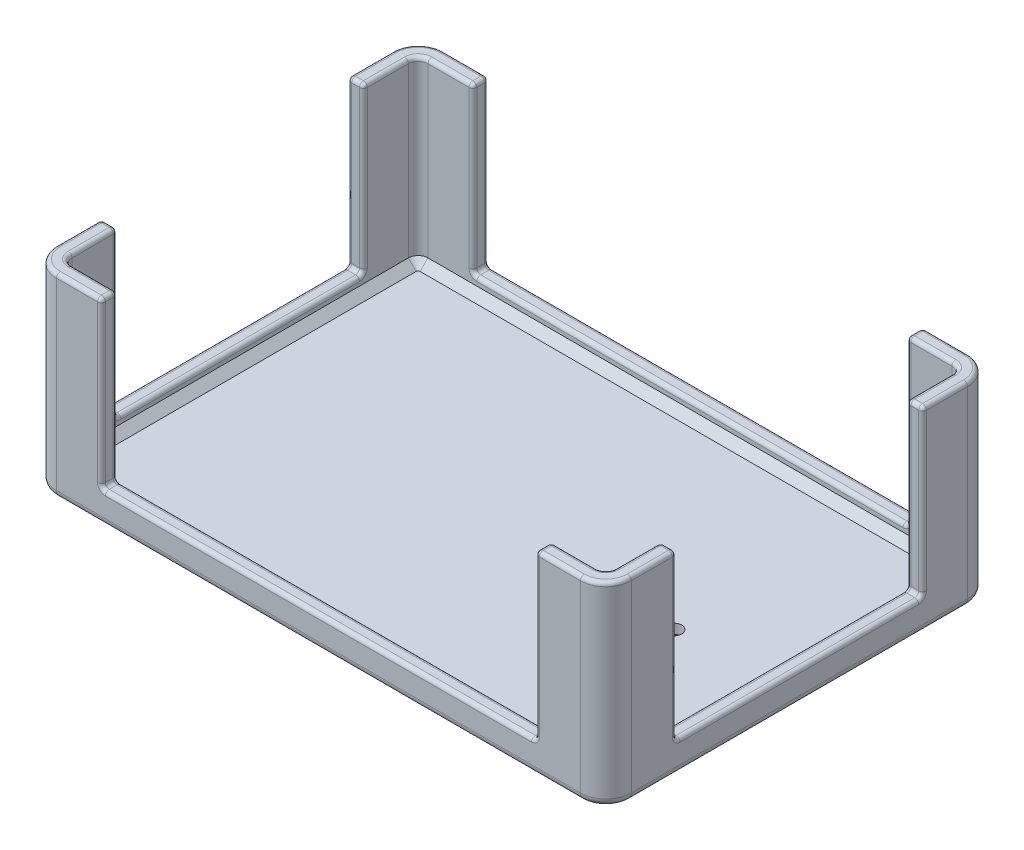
ISO-10303-21;
HEADER;
FILE_DESCRIPTION(('STEP AP214'),'2;1');
FILE_NAME('part.step','',(''),(''),'','','');
FILE_SCHEMA(('AUTOMOTIVE_DESIGN { 1 0 10303 214 1 1 1 1 }'));
ENDSEC;
DATA;
#1=APPLICATION_CONTEXT('core data for automotive mechanical design processes');
#2=APPLICATION_PROTOCOL_DEFINITION('international standard','automotive_design',2000,#1);
#3=PRODUCT_CONTEXT('',#1,'mechanical');
#4=PRODUCT('Part','Part','',(#3));
#5=PRODUCT_RELATED_PRODUCT_CATEGORY('part','',(#4));
#6=PRODUCT_DEFINITION_FORMATION('','',#4);
#7=PRODUCT_DEFINITION_CONTEXT('part definition',#1,'design');
#8=PRODUCT_DEFINITION('design','',#6,#7);
#9=PRODUCT_DEFINITION_SHAPE('','',#8);
#10=(LENGTH_UNIT() NAMED_UNIT(*) SI_UNIT(.MILLI.,.METRE.));
#11=(NAMED_UNIT(*) PLANE_ANGLE_UNIT() SI_UNIT($,.RADIAN.));
#12=(NAMED_UNIT(*) SI_UNIT($,.STERADIAN.) SOLID_ANGLE_UNIT());
#13=UNCERTAINTY_MEASURE_WITH_UNIT(LENGTH_MEASURE(1.E-05),#10,'distance_accuracy_value','');
#14=(GEOMETRIC_REPRESENTATION_CONTEXT(3) GLOBAL_UNCERTAINTY_ASSIGNED_CONTEXT((#13)) GLOBAL_UNIT_ASSIGNED_CONTEXT((#10,
#11,#12)) REPRESENTATION_CONTEXT('',''));
#15=CARTESIAN_POINT('',(0.,0.,0.));
#16=DIRECTION('',(0.,0.,1.));
#17=DIRECTION('',(1.,0.,0.));
#18=AXIS2_PLACEMENT_3D('',#15,#16,#17);
#19=CARTESIAN_POINT('',(6.5,50.,-6.5));
#20=DIRECTION('',(0.,1.,0.));
#21=DIRECTION('',(0.,0.,1.));
#22=AXIS2_PLACEMENT_3D('',#19,#20,#21);
#23=PLANE('',#22);
#24=CARTESIAN_POINT('',(6.5,50.,-92.5));
#25=DIRECTION('',(0.,1.,0.));
#26=DIRECTION('',(0.,0.,1.));
#27=AXIS2_PLACEMENT_3D('',#24,#25,#26);
#28=CIRCLE('',#27,3.5);
#29=CARTESIAN_POINT('',(3.,50.,-92.5));
#30=VERTEX_POINT('',#29);
#31=CARTESIAN_POINT('',(6.5,50.,-96.));
#32=VERTEX_POINT('',#31);
#33=EDGE_CURVE('E939',#30,#32,#28,.F.);
#34=ORIENTED_EDGE('',*,*,#33,.T.);
#35=DIRECTION('',(-1.,0.,0.));
#36=VECTOR('',#35,1.);
#37=CARTESIAN_POINT('',(6.5,50.,-96.));
#38=LINE('',#37,#36);
#39=CARTESIAN_POINT('',(17.,50.,-96.));
#40=VERTEX_POINT('',#39);
#41=EDGE_CURVE('E941',#32,#40,#38,.F.);
#42=ORIENTED_EDGE('',*,*,#41,.T.);
#43=DIRECTION('',(0.,0.,1.));
#44=VECTOR('',#43,1.);
#45=CARTESIAN_POINT('',(17.,50.,-99.));
#46=LINE('',#45,#44);
#47=CARTESIAN_POINT('',(17.,50.,-98.));
#48=VERTEX_POINT('',#47);
#49=EDGE_CURVE('E927',#40,#48,#46,.F.);
#50=ORIENTED_EDGE('',*,*,#49,.T.);
#51=DIRECTION('',(-1.,0.,0.));
#52=VECTOR('',#51,1.);
#53=CARTESIAN_POINT('',(6.5,50.,-98.));
#54=LINE('',#53,#52);
#55=CARTESIAN_POINT('',(6.5,50.,-98.));
#56=VERTEX_POINT('',#55);
#57=EDGE_CURVE('E929',#48,#56,#54,.T.);
#58=ORIENTED_EDGE('',*,*,#57,.T.);
#59=CARTESIAN_POINT('',(6.5,50.,-92.5));
#60=DIRECTION('',(0.,1.,0.));
#61=DIRECTION('',(0.,0.,1.));
#62=AXIS2_PLACEMENT_3D('',#59,#60,#61);
#63=CIRCLE('',#62,5.5);
#64=CARTESIAN_POINT('',(0.999999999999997,50.,-92.5));
#65=VERTEX_POINT('',#64);
#66=EDGE_CURVE('E931',#56,#65,#63,.T.);
#67=ORIENTED_EDGE('',*,*,#66,.T.);
#68=DIRECTION('',(0.,0.,1.));
#69=VECTOR('',#68,1.);
#70=CARTESIAN_POINT('',(1.,50.,-81.));
#71=LINE('',#70,#69);
#72=CARTESIAN_POINT('',(1.,50.,-82.));
#73=VERTEX_POINT('',#72);
#74=EDGE_CURVE('E933',#65,#73,#71,.T.);
#75=ORIENTED_EDGE('',*,*,#74,.T.);
#76=DIRECTION('',(-1.,0.,0.));
#77=VECTOR('',#76,1.);
#78=CARTESIAN_POINT('',(4.,50.,-82.));
#79=LINE('',#78,#77);
#80=CARTESIAN_POINT('',(3.,50.,-82.));
#81=VERTEX_POINT('',#80);
#82=EDGE_CURVE('E935',#73,#81,#79,.F.);
#83=ORIENTED_EDGE('',*,*,#82,.T.);
#84=DIRECTION('',(0.,0.,1.));
#85=VECTOR('',#84,1.);
#86=CARTESIAN_POINT('',(3.,50.,-6.5));
#87=LINE('',#86,#85);
#88=EDGE_CURVE('E937',#81,#30,#87,.F.);
#89=ORIENTED_EDGE('',*,*,#88,.T.);
#90=EDGE_LOOP('',(#34,#42,#50,#58,#67,#75,#83,#89));
#91=FACE_BOUND('',#90,.T.);
#92=ADVANCED_FACE('F34',(#91),#23,.T.);
#93=CARTESIAN_POINT('',(6.5,50.,-6.5));
#94=DIRECTION('',(0.,1.,0.));
#95=DIRECTION('',(0.,0.,1.));
#96=AXIS2_PLACEMENT_3D('',#93,#94,#95);
#97=CIRCLE('',#96,5.5);
#98=CARTESIAN_POINT('',(1.,50.,-6.50000000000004));
#99=VERTEX_POINT('',#98);
#100=CARTESIAN_POINT('',(6.50000000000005,50.,-0.999999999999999));
#101=VERTEX_POINT('',#100);
#102=EDGE_CURVE('E681',#99,#101,#97,.T.);
#103=ORIENTED_EDGE('',*,*,#102,.T.);
#104=DIRECTION('',(1.,0.,0.));
#105=VECTOR('',#104,1.);
#106=CARTESIAN_POINT('',(18.,50.,-1.));
#107=LINE('',#106,#105);
#108=CARTESIAN_POINT('',(17.,50.,-1.));
#109=VERTEX_POINT('',#108);
#110=EDGE_CURVE('E683',#101,#109,#107,.T.);
#111=ORIENTED_EDGE('',*,*,#110,.T.);
#112=DIRECTION('',(0.,0.,1.));
#113=VECTOR('',#112,1.);
#114=CARTESIAN_POINT('',(17.,50.,-4.));
#115=LINE('',#114,#113);
#116=CARTESIAN_POINT('',(17.,50.,-3.));
#117=VERTEX_POINT('',#116);
#118=EDGE_CURVE('E669',#109,#117,#115,.F.);
#119=ORIENTED_EDGE('',*,*,#118,.T.);
#120=DIRECTION('',(1.,0.,0.));
#121=VECTOR('',#120,1.);
#122=CARTESIAN_POINT('',(6.5,50.,-3.));
#123=LINE('',#122,#121);
#124=CARTESIAN_POINT('',(6.50000000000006,50.,-3.));
#125=VERTEX_POINT('',#124);
#126=EDGE_CURVE('E671',#117,#125,#123,.F.);
#127=ORIENTED_EDGE('',*,*,#126,.T.);
#128=CARTESIAN_POINT('',(6.5,50.,-6.5));
#129=DIRECTION('',(0.,1.,0.));
#130=DIRECTION('',(0.,0.,1.));
#131=AXIS2_PLACEMENT_3D('',#128,#129,#130);
#132=CIRCLE('',#131,3.5);
#133=CARTESIAN_POINT('',(3.,50.,-6.50000000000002));
#134=VERTEX_POINT('',#133);
#135=EDGE_CURVE('E673',#125,#134,#132,.F.);
#136=ORIENTED_EDGE('',*,*,#135,.T.);
#137=DIRECTION('',(0.,0.,1.));
#138=VECTOR('',#137,1.);
#139=CARTESIAN_POINT('',(3.,50.,-6.5));
#140=LINE('',#139,#138);
#141=CARTESIAN_POINT('',(3.,50.,-17.));
#142=VERTEX_POINT('',#141);
#143=EDGE_CURVE('E675',#134,#142,#140,.F.);
#144=ORIENTED_EDGE('',*,*,#143,.T.);
#145=DIRECTION('',(-1.,0.,0.));
#146=VECTOR('',#145,1.);
#147=CARTESIAN_POINT('',(0.,50.,-17.));
#148=LINE('',#147,#146);
#149=CARTESIAN_POINT('',(1.,50.,-17.));
#150=VERTEX_POINT('',#149);
#151=EDGE_CURVE('E677',#142,#150,#148,.T.);
#152=ORIENTED_EDGE('',*,*,#151,.T.);
#153=DIRECTION('',(0.,0.,1.));
#154=VECTOR('',#153,1.);
#155=CARTESIAN_POINT('',(1.,50.,-6.50000000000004));
#156=LINE('',#155,#154);
#157=EDGE_CURVE('E679',#150,#99,#156,.T.);
#158=ORIENTED_EDGE('',*,*,#157,.T.);
#159=EDGE_LOOP('',(#103,#111,#119,#127,#136,#144,#152,#158));
#160=FACE_BOUND('',#159,.T.);
#161=ADVANCED_FACE('F1344',(#160),#23,.T.);
#162=DIRECTION('',(-1.,0.,0.));
#163=VECTOR('',#162,1.);
#164=CARTESIAN_POINT('',(6.5,50.,-96.));
#165=LINE('',#164,#163);
#166=CARTESIAN_POINT('',(130.,50.,-96.));
#167=VERTEX_POINT('',#166);
#168=CARTESIAN_POINT('',(140.5,50.,-96.));
#169=VERTEX_POINT('',#168);
#170=EDGE_CURVE('E901',#167,#169,#165,.F.);
#171=ORIENTED_EDGE('',*,*,#170,.T.);
#172=CARTESIAN_POINT('',(140.5,50.,-92.5));
#173=DIRECTION('',(0.,1.,0.));
#174=DIRECTION('',(0.,0.,1.));
#175=AXIS2_PLACEMENT_3D('',#172,#173,#174);
#176=CIRCLE('',#175,3.50000000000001);
#177=CARTESIAN_POINT('',(144.,50.,-92.5));
#178=VERTEX_POINT('',#177);
#179=EDGE_CURVE('E903',#169,#178,#176,.F.);
#180=ORIENTED_EDGE('',*,*,#179,.T.);
#181=DIRECTION('',(0.,0.,-1.));
#182=VECTOR('',#181,1.);
#183=CARTESIAN_POINT('',(144.,50.,-6.50000000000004));
#184=LINE('',#183,#182);
#185=CARTESIAN_POINT('',(144.,50.,-82.));
#186=VERTEX_POINT('',#185);
#187=EDGE_CURVE('E890',#178,#186,#184,.F.);
#188=ORIENTED_EDGE('',*,*,#187,.T.);
#189=DIRECTION('',(-1.,0.,0.));
#190=VECTOR('',#189,1.);
#191=CARTESIAN_POINT('',(147.,50.,-82.));
#192=LINE('',#191,#190);
#193=CARTESIAN_POINT('',(146.,50.,-82.));
#194=VERTEX_POINT('',#193);
#195=EDGE_CURVE('E888',#186,#194,#192,.F.);
#196=ORIENTED_EDGE('',*,*,#195,.T.);
#197=DIRECTION('',(0.,0.,-1.));
#198=VECTOR('',#197,1.);
#199=CARTESIAN_POINT('',(146.,50.,-92.5));
#200=LINE('',#199,#198);
#201=CARTESIAN_POINT('',(146.,50.,-92.5));
#202=VERTEX_POINT('',#201);
#203=EDGE_CURVE('E892',#194,#202,#200,.T.);
#204=ORIENTED_EDGE('',*,*,#203,.T.);
#205=CARTESIAN_POINT('',(140.5,50.,-92.5));
#206=DIRECTION('',(0.,1.,0.));
#207=DIRECTION('',(0.,0.,1.));
#208=AXIS2_PLACEMENT_3D('',#205,#206,#207);
#209=CIRCLE('',#208,5.50000000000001);
#210=CARTESIAN_POINT('',(140.5,50.,-98.));
#211=VERTEX_POINT('',#210);
#212=EDGE_CURVE('E894',#202,#211,#209,.T.);
#213=ORIENTED_EDGE('',*,*,#212,.T.);
#214=DIRECTION('',(-1.,0.,0.));
#215=VECTOR('',#214,1.);
#216=CARTESIAN_POINT('',(129.,50.,-98.));
#217=LINE('',#216,#215);
#218=CARTESIAN_POINT('',(130.,50.,-98.));
#219=VERTEX_POINT('',#218);
#220=EDGE_CURVE('E896',#211,#219,#217,.T.);
#221=ORIENTED_EDGE('',*,*,#220,.T.);
#222=DIRECTION('',(0.,0.,1.));
#223=VECTOR('',#222,1.);
#224=CARTESIAN_POINT('',(130.,50.,-95.));
#225=LINE('',#224,#223);
#226=EDGE_CURVE('E899',#219,#167,#225,.T.);
#227=ORIENTED_EDGE('',*,*,#226,.T.);
#228=EDGE_LOOP('',(#171,#180,#188,#196,#204,#213,#221,#227));
#229=FACE_BOUND('',#228,.T.);
#230=ADVANCED_FACE('F1351',(#229),#23,.T.);
#231=CARTESIAN_POINT('',(6.5,50.,-6.5));
#232=DIRECTION('',(0.,-1.,0.));
#233=DIRECTION('',(0.,0.,-1.));
#234=AXIS2_PLACEMENT_3D('',#231,#232,#233);
#235=CYLINDRICAL_SURFACE('',#234,6.5);
#236=DIRECTION('',(0.,-1.,0.));
#237=VECTOR('',#236,1.);
#238=CARTESIAN_POINT('',(0.,50.,-6.50000000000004));
#239=LINE('',#238,#237);
#240=CARTESIAN_POINT('',(0.,49.,-6.50000000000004));
#241=VERTEX_POINT('',#240);
#242=CARTESIAN_POINT('',(0.,2.,-6.50000000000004));
#243=VERTEX_POINT('',#242);
#244=EDGE_CURVE('E1410',#241,#243,#239,.T.);
#245=ORIENTED_EDGE('',*,*,#244,.T.);
#246=CARTESIAN_POINT('',(6.5,2.,-6.5));
#247=DIRECTION('',(0.,1.,0.));
#248=DIRECTION('',(0.,0.,1.));
#249=AXIS2_PLACEMENT_3D('',#246,#247,#248);
#250=CIRCLE('',#249,6.5);
#251=CARTESIAN_POINT('',(6.50000000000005,2.,0.));
#252=VERTEX_POINT('',#251);
#253=EDGE_CURVE('E1304',#243,#252,#250,.T.);
#254=ORIENTED_EDGE('',*,*,#253,.T.);
#255=DIRECTION('',(0.,-1.,0.));
#256=VECTOR('',#255,1.);
#257=CARTESIAN_POINT('',(6.50000000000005,50.,0.));
#258=LINE('',#257,#256);
#259=CARTESIAN_POINT('',(6.50000000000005,49.,0.));
#260=VERTEX_POINT('',#259);
#261=EDGE_CURVE('E605',#260,#252,#258,.T.);
#262=ORIENTED_EDGE('',*,*,#261,.F.);
#263=CARTESIAN_POINT('',(6.5,49.,-6.5));
#264=DIRECTION('',(0.,1.,0.));
#265=DIRECTION('',(0.,0.,1.));
#266=AXIS2_PLACEMENT_3D('',#263,#264,#265);
#267=CIRCLE('',#266,6.5);
#268=EDGE_CURVE('E702',#260,#241,#267,.F.);
#269=ORIENTED_EDGE('',*,*,#268,.T.);
#270=EDGE_LOOP('',(#245,#254,#262,#269));
#271=FACE_BOUND('',#270,.T.);
#272=ADVANCED_FACE('F1366',(#271),#235,.T.);
#273=CARTESIAN_POINT('',(6.50000000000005,50.,0.));
#274=DIRECTION('',(0.,0.,-1.));
#275=DIRECTION('',(-1.,0.,0.));
#276=AXIS2_PLACEMENT_3D('',#273,#274,#275);
#277=PLANE('',#276);
#278=ORIENTED_EDGE('',*,*,#261,.T.);
#279=DIRECTION('',(1.,0.,0.));
#280=VECTOR('',#279,1.);
#281=CARTESIAN_POINT('',(6.50000000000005,2.,0.));
#282=LINE('',#281,#280);
#283=CARTESIAN_POINT('',(140.5,2.,0.));
#284=VERTEX_POINT('',#283);
#285=EDGE_CURVE('E948',#252,#284,#282,.T.);
#286=ORIENTED_EDGE('',*,*,#285,.T.);
#287=DIRECTION('',(0.,-1.,0.));
#288=VECTOR('',#287,1.);
#289=CARTESIAN_POINT('',(140.5,50.,0.));
#290=LINE('',#289,#288);
#291=CARTESIAN_POINT('',(140.5,49.,0.));
#292=VERTEX_POINT('',#291);
#293=EDGE_CURVE('E1426',#292,#284,#290,.T.);
#294=ORIENTED_EDGE('',*,*,#293,.F.);
#295=DIRECTION('',(1.,0.,0.));
#296=VECTOR('',#295,1.);
#297=CARTESIAN_POINT('',(129.,49.,0.));
#298=LINE('',#297,#296);
#299=CARTESIAN_POINT('',(130.,49.,0.));
#300=VERTEX_POINT('',#299);
#301=EDGE_CURVE('E700',#292,#300,#298,.F.);
#302=ORIENTED_EDGE('',*,*,#301,.T.);
#303=DIRECTION('',(0.,1.,0.));
#304=VECTOR('',#303,1.);
#305=CARTESIAN_POINT('',(130.,50.,0.));
#306=LINE('',#305,#304);
#307=CARTESIAN_POINT('',(130.,9.00000000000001,0.));
#308=VERTEX_POINT('',#307);
#309=EDGE_CURVE('E696',#300,#308,#306,.F.);
#310=ORIENTED_EDGE('',*,*,#309,.T.);
#311=CARTESIAN_POINT('',(128.,9.00000000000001,0.));
#312=DIRECTION('',(0.,0.,-1.));
#313=DIRECTION('',(-1.,0.,0.));
#314=AXIS2_PLACEMENT_3D('',#311,#312,#313);
#315=CIRCLE('',#314,2.);
#316=CARTESIAN_POINT('',(128.,7.,0.));
#317=VERTEX_POINT('',#316);
#318=EDGE_CURVE('E693',#317,#308,#315,.F.);
#319=ORIENTED_EDGE('',*,*,#318,.F.);
#320=DIRECTION('',(1.,0.,0.));
#321=VECTOR('',#320,1.);
#322=CARTESIAN_POINT('',(6.50000000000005,7.00000000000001,0.));
#323=LINE('',#322,#321);
#324=CARTESIAN_POINT('',(19.,7.,0.));
#325=VERTEX_POINT('',#324);
#326=EDGE_CURVE('E691',#317,#325,#323,.F.);
#327=ORIENTED_EDGE('',*,*,#326,.T.);
#328=CARTESIAN_POINT('',(19.,9.00000000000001,0.));
#329=DIRECTION('',(0.,0.,-1.));
#330=DIRECTION('',(-1.,0.,0.));
#331=AXIS2_PLACEMENT_3D('',#328,#329,#330);
#332=CIRCLE('',#331,2.);
#333=CARTESIAN_POINT('',(17.,9.00000000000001,0.));
#334=VERTEX_POINT('',#333);
#335=EDGE_CURVE('E688',#334,#325,#332,.F.);
#336=ORIENTED_EDGE('',*,*,#335,.F.);
#337=DIRECTION('',(0.,-1.,0.));
#338=VECTOR('',#337,1.);
#339=CARTESIAN_POINT('',(17.,50.,0.));
#340=LINE('',#339,#338);
#341=CARTESIAN_POINT('',(17.,49.,0.));
#342=VERTEX_POINT('',#341);
#343=EDGE_CURVE('E686',#334,#342,#340,.F.);
#344=ORIENTED_EDGE('',*,*,#343,.T.);
#345=DIRECTION('',(1.,0.,0.));
#346=VECTOR('',#345,1.);
#347=CARTESIAN_POINT('',(6.50000000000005,49.,0.));
#348=LINE('',#347,#346);
#349=EDGE_CURVE('E698',#342,#260,#348,.F.);
#350=ORIENTED_EDGE('',*,*,#349,.T.);
#351=EDGE_LOOP('',(#278,#286,#294,#302,#310,#319,#327,#336,#344,#350));
#352=FACE_BOUND('',#351,.T.);
#353=ADVANCED_FACE('F1371',(#352),#277,.F.);
#354=CARTESIAN_POINT('',(140.5,50.,-6.5));
#355=DIRECTION('',(0.,-1.,0.));
#356=DIRECTION('',(0.,0.,-1.));
#357=AXIS2_PLACEMENT_3D('',#354,#355,#356);
#358=CYLINDRICAL_SURFACE('',#357,6.5);
#359=ORIENTED_EDGE('',*,*,#293,.T.);
#360=CARTESIAN_POINT('',(140.5,2.,-6.5));
#361=DIRECTION('',(0.,1.,0.));
#362=DIRECTION('',(0.,0.,1.));
#363=AXIS2_PLACEMENT_3D('',#360,#361,#362);
#364=CIRCLE('',#363,6.5);
#365=CARTESIAN_POINT('',(147.,2.,-6.5));
#366=VERTEX_POINT('',#365);
#367=EDGE_CURVE('E1294',#284,#366,#364,.T.);
#368=ORIENTED_EDGE('',*,*,#367,.T.);
#369=DIRECTION('',(0.,-1.,0.));
#370=VECTOR('',#369,1.);
#371=CARTESIAN_POINT('',(147.,50.,-6.5));
#372=LINE('',#371,#370);
#373=CARTESIAN_POINT('',(147.,49.,-6.5));
#374=VERTEX_POINT('',#373);
#375=EDGE_CURVE('E1423',#374,#366,#372,.T.);
#376=ORIENTED_EDGE('',*,*,#375,.F.);
#377=CARTESIAN_POINT('',(140.5,49.,-6.5));
#378=DIRECTION('',(0.,1.,0.));
#379=DIRECTION('',(0.,0.,1.));
#380=AXIS2_PLACEMENT_3D('',#377,#378,#379);
#381=CIRCLE('',#380,6.5);
#382=EDGE_CURVE('E859',#374,#292,#381,.F.);
#383=ORIENTED_EDGE('',*,*,#382,.T.);
#384=EDGE_LOOP('',(#359,#368,#376,#383));
#385=FACE_BOUND('',#384,.T.);
#386=ADVANCED_FACE('F2442',(#385),#358,.T.);
#387=CARTESIAN_POINT('',(147.,50.,-6.5));
#388=DIRECTION('',(-1.,0.,0.));
#389=DIRECTION('',(0.,0.,1.));
#390=AXIS2_PLACEMENT_3D('',#387,#388,#389);
#391=PLANE('',#390);
#392=ORIENTED_EDGE('',*,*,#375,.T.);
#393=DIRECTION('',(0.,0.,-1.));
#394=VECTOR('',#393,1.);
#395=CARTESIAN_POINT('',(147.,2.,-6.5));
#396=LINE('',#395,#394);
#397=CARTESIAN_POINT('',(147.,2.,-92.5));
#398=VERTEX_POINT('',#397);
#399=EDGE_CURVE('E1296',#366,#398,#396,.T.);
#400=ORIENTED_EDGE('',*,*,#399,.T.);
#401=DIRECTION('',(0.,-1.,0.));
#402=VECTOR('',#401,1.);
#403=CARTESIAN_POINT('',(147.,50.,-92.5));
#404=LINE('',#403,#402);
#405=CARTESIAN_POINT('',(147.,49.,-92.5));
#406=VERTEX_POINT('',#405);
#407=EDGE_CURVE('E1420',#406,#398,#404,.T.);
#408=ORIENTED_EDGE('',*,*,#407,.F.);
#409=DIRECTION('',(0.,0.,-1.));
#410=VECTOR('',#409,1.);
#411=CARTESIAN_POINT('',(147.,49.,-81.));
#412=LINE('',#411,#410);
#413=CARTESIAN_POINT('',(147.,49.,-82.));
#414=VERTEX_POINT('',#413);
#415=EDGE_CURVE('E857',#406,#414,#412,.F.);
#416=ORIENTED_EDGE('',*,*,#415,.T.);
#417=DIRECTION('',(0.,-1.,0.));
#418=VECTOR('',#417,1.);
#419=CARTESIAN_POINT('',(147.,50.,-82.));
#420=LINE('',#419,#418);
#421=CARTESIAN_POINT('',(147.,9.,-82.));
#422=VERTEX_POINT('',#421);
#423=EDGE_CURVE('E855',#414,#422,#420,.T.);
#424=ORIENTED_EDGE('',*,*,#423,.T.);
#425=CARTESIAN_POINT('',(147.,9.,-80.));
#426=DIRECTION('',(-1.,0.,0.));
#427=DIRECTION('',(0.,0.,1.));
#428=AXIS2_PLACEMENT_3D('',#425,#426,#427);
#429=CIRCLE('',#428,2.);
#430=CARTESIAN_POINT('',(147.,7.,-80.));
#431=VERTEX_POINT('',#430);
#432=EDGE_CURVE('E852',#431,#422,#429,.F.);
#433=ORIENTED_EDGE('',*,*,#432,.F.);
#434=DIRECTION('',(0.,0.,1.));
#435=VECTOR('',#434,1.);
#436=CARTESIAN_POINT('',(147.,7.,-6.5));
#437=LINE('',#436,#435);
#438=CARTESIAN_POINT('',(147.,7.,-19.));
#439=VERTEX_POINT('',#438);
#440=EDGE_CURVE('E848',#431,#439,#437,.T.);
#441=ORIENTED_EDGE('',*,*,#440,.T.);
#442=CARTESIAN_POINT('',(147.,9.,-19.));
#443=DIRECTION('',(-1.,0.,0.));
#444=DIRECTION('',(0.,0.,1.));
#445=AXIS2_PLACEMENT_3D('',#442,#443,#444);
#446=CIRCLE('',#445,2.);
#447=CARTESIAN_POINT('',(147.,9.,-17.));
#448=VERTEX_POINT('',#447);
#449=EDGE_CURVE('E845',#448,#439,#446,.F.);
#450=ORIENTED_EDGE('',*,*,#449,.F.);
#451=DIRECTION('',(0.,1.,0.));
#452=VECTOR('',#451,1.);
#453=CARTESIAN_POINT('',(147.,50.,-17.));
#454=LINE('',#453,#452);
#455=CARTESIAN_POINT('',(147.,49.,-17.));
#456=VERTEX_POINT('',#455);
#457=EDGE_CURVE('E843',#448,#456,#454,.T.);
#458=ORIENTED_EDGE('',*,*,#457,.T.);
#459=DIRECTION('',(0.,0.,-1.));
#460=VECTOR('',#459,1.);
#461=CARTESIAN_POINT('',(147.,49.,-6.5));
#462=LINE('',#461,#460);
#463=EDGE_CURVE('E850',#456,#374,#462,.F.);
#464=ORIENTED_EDGE('',*,*,#463,.T.);
#465=EDGE_LOOP('',(#392,#400,#408,#416,#424,#433,#441,#450,#458,#464));
#466=FACE_BOUND('',#465,.T.);
#467=ADVANCED_FACE('F2451',(#466),#391,.F.);
#468=CARTESIAN_POINT('',(140.5,50.,-92.5));
#469=DIRECTION('',(0.,-1.,0.));
#470=DIRECTION('',(0.,0.,-1.));
#471=AXIS2_PLACEMENT_3D('',#468,#469,#470);
#472=CYLINDRICAL_SURFACE('',#471,6.50000000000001);
#473=ORIENTED_EDGE('',*,*,#407,.T.);
#474=CARTESIAN_POINT('',(140.5,2.,-92.5));
#475=DIRECTION('',(0.,1.,0.));
#476=DIRECTION('',(0.,0.,1.));
#477=AXIS2_PLACEMENT_3D('',#474,#475,#476);
#478=CIRCLE('',#477,6.50000000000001);
#479=CARTESIAN_POINT('',(140.5,2.,-99.));
#480=VERTEX_POINT('',#479);
#481=EDGE_CURVE('E1298',#398,#480,#478,.T.);
#482=ORIENTED_EDGE('',*,*,#481,.T.);
#483=DIRECTION('',(0.,-1.,0.));
#484=VECTOR('',#483,1.);
#485=CARTESIAN_POINT('',(140.5,50.,-99.));
#486=LINE('',#485,#484);
#487=CARTESIAN_POINT('',(140.5,49.,-99.));
#488=VERTEX_POINT('',#487);
#489=EDGE_CURVE('E1417',#488,#480,#486,.T.);
#490=ORIENTED_EDGE('',*,*,#489,.F.);
#491=CARTESIAN_POINT('',(140.5,49.,-92.5));
#492=DIRECTION('',(0.,1.,0.));
#493=DIRECTION('',(0.,0.,1.));
#494=AXIS2_PLACEMENT_3D('',#491,#492,#493);
#495=CIRCLE('',#494,6.50000000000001);
#496=EDGE_CURVE('E905',#488,#406,#495,.F.);
#497=ORIENTED_EDGE('',*,*,#496,.T.);
#498=EDGE_LOOP('',(#473,#482,#490,#497));
#499=FACE_BOUND('',#498,.T.);
#500=ADVANCED_FACE('F2461',(#499),#472,.T.);
#501=CARTESIAN_POINT('',(6.5,50.,-99.));
#502=DIRECTION('',(0.,0.,1.));
#503=DIRECTION('',(1.,0.,0.));
#504=AXIS2_PLACEMENT_3D('',#501,#502,#503);
#505=PLANE('',#504);
#506=ORIENTED_EDGE('',*,*,#489,.T.);
#507=DIRECTION('',(-1.,0.,0.));
#508=VECTOR('',#507,1.);
#509=CARTESIAN_POINT('',(6.5,2.,-99.));
#510=LINE('',#509,#508);
#511=CARTESIAN_POINT('',(6.5,2.,-99.));
#512=VERTEX_POINT('',#511);
#513=EDGE_CURVE('E1300',#480,#512,#510,.T.);
#514=ORIENTED_EDGE('',*,*,#513,.T.);
#515=DIRECTION('',(0.,-1.,0.));
#516=VECTOR('',#515,1.);
#517=CARTESIAN_POINT('',(6.5,50.,-99.));
#518=LINE('',#517,#516);
#519=CARTESIAN_POINT('',(6.5,49.,-99.));
#520=VERTEX_POINT('',#519);
#521=EDGE_CURVE('E1415',#520,#512,#518,.T.);
#522=ORIENTED_EDGE('',*,*,#521,.F.);
#523=DIRECTION('',(-1.,0.,0.));
#524=VECTOR('',#523,1.);
#525=CARTESIAN_POINT('',(18.,49.,-99.));
#526=LINE('',#525,#524);
#527=CARTESIAN_POINT('',(17.,49.,-99.));
#528=VERTEX_POINT('',#527);
#529=EDGE_CURVE('E625',#520,#528,#526,.F.);
#530=ORIENTED_EDGE('',*,*,#529,.T.);
#531=DIRECTION('',(0.,-1.,0.));
#532=VECTOR('',#531,1.);
#533=CARTESIAN_POINT('',(17.,50.,-99.));
#534=LINE('',#533,#532);
#535=CARTESIAN_POINT('',(17.,9.00000000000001,-99.));
#536=VERTEX_POINT('',#535);
#537=EDGE_CURVE('E627',#528,#536,#534,.T.);
#538=ORIENTED_EDGE('',*,*,#537,.T.);
#539=CARTESIAN_POINT('',(19.,9.00000000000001,-99.));
#540=DIRECTION('',(0.,0.,1.));
#541=DIRECTION('',(1.,0.,0.));
#542=AXIS2_PLACEMENT_3D('',#539,#540,#541);
#543=CIRCLE('',#542,2.);
#544=CARTESIAN_POINT('',(19.,7.00000000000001,-99.));
#545=VERTEX_POINT('',#544);
#546=EDGE_CURVE('E631',#545,#536,#543,.F.);
#547=ORIENTED_EDGE('',*,*,#546,.F.);
#548=DIRECTION('',(1.,0.,0.));
#549=VECTOR('',#548,1.);
#550=CARTESIAN_POINT('',(6.5,7.00000000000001,-99.));
#551=LINE('',#550,#549);
#552=CARTESIAN_POINT('',(128.,7.00000000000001,-99.));
#553=VERTEX_POINT('',#552);
#554=EDGE_CURVE('E634',#545,#553,#551,.T.);
#555=ORIENTED_EDGE('',*,*,#554,.T.);
#556=CARTESIAN_POINT('',(128.,9.00000000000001,-99.));
#557=DIRECTION('',(0.,0.,1.));
#558=DIRECTION('',(1.,0.,0.));
#559=AXIS2_PLACEMENT_3D('',#556,#557,#558);
#560=CIRCLE('',#559,2.);
#561=CARTESIAN_POINT('',(130.,9.00000000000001,-99.));
#562=VERTEX_POINT('',#561);
#563=EDGE_CURVE('E636',#562,#553,#560,.F.);
#564=ORIENTED_EDGE('',*,*,#563,.F.);
#565=DIRECTION('',(0.,1.,0.));
#566=VECTOR('',#565,1.);
#567=CARTESIAN_POINT('',(130.,50.,-99.));
#568=LINE('',#567,#566);
#569=CARTESIAN_POINT('',(130.,49.,-99.));
#570=VERTEX_POINT('',#569);
#571=EDGE_CURVE('E639',#562,#570,#568,.T.);
#572=ORIENTED_EDGE('',*,*,#571,.T.);
#573=DIRECTION('',(-1.,0.,0.));
#574=VECTOR('',#573,1.);
#575=CARTESIAN_POINT('',(140.5,49.,-99.));
#576=LINE('',#575,#574);
#577=EDGE_CURVE('E641',#570,#488,#576,.F.);
#578=ORIENTED_EDGE('',*,*,#577,.T.);
#579=EDGE_LOOP('',(#506,#514,#522,#530,#538,#547,#555,#564,#572,#578));
#580=FACE_BOUND('',#579,.T.);
#581=ADVANCED_FACE('F2471',(#580),#505,.F.);
#582=CARTESIAN_POINT('',(6.5,50.,-92.5));
#583=DIRECTION('',(0.,-1.,0.));
#584=DIRECTION('',(0.,0.,-1.));
#585=AXIS2_PLACEMENT_3D('',#582,#583,#584);
#586=CYLINDRICAL_SURFACE('',#585,6.5);
#587=ORIENTED_EDGE('',*,*,#521,.T.);
#588=CARTESIAN_POINT('',(6.5,2.,-92.5));
#589=DIRECTION('',(0.,1.,0.));
#590=DIRECTION('',(0.,0.,1.));
#591=AXIS2_PLACEMENT_3D('',#588,#589,#590);
#592=CIRCLE('',#591,6.5);
#593=CARTESIAN_POINT('',(0.,2.,-92.5));
#594=VERTEX_POINT('',#593);
#595=EDGE_CURVE('E57',#512,#594,#592,.T.);
#596=ORIENTED_EDGE('',*,*,#595,.T.);
#597=DIRECTION('',(0.,-1.,0.));
#598=VECTOR('',#597,1.);
#599=CARTESIAN_POINT('',(0.,50.,-92.5));
#600=LINE('',#599,#598);
#601=CARTESIAN_POINT('',(0.,49.,-92.5));
#602=VERTEX_POINT('',#601);
#603=EDGE_CURVE('E1412',#602,#594,#600,.T.);
#604=ORIENTED_EDGE('',*,*,#603,.F.);
#605=CARTESIAN_POINT('',(6.5,49.,-92.5));
#606=DIRECTION('',(0.,1.,0.));
#607=DIRECTION('',(0.,0.,1.));
#608=AXIS2_PLACEMENT_3D('',#605,#606,#607);
#609=CIRCLE('',#608,6.5);
#610=EDGE_CURVE('E946',#602,#520,#609,.F.);
#611=ORIENTED_EDGE('',*,*,#610,.T.);
#612=EDGE_LOOP('',(#587,#596,#604,#611));
#613=FACE_BOUND('',#612,.T.);
#614=ADVANCED_FACE('F1363',(#613),#586,.T.);
#615=CARTESIAN_POINT('',(0.,50.,-6.50000000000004));
#616=DIRECTION('',(1.,0.,0.));
#617=DIRECTION('',(0.,0.,-1.));
#618=AXIS2_PLACEMENT_3D('',#615,#616,#617);
#619=PLANE('',#618);
#620=ORIENTED_EDGE('',*,*,#603,.T.);
#621=DIRECTION('',(0.,0.,1.));
#622=VECTOR('',#621,1.);
#623=CARTESIAN_POINT('',(0.,2.,-6.50000000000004));
#624=LINE('',#623,#622);
#625=EDGE_CURVE('E49',#594,#243,#624,.T.);
#626=ORIENTED_EDGE('',*,*,#625,.T.);
#627=ORIENTED_EDGE('',*,*,#244,.F.);
#628=DIRECTION('',(0.,0.,1.));
#629=VECTOR('',#628,1.);
#630=CARTESIAN_POINT('',(0.,49.,-18.));
#631=LINE('',#630,#629);
#632=CARTESIAN_POINT('',(0.,49.,-17.));
#633=VERTEX_POINT('',#632);
#634=EDGE_CURVE('E711',#241,#633,#631,.F.);
#635=ORIENTED_EDGE('',*,*,#634,.T.);
#636=DIRECTION('',(0.,1.,0.));
#637=VECTOR('',#636,1.);
#638=CARTESIAN_POINT('',(0.,50.,-17.));
#639=LINE('',#638,#637);
#640=CARTESIAN_POINT('',(0.,9.,-17.));
#641=VERTEX_POINT('',#640);
#642=EDGE_CURVE('E707',#633,#641,#639,.F.);
#643=ORIENTED_EDGE('',*,*,#642,.T.);
#644=CARTESIAN_POINT('',(0.,9.,-19.));
#645=DIRECTION('',(1.,0.,0.));
#646=DIRECTION('',(0.,0.,-1.));
#647=AXIS2_PLACEMENT_3D('',#644,#645,#646);
#648=CIRCLE('',#647,2.);
#649=CARTESIAN_POINT('',(0.,7.,-19.));
#650=VERTEX_POINT('',#649);
#651=EDGE_CURVE('E704',#650,#641,#648,.F.);
#652=ORIENTED_EDGE('',*,*,#651,.F.);
#653=DIRECTION('',(0.,0.,1.));
#654=VECTOR('',#653,1.);
#655=CARTESIAN_POINT('',(0.,7.,-6.50000000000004));
#656=LINE('',#655,#654);
#657=CARTESIAN_POINT('',(0.,7.,-80.));
#658=VERTEX_POINT('',#657);
#659=EDGE_CURVE('E709',#650,#658,#656,.F.);
#660=ORIENTED_EDGE('',*,*,#659,.T.);
#661=CARTESIAN_POINT('',(0.,9.,-80.));
#662=DIRECTION('',(1.,0.,0.));
#663=DIRECTION('',(0.,0.,-1.));
#664=AXIS2_PLACEMENT_3D('',#661,#662,#663);
#665=CIRCLE('',#664,2.);
#666=CARTESIAN_POINT('',(0.,9.,-82.));
#667=VERTEX_POINT('',#666);
#668=EDGE_CURVE('E713',#667,#658,#665,.F.);
#669=ORIENTED_EDGE('',*,*,#668,.F.);
#670=DIRECTION('',(0.,-1.,0.));
#671=VECTOR('',#670,1.);
#672=CARTESIAN_POINT('',(0.,50.,-82.));
#673=LINE('',#672,#671);
#674=CARTESIAN_POINT('',(0.,49.,-82.));
#675=VERTEX_POINT('',#674);
#676=EDGE_CURVE('E716',#667,#675,#673,.F.);
#677=ORIENTED_EDGE('',*,*,#676,.T.);
#678=DIRECTION('',(0.,0.,1.));
#679=VECTOR('',#678,1.);
#680=CARTESIAN_POINT('',(0.,49.,-92.5));
#681=LINE('',#680,#679);
#682=EDGE_CURVE('E718',#675,#602,#681,.F.);
#683=ORIENTED_EDGE('',*,*,#682,.T.);
#684=EDGE_LOOP('',(#620,#626,#627,#635,#643,#652,#660,#669,#677,#683));
#685=FACE_BOUND('',#684,.T.);
#686=ADVANCED_FACE('F1356',(#685),#619,.F.);
#687=DIRECTION('',(1.,0.,0.));
#688=VECTOR('',#687,1.);
#689=CARTESIAN_POINT('',(140.5,50.,-1.));
#690=LINE('',#689,#688);
#691=CARTESIAN_POINT('',(130.,50.,-1.));
#692=VERTEX_POINT('',#691);
#693=CARTESIAN_POINT('',(140.5,50.,-1.));
#694=VERTEX_POINT('',#693);
#695=EDGE_CURVE('E821',#692,#694,#690,.T.);
#696=ORIENTED_EDGE('',*,*,#695,.T.);
#697=CARTESIAN_POINT('',(140.5,50.,-6.5));
#698=DIRECTION('',(0.,1.,0.));
#699=DIRECTION('',(0.,0.,1.));
#700=AXIS2_PLACEMENT_3D('',#697,#698,#699);
#701=CIRCLE('',#700,5.5);
#702=CARTESIAN_POINT('',(146.,50.,-6.5));
#703=VERTEX_POINT('',#702);
#704=EDGE_CURVE('E823',#694,#703,#701,.T.);
#705=ORIENTED_EDGE('',*,*,#704,.T.);
#706=DIRECTION('',(0.,0.,-1.));
#707=VECTOR('',#706,1.);
#708=CARTESIAN_POINT('',(146.,50.,-18.));
#709=LINE('',#708,#707);
#710=CARTESIAN_POINT('',(146.,50.,-17.));
#711=VERTEX_POINT('',#710);
#712=EDGE_CURVE('E810',#703,#711,#709,.T.);
#713=ORIENTED_EDGE('',*,*,#712,.T.);
#714=DIRECTION('',(-1.,0.,0.));
#715=VECTOR('',#714,1.);
#716=CARTESIAN_POINT('',(143.,50.,-17.));
#717=LINE('',#716,#715);
#718=CARTESIAN_POINT('',(144.,50.,-17.));
#719=VERTEX_POINT('',#718);
#720=EDGE_CURVE('E808',#711,#719,#717,.T.);
#721=ORIENTED_EDGE('',*,*,#720,.T.);
#722=DIRECTION('',(0.,0.,-1.));
#723=VECTOR('',#722,1.);
#724=CARTESIAN_POINT('',(144.,50.,-6.50000000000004));
#725=LINE('',#724,#723);
#726=CARTESIAN_POINT('',(144.,50.,-6.5));
#727=VERTEX_POINT('',#726);
#728=EDGE_CURVE('E812',#719,#727,#725,.F.);
#729=ORIENTED_EDGE('',*,*,#728,.T.);
#730=CARTESIAN_POINT('',(140.5,50.,-6.5));
#731=DIRECTION('',(0.,1.,0.));
#732=DIRECTION('',(0.,0.,1.));
#733=AXIS2_PLACEMENT_3D('',#730,#731,#732);
#734=CIRCLE('',#733,3.5);
#735=CARTESIAN_POINT('',(140.5,50.,-3.));
#736=VERTEX_POINT('',#735);
#737=EDGE_CURVE('E814',#727,#736,#734,.F.);
#738=ORIENTED_EDGE('',*,*,#737,.T.);
#739=DIRECTION('',(1.,0.,0.));
#740=VECTOR('',#739,1.);
#741=CARTESIAN_POINT('',(6.5,50.,-3.));
#742=LINE('',#741,#740);
#743=CARTESIAN_POINT('',(130.,50.,-3.));
#744=VERTEX_POINT('',#743);
#745=EDGE_CURVE('E816',#736,#744,#742,.F.);
#746=ORIENTED_EDGE('',*,*,#745,.T.);
#747=DIRECTION('',(0.,0.,1.));
#748=VECTOR('',#747,1.);
#749=CARTESIAN_POINT('',(130.,50.,0.));
#750=LINE('',#749,#748);
#751=EDGE_CURVE('E819',#744,#692,#750,.T.);
#752=ORIENTED_EDGE('',*,*,#751,.T.);
#753=EDGE_LOOP('',(#696,#705,#713,#721,#729,#738,#746,#752));
#754=FACE_BOUND('',#753,.T.);
#755=ADVANCED_FACE('F1347',(#754),#23,.T.);
#756=CARTESIAN_POINT('',(6.5,0.,-6.5));
#757=DIRECTION('',(0.,1.,0.));
#758=DIRECTION('',(0.,0.,1.));
#759=AXIS2_PLACEMENT_3D('',#756,#757,#758);
#760=PLANE('',#759);
#761=CARTESIAN_POINT('',(118.25,0.,-46.15));
#762=DIRECTION('',(0.,1.,0.));
#763=DIRECTION('',(0.,0.,1.));
#764=AXIS2_PLACEMENT_3D('',#761,#762,#763);
#765=CIRCLE('',#764,3.49999999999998);
#766=CARTESIAN_POINT('',(118.25,0.,-42.65));
#767=VERTEX_POINT('',#766);
#768=EDGE_CURVE('E42',#767,#767,#765,.T.);
#769=ORIENTED_EDGE('',*,*,#768,.T.);
#770=EDGE_LOOP('',(#769));
#771=FACE_BOUND('',#770,.T.);
#772=CARTESIAN_POINT('',(140.5,0.,-6.5));
#773=DIRECTION('',(0.,1.,0.));
#774=DIRECTION('',(0.,0.,1.));
#775=AXIS2_PLACEMENT_3D('',#772,#773,#774);
#776=CIRCLE('',#775,4.5);
#777=CARTESIAN_POINT('',(145.,0.,-6.5));
#778=VERTEX_POINT('',#777);
#779=CARTESIAN_POINT('',(140.5,0.,-2.));
#780=VERTEX_POINT('',#779);
#781=EDGE_CURVE('E1289',#778,#780,#776,.F.);
#782=ORIENTED_EDGE('',*,*,#781,.T.);
#783=DIRECTION('',(1.,0.,0.));
#784=VECTOR('',#783,1.);
#785=CARTESIAN_POINT('',(6.5,0.,-2.));
#786=LINE('',#785,#784);
#787=CARTESIAN_POINT('',(6.50000000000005,0.,-2.));
#788=VERTEX_POINT('',#787);
#789=EDGE_CURVE('E1291',#780,#788,#786,.F.);
#790=ORIENTED_EDGE('',*,*,#789,.T.);
#791=CARTESIAN_POINT('',(6.5,0.,-6.5));
#792=DIRECTION('',(0.,1.,0.));
#793=DIRECTION('',(0.,0.,1.));
#794=AXIS2_PLACEMENT_3D('',#791,#792,#793);
#795=CIRCLE('',#794,4.5);
#796=CARTESIAN_POINT('',(2.,0.,-6.50000000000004));
#797=VERTEX_POINT('',#796);
#798=EDGE_CURVE('E1277',#788,#797,#795,.F.);
#799=ORIENTED_EDGE('',*,*,#798,.T.);
#800=DIRECTION('',(0.,0.,1.));
#801=VECTOR('',#800,1.);
#802=CARTESIAN_POINT('',(2.,0.,-6.5));
#803=LINE('',#802,#801);
#804=CARTESIAN_POINT('',(2.,0.,-92.5));
#805=VERTEX_POINT('',#804);
#806=EDGE_CURVE('E1279',#797,#805,#803,.F.);
#807=ORIENTED_EDGE('',*,*,#806,.T.);
#808=CARTESIAN_POINT('',(6.5,0.,-92.5));
#809=DIRECTION('',(0.,1.,0.));
#810=DIRECTION('',(0.,0.,1.));
#811=AXIS2_PLACEMENT_3D('',#808,#809,#810);
#812=CIRCLE('',#811,4.5);
#813=CARTESIAN_POINT('',(6.5,0.,-97.));
#814=VERTEX_POINT('',#813);
#815=EDGE_CURVE('E1281',#805,#814,#812,.F.);
#816=ORIENTED_EDGE('',*,*,#815,.T.);
#817=DIRECTION('',(-1.,0.,0.));
#818=VECTOR('',#817,1.);
#819=CARTESIAN_POINT('',(6.5,0.,-97.));
#820=LINE('',#819,#818);
#821=CARTESIAN_POINT('',(140.5,0.,-97.));
#822=VERTEX_POINT('',#821);
#823=EDGE_CURVE('E1283',#814,#822,#820,.F.);
#824=ORIENTED_EDGE('',*,*,#823,.T.);
#825=CARTESIAN_POINT('',(140.5,0.,-92.5));
#826=DIRECTION('',(0.,1.,0.));
#827=DIRECTION('',(0.,0.,1.));
#828=AXIS2_PLACEMENT_3D('',#825,#826,#827);
#829=CIRCLE('',#828,4.50000000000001);
#830=CARTESIAN_POINT('',(145.,0.,-92.5));
#831=VERTEX_POINT('',#830);
#832=EDGE_CURVE('E1285',#822,#831,#829,.F.);
#833=ORIENTED_EDGE('',*,*,#832,.T.);
#834=DIRECTION('',(0.,0.,-1.));
#835=VECTOR('',#834,1.);
#836=CARTESIAN_POINT('',(145.,0.,-6.50000000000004));
#837=LINE('',#836,#835);
#838=EDGE_CURVE('E1287',#831,#778,#837,.F.);
#839=ORIENTED_EDGE('',*,*,#838,.T.);
#840=EDGE_LOOP('',(#782,#790,#799,#807,#816,#824,#833,#839));
#841=FACE_BOUND('',#840,.T.);
#842=ADVANCED_FACE('F1330',(#771,#841),#760,.F.);
#843=CARTESIAN_POINT('',(6.5,50.,-6.5));
#844=DIRECTION('',(0.,-1.,0.));
#845=DIRECTION('',(0.,0.,-1.));
#846=AXIS2_PLACEMENT_3D('',#843,#844,#845);
#847=CYLINDRICAL_SURFACE('',#846,2.5);
#848=DIRECTION('',(0.,-1.,0.));
#849=VECTOR('',#848,1.);
#850=CARTESIAN_POINT('',(4.,50.,-6.50000000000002));
#851=LINE('',#850,#849);
#852=CARTESIAN_POINT('',(4.,49.,-6.50000000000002));
#853=VERTEX_POINT('',#852);
#854=CARTESIAN_POINT('',(4.,6.00000000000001,-6.50000000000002));
#855=VERTEX_POINT('',#854);
#856=EDGE_CURVE('E624',#853,#855,#851,.T.);
#857=ORIENTED_EDGE('',*,*,#856,.F.);
#858=CARTESIAN_POINT('',(6.5,49.,-6.5));
#859=DIRECTION('',(0.,1.,0.));
#860=DIRECTION('',(0.,0.,1.));
#861=AXIS2_PLACEMENT_3D('',#858,#859,#860);
#862=CIRCLE('',#861,2.5);
#863=CARTESIAN_POINT('',(6.50000000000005,49.,-4.));
#864=VERTEX_POINT('',#863);
#865=EDGE_CURVE('E745',#853,#864,#862,.T.);
#866=ORIENTED_EDGE('',*,*,#865,.T.);
#867=DIRECTION('',(0.,1.,0.));
#868=VECTOR('',#867,1.);
#869=CARTESIAN_POINT('',(6.50000000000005,50.,-4.));
#870=LINE('',#869,#868);
#871=CARTESIAN_POINT('',(6.50000000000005,6.00000000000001,-4.));
#872=VERTEX_POINT('',#871);
#873=EDGE_CURVE('E1413',#864,#872,#870,.F.);
#874=ORIENTED_EDGE('',*,*,#873,.T.);
#875=CARTESIAN_POINT('',(6.5,6.00000000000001,-6.5));
#876=DIRECTION('',(0.,1.,0.));
#877=DIRECTION('',(0.,0.,1.));
#878=AXIS2_PLACEMENT_3D('',#875,#876,#877);
#879=CIRCLE('',#878,2.5);
#880=EDGE_CURVE('E1443',#872,#855,#879,.F.);
#881=ORIENTED_EDGE('',*,*,#880,.T.);
#882=EDGE_LOOP('',(#857,#866,#874,#881));
#883=FACE_BOUND('',#882,.T.);
#884=ADVANCED_FACE('F1362',(#883),#847,.F.);
#885=CARTESIAN_POINT('',(6.50000000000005,50.,-4.));
#886=DIRECTION('',(0.,0.,-1.));
#887=DIRECTION('',(-1.,0.,0.));
#888=AXIS2_PLACEMENT_3D('',#885,#886,#887);
#889=PLANE('',#888);
#890=DIRECTION('',(0.,-1.,0.));
#891=VECTOR('',#890,1.);
#892=CARTESIAN_POINT('',(130.,50.,-4.));
#893=LINE('',#892,#891);
#894=CARTESIAN_POINT('',(130.,9.00000000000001,-4.));
#895=VERTEX_POINT('',#894);
#896=CARTESIAN_POINT('',(130.,49.,-4.));
#897=VERTEX_POINT('',#896);
#898=EDGE_CURVE('E759',#895,#897,#893,.F.);
#899=ORIENTED_EDGE('',*,*,#898,.T.);
#900=DIRECTION('',(1.,0.,0.));
#901=VECTOR('',#900,1.);
#902=CARTESIAN_POINT('',(6.50000000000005,49.,-4.));
#903=LINE('',#902,#901);
#904=CARTESIAN_POINT('',(140.5,49.,-4.));
#905=VERTEX_POINT('',#904);
#906=EDGE_CURVE('E761',#897,#905,#903,.T.);
#907=ORIENTED_EDGE('',*,*,#906,.T.);
#908=DIRECTION('',(0.,-1.,0.));
#909=VECTOR('',#908,1.);
#910=CARTESIAN_POINT('',(140.5,50.,-4.));
#911=LINE('',#910,#909);
#912=CARTESIAN_POINT('',(140.5,6.00000000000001,-4.));
#913=VERTEX_POINT('',#912);
#914=EDGE_CURVE('E1484',#905,#913,#911,.T.);
#915=ORIENTED_EDGE('',*,*,#914,.T.);
#916=DIRECTION('',(-1.,0.,0.));
#917=VECTOR('',#916,1.);
#918=CARTESIAN_POINT('',(6.50000000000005,6.00000000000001,-4.));
#919=LINE('',#918,#917);
#920=EDGE_CURVE('E609',#913,#872,#919,.T.);
#921=ORIENTED_EDGE('',*,*,#920,.T.);
#922=ORIENTED_EDGE('',*,*,#873,.F.);
#923=DIRECTION('',(1.,0.,0.));
#924=VECTOR('',#923,1.);
#925=CARTESIAN_POINT('',(6.50000000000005,49.,-4.));
#926=LINE('',#925,#924);
#927=CARTESIAN_POINT('',(17.,49.,-4.));
#928=VERTEX_POINT('',#927);
#929=EDGE_CURVE('E754',#864,#928,#926,.T.);
#930=ORIENTED_EDGE('',*,*,#929,.T.);
#931=DIRECTION('',(0.,1.,0.));
#932=VECTOR('',#931,1.);
#933=CARTESIAN_POINT('',(17.,8.00000000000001,-4.));
#934=LINE('',#933,#932);
#935=CARTESIAN_POINT('',(17.,9.00000000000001,-4.));
#936=VERTEX_POINT('',#935);
#937=EDGE_CURVE('E750',#928,#936,#934,.F.);
#938=ORIENTED_EDGE('',*,*,#937,.T.);
#939=CARTESIAN_POINT('',(19.,9.00000000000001,-4.));
#940=DIRECTION('',(0.,0.,-1.));
#941=DIRECTION('',(-1.,0.,0.));
#942=AXIS2_PLACEMENT_3D('',#939,#940,#941);
#943=CIRCLE('',#942,2.);
#944=CARTESIAN_POINT('',(19.,7.,-4.));
#945=VERTEX_POINT('',#944);
#946=EDGE_CURVE('E747',#945,#936,#943,.T.);
#947=ORIENTED_EDGE('',*,*,#946,.F.);
#948=DIRECTION('',(-1.,0.,0.));
#949=VECTOR('',#948,1.);
#950=CARTESIAN_POINT('',(129.,7.,-4.));
#951=LINE('',#950,#949);
#952=CARTESIAN_POINT('',(128.,7.,-4.));
#953=VERTEX_POINT('',#952);
#954=EDGE_CURVE('E752',#945,#953,#951,.F.);
#955=ORIENTED_EDGE('',*,*,#954,.T.);
#956=CARTESIAN_POINT('',(128.,9.00000000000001,-4.));
#957=DIRECTION('',(0.,0.,-1.));
#958=DIRECTION('',(-1.,0.,0.));
#959=AXIS2_PLACEMENT_3D('',#956,#957,#958);
#960=CIRCLE('',#959,2.);
#961=EDGE_CURVE('E756',#895,#953,#960,.T.);
#962=ORIENTED_EDGE('',*,*,#961,.F.);
#963=EDGE_LOOP('',(#899,#907,#915,#921,#922,#930,#938,#947,#955,#962));
#964=FACE_BOUND('',#963,.T.);
#965=ADVANCED_FACE('F1864',(#964),#889,.T.);
#966=CARTESIAN_POINT('',(140.5,50.,-6.5));
#967=DIRECTION('',(0.,-1.,0.));
#968=DIRECTION('',(0.,0.,-1.));
#969=AXIS2_PLACEMENT_3D('',#966,#967,#968);
#970=CYLINDRICAL_SURFACE('',#969,2.5);
#971=ORIENTED_EDGE('',*,*,#914,.F.);
#972=CARTESIAN_POINT('',(140.5,49.,-6.5));
#973=DIRECTION('',(0.,1.,0.));
#974=DIRECTION('',(0.,0.,1.));
#975=AXIS2_PLACEMENT_3D('',#972,#973,#974);
#976=CIRCLE('',#975,2.5);
#977=CARTESIAN_POINT('',(143.,49.,-6.5));
#978=VERTEX_POINT('',#977);
#979=EDGE_CURVE('E825',#905,#978,#976,.T.);
#980=ORIENTED_EDGE('',*,*,#979,.T.);
#981=DIRECTION('',(0.,1.,0.));
#982=VECTOR('',#981,1.);
#983=CARTESIAN_POINT('',(143.,50.,-6.5));
#984=LINE('',#983,#982);
#985=CARTESIAN_POINT('',(143.,6.00000000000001,-6.5));
#986=VERTEX_POINT('',#985);
#987=EDGE_CURVE('E1403',#978,#986,#984,.F.);
#988=ORIENTED_EDGE('',*,*,#987,.T.);
#989=CARTESIAN_POINT('',(140.5,6.00000000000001,-6.5));
#990=DIRECTION('',(0.,1.,0.));
#991=DIRECTION('',(0.,0.,1.));
#992=AXIS2_PLACEMENT_3D('',#989,#990,#991);
#993=CIRCLE('',#992,2.5);
#994=EDGE_CURVE('E628',#986,#913,#993,.F.);
#995=ORIENTED_EDGE('',*,*,#994,.T.);
#996=EDGE_LOOP('',(#971,#980,#988,#995));
#997=FACE_BOUND('',#996,.T.);
#998=ADVANCED_FACE('F1488',(#997),#970,.F.);
#999=CARTESIAN_POINT('',(143.,50.,-6.5));
#1000=DIRECTION('',(-1.,0.,0.));
#1001=DIRECTION('',(0.,0.,1.));
#1002=AXIS2_PLACEMENT_3D('',#999,#1000,#1001);
#1003=PLANE('',#1002);
#1004=DIRECTION('',(0.,-1.,0.));
#1005=VECTOR('',#1004,1.);
#1006=CARTESIAN_POINT('',(143.,50.,-82.));
#1007=LINE('',#1006,#1005);
#1008=CARTESIAN_POINT('',(143.,9.,-82.));
#1009=VERTEX_POINT('',#1008);
#1010=CARTESIAN_POINT('',(143.,49.,-82.));
#1011=VERTEX_POINT('',#1010);
#1012=EDGE_CURVE('E839',#1009,#1011,#1007,.F.);
#1013=ORIENTED_EDGE('',*,*,#1012,.T.);
#1014=DIRECTION('',(0.,0.,-1.));
#1015=VECTOR('',#1014,1.);
#1016=CARTESIAN_POINT('',(143.,49.,-6.5));
#1017=LINE('',#1016,#1015);
#1018=CARTESIAN_POINT('',(143.,49.,-92.5));
#1019=VERTEX_POINT('',#1018);
#1020=EDGE_CURVE('E841',#1011,#1019,#1017,.T.);
#1021=ORIENTED_EDGE('',*,*,#1020,.T.);
#1022=DIRECTION('',(0.,-1.,0.));
#1023=VECTOR('',#1022,1.);
#1024=CARTESIAN_POINT('',(143.,50.,-92.5));
#1025=LINE('',#1024,#1023);
#1026=CARTESIAN_POINT('',(143.,6.00000000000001,-92.5));
#1027=VERTEX_POINT('',#1026);
#1028=EDGE_CURVE('E1400',#1019,#1027,#1025,.T.);
#1029=ORIENTED_EDGE('',*,*,#1028,.T.);
#1030=DIRECTION('',(0.,0.,1.));
#1031=VECTOR('',#1030,1.);
#1032=CARTESIAN_POINT('',(143.,6.00000000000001,-6.5));
#1033=LINE('',#1032,#1031);
#1034=EDGE_CURVE('E1453',#1027,#986,#1033,.T.);
#1035=ORIENTED_EDGE('',*,*,#1034,.T.);
#1036=ORIENTED_EDGE('',*,*,#987,.F.);
#1037=DIRECTION('',(0.,0.,-1.));
#1038=VECTOR('',#1037,1.);
#1039=CARTESIAN_POINT('',(143.,49.,-6.5));
#1040=LINE('',#1039,#1038);
#1041=CARTESIAN_POINT('',(143.,49.,-17.));
#1042=VERTEX_POINT('',#1041);
#1043=EDGE_CURVE('E834',#978,#1042,#1040,.T.);
#1044=ORIENTED_EDGE('',*,*,#1043,.T.);
#1045=DIRECTION('',(0.,1.,0.));
#1046=VECTOR('',#1045,1.);
#1047=CARTESIAN_POINT('',(143.,8.,-17.));
#1048=LINE('',#1047,#1046);
#1049=CARTESIAN_POINT('',(143.,9.,-17.));
#1050=VERTEX_POINT('',#1049);
#1051=EDGE_CURVE('E830',#1042,#1050,#1048,.F.);
#1052=ORIENTED_EDGE('',*,*,#1051,.T.);
#1053=CARTESIAN_POINT('',(143.,9.,-19.));
#1054=DIRECTION('',(-1.,0.,0.));
#1055=DIRECTION('',(0.,0.,1.));
#1056=AXIS2_PLACEMENT_3D('',#1053,#1054,#1055);
#1057=CIRCLE('',#1056,2.);
#1058=CARTESIAN_POINT('',(143.,7.,-19.));
#1059=VERTEX_POINT('',#1058);
#1060=EDGE_CURVE('E827',#1059,#1050,#1057,.T.);
#1061=ORIENTED_EDGE('',*,*,#1060,.F.);
#1062=DIRECTION('',(0.,0.,1.));
#1063=VECTOR('',#1062,1.);
#1064=CARTESIAN_POINT('',(143.,7.,-81.));
#1065=LINE('',#1064,#1063);
#1066=CARTESIAN_POINT('',(143.,7.,-80.));
#1067=VERTEX_POINT('',#1066);
#1068=EDGE_CURVE('E832',#1059,#1067,#1065,.F.);
#1069=ORIENTED_EDGE('',*,*,#1068,.T.);
#1070=CARTESIAN_POINT('',(143.,9.,-80.));
#1071=DIRECTION('',(-1.,0.,0.));
#1072=DIRECTION('',(0.,0.,1.));
#1073=AXIS2_PLACEMENT_3D('',#1070,#1071,#1072);
#1074=CIRCLE('',#1073,2.);
#1075=EDGE_CURVE('E836',#1009,#1067,#1074,.T.);
#1076=ORIENTED_EDGE('',*,*,#1075,.F.);
#1077=EDGE_LOOP('',(#1013,#1021,#1029,#1035,#1036,#1044,#1052,#1061,#1069,#1076));
#1078=FACE_BOUND('',#1077,.T.);
#1079=ADVANCED_FACE('F1493',(#1078),#1003,.T.);
#1080=CARTESIAN_POINT('',(140.5,50.,-92.5));
#1081=DIRECTION('',(0.,-1.,0.));
#1082=DIRECTION('',(0.,0.,-1.));
#1083=AXIS2_PLACEMENT_3D('',#1080,#1081,#1082);
#1084=CYLINDRICAL_SURFACE('',#1083,2.50000000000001);
#1085=ORIENTED_EDGE('',*,*,#1028,.F.);
#1086=CARTESIAN_POINT('',(140.5,49.,-92.5));
#1087=DIRECTION('',(0.,1.,0.));
#1088=DIRECTION('',(0.,0.,1.));
#1089=AXIS2_PLACEMENT_3D('',#1086,#1087,#1088);
#1090=CIRCLE('',#1089,2.50000000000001);
#1091=CARTESIAN_POINT('',(140.5,49.,-95.));
#1092=VERTEX_POINT('',#1091);
#1093=EDGE_CURVE('E907',#1019,#1092,#1090,.T.);
#1094=ORIENTED_EDGE('',*,*,#1093,.T.);
#1095=DIRECTION('',(0.,1.,0.));
#1096=VECTOR('',#1095,1.);
#1097=CARTESIAN_POINT('',(140.5,50.,-95.));
#1098=LINE('',#1097,#1096);
#1099=CARTESIAN_POINT('',(140.5,6.00000000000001,-95.));
#1100=VERTEX_POINT('',#1099);
#1101=EDGE_CURVE('E1394',#1092,#1100,#1098,.F.);
#1102=ORIENTED_EDGE('',*,*,#1101,.T.);
#1103=CARTESIAN_POINT('',(140.5,6.00000000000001,-92.5));
#1104=DIRECTION('',(0.,1.,0.));
#1105=DIRECTION('',(0.,0.,1.));
#1106=AXIS2_PLACEMENT_3D('',#1103,#1104,#1105);
#1107=CIRCLE('',#1106,2.50000000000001);
#1108=EDGE_CURVE('E1451',#1100,#1027,#1107,.F.);
#1109=ORIENTED_EDGE('',*,*,#1108,.T.);
#1110=EDGE_LOOP('',(#1085,#1094,#1102,#1109));
#1111=FACE_BOUND('',#1110,.T.);
#1112=ADVANCED_FACE('F1910',(#1111),#1084,.F.);
#1113=CARTESIAN_POINT('',(6.5,50.,-95.));
#1114=DIRECTION('',(0.,0.,1.));
#1115=DIRECTION('',(1.,0.,0.));
#1116=AXIS2_PLACEMENT_3D('',#1113,#1114,#1115);
#1117=PLANE('',#1116);
#1118=ORIENTED_EDGE('',*,*,#1101,.F.);
#1119=DIRECTION('',(-1.,0.,0.));
#1120=VECTOR('',#1119,1.);
#1121=CARTESIAN_POINT('',(6.5,49.,-95.));
#1122=LINE('',#1121,#1120);
#1123=CARTESIAN_POINT('',(130.,49.,-95.));
#1124=VERTEX_POINT('',#1123);
#1125=EDGE_CURVE('E667',#1092,#1124,#1122,.T.);
#1126=ORIENTED_EDGE('',*,*,#1125,.T.);
#1127=DIRECTION('',(0.,1.,0.));
#1128=VECTOR('',#1127,1.);
#1129=CARTESIAN_POINT('',(130.,8.00000000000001,-95.));
#1130=LINE('',#1129,#1128);
#1131=CARTESIAN_POINT('',(130.,9.00000000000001,-95.));
#1132=VERTEX_POINT('',#1131);
#1133=EDGE_CURVE('E665',#1124,#1132,#1130,.F.);
#1134=ORIENTED_EDGE('',*,*,#1133,.T.);
#1135=CARTESIAN_POINT('',(128.,9.00000000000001,-95.));
#1136=DIRECTION('',(0.,0.,1.));
#1137=DIRECTION('',(1.,0.,0.));
#1138=AXIS2_PLACEMENT_3D('',#1135,#1136,#1137);
#1139=CIRCLE('',#1138,2.);
#1140=CARTESIAN_POINT('',(128.,7.,-95.));
#1141=VERTEX_POINT('',#1140);
#1142=EDGE_CURVE('E662',#1141,#1132,#1139,.T.);
#1143=ORIENTED_EDGE('',*,*,#1142,.F.);
#1144=DIRECTION('',(1.,0.,0.));
#1145=VECTOR('',#1144,1.);
#1146=CARTESIAN_POINT('',(18.,7.,-95.));
#1147=LINE('',#1146,#1145);
#1148=CARTESIAN_POINT('',(19.,7.,-95.));
#1149=VERTEX_POINT('',#1148);
#1150=EDGE_CURVE('E660',#1141,#1149,#1147,.F.);
#1151=ORIENTED_EDGE('',*,*,#1150,.T.);
#1152=CARTESIAN_POINT('',(19.,9.00000000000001,-95.));
#1153=DIRECTION('',(0.,0.,1.));
#1154=DIRECTION('',(1.,0.,0.));
#1155=AXIS2_PLACEMENT_3D('',#1152,#1153,#1154);
#1156=CIRCLE('',#1155,2.);
#1157=CARTESIAN_POINT('',(17.,9.00000000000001,-95.));
#1158=VERTEX_POINT('',#1157);
#1159=EDGE_CURVE('E657',#1158,#1149,#1156,.T.);
#1160=ORIENTED_EDGE('',*,*,#1159,.F.);
#1161=DIRECTION('',(0.,-1.,0.));
#1162=VECTOR('',#1161,1.);
#1163=CARTESIAN_POINT('',(17.,50.,-95.));
#1164=LINE('',#1163,#1162);
#1165=CARTESIAN_POINT('',(17.,49.,-95.));
#1166=VERTEX_POINT('',#1165);
#1167=EDGE_CURVE('E654',#1158,#1166,#1164,.F.);
#1168=ORIENTED_EDGE('',*,*,#1167,.T.);
#1169=DIRECTION('',(-1.,0.,0.));
#1170=VECTOR('',#1169,1.);
#1171=CARTESIAN_POINT('',(6.5,49.,-95.));
#1172=LINE('',#1171,#1170);
#1173=CARTESIAN_POINT('',(6.5,49.,-95.));
#1174=VERTEX_POINT('',#1173);
#1175=EDGE_CURVE('E652',#1166,#1174,#1172,.T.);
#1176=ORIENTED_EDGE('',*,*,#1175,.T.);
#1177=DIRECTION('',(0.,-1.,0.));
#1178=VECTOR('',#1177,1.);
#1179=CARTESIAN_POINT('',(6.5,50.,-95.));
#1180=LINE('',#1179,#1178);
#1181=CARTESIAN_POINT('',(6.5,6.00000000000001,-95.));
#1182=VERTEX_POINT('',#1181);
#1183=EDGE_CURVE('E1401',#1174,#1182,#1180,.T.);
#1184=ORIENTED_EDGE('',*,*,#1183,.T.);
#1185=DIRECTION('',(1.,0.,0.));
#1186=VECTOR('',#1185,1.);
#1187=CARTESIAN_POINT('',(140.5,6.00000000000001,-95.));
#1188=LINE('',#1187,#1186);
#1189=EDGE_CURVE('E1396',#1182,#1100,#1188,.T.);
#1190=ORIENTED_EDGE('',*,*,#1189,.T.);
#1191=EDGE_LOOP('',(#1118,#1126,#1134,#1143,#1151,#1160,#1168,#1176,#1184,#1190));
#1192=FACE_BOUND('',#1191,.T.);
#1193=ADVANCED_FACE('F1390',(#1192),#1117,.T.);
#1194=CARTESIAN_POINT('',(6.5,50.,-92.5));
#1195=DIRECTION('',(0.,-1.,0.));
#1196=DIRECTION('',(0.,0.,-1.));
#1197=AXIS2_PLACEMENT_3D('',#1194,#1195,#1196);
#1198=CYLINDRICAL_SURFACE('',#1197,2.5);
#1199=ORIENTED_EDGE('',*,*,#1183,.F.);
#1200=CARTESIAN_POINT('',(6.5,49.,-92.5));
#1201=DIRECTION('',(0.,1.,0.));
#1202=DIRECTION('',(0.,0.,1.));
#1203=AXIS2_PLACEMENT_3D('',#1200,#1201,#1202);
#1204=CIRCLE('',#1203,2.5);
#1205=CARTESIAN_POINT('',(4.,49.,-92.5));
#1206=VERTEX_POINT('',#1205);
#1207=EDGE_CURVE('E944',#1174,#1206,#1204,.T.);
#1208=ORIENTED_EDGE('',*,*,#1207,.T.);
#1209=DIRECTION('',(0.,1.,0.));
#1210=VECTOR('',#1209,1.);
#1211=CARTESIAN_POINT('',(4.,50.,-92.5));
#1212=LINE('',#1211,#1210);
#1213=CARTESIAN_POINT('',(4.,6.00000000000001,-92.5));
#1214=VERTEX_POINT('',#1213);
#1215=EDGE_CURVE('E1405',#1206,#1214,#1212,.F.);
#1216=ORIENTED_EDGE('',*,*,#1215,.T.);
#1217=CARTESIAN_POINT('',(6.5,6.00000000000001,-92.5));
#1218=DIRECTION('',(0.,1.,0.));
#1219=DIRECTION('',(0.,0.,1.));
#1220=AXIS2_PLACEMENT_3D('',#1217,#1218,#1219);
#1221=CIRCLE('',#1220,2.5);
#1222=EDGE_CURVE('E1447',#1214,#1182,#1221,.F.);
#1223=ORIENTED_EDGE('',*,*,#1222,.T.);
#1224=EDGE_LOOP('',(#1199,#1208,#1216,#1223));
#1225=FACE_BOUND('',#1224,.T.);
#1226=ADVANCED_FACE('F1511',(#1225),#1198,.F.);
#1227=CARTESIAN_POINT('',(4.,50.,-6.50000000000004));
#1228=DIRECTION('',(1.,0.,0.));
#1229=DIRECTION('',(0.,0.,-1.));
#1230=AXIS2_PLACEMENT_3D('',#1227,#1228,#1229);
#1231=PLANE('',#1230);
#1232=ORIENTED_EDGE('',*,*,#1215,.F.);
#1233=DIRECTION('',(0.,0.,1.));
#1234=VECTOR('',#1233,1.);
#1235=CARTESIAN_POINT('',(4.,49.,-6.50000000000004));
#1236=LINE('',#1235,#1234);
#1237=CARTESIAN_POINT('',(4.,49.,-82.));
#1238=VERTEX_POINT('',#1237);
#1239=EDGE_CURVE('E743',#1206,#1238,#1236,.T.);
#1240=ORIENTED_EDGE('',*,*,#1239,.T.);
#1241=DIRECTION('',(0.,1.,0.));
#1242=VECTOR('',#1241,1.);
#1243=CARTESIAN_POINT('',(4.,8.,-82.));
#1244=LINE('',#1243,#1242);
#1245=CARTESIAN_POINT('',(4.,9.,-82.));
#1246=VERTEX_POINT('',#1245);
#1247=EDGE_CURVE('E741',#1238,#1246,#1244,.F.);
#1248=ORIENTED_EDGE('',*,*,#1247,.T.);
#1249=CARTESIAN_POINT('',(4.,9.,-80.));
#1250=DIRECTION('',(1.,0.,0.));
#1251=DIRECTION('',(0.,0.,-1.));
#1252=AXIS2_PLACEMENT_3D('',#1249,#1250,#1251);
#1253=CIRCLE('',#1252,2.);
#1254=CARTESIAN_POINT('',(4.,7.,-80.));
#1255=VERTEX_POINT('',#1254);
#1256=EDGE_CURVE('E738',#1255,#1246,#1253,.T.);
#1257=ORIENTED_EDGE('',*,*,#1256,.F.);
#1258=DIRECTION('',(0.,0.,-1.));
#1259=VECTOR('',#1258,1.);
#1260=CARTESIAN_POINT('',(4.,7.,-18.));
#1261=LINE('',#1260,#1259);
#1262=CARTESIAN_POINT('',(4.,7.,-19.));
#1263=VERTEX_POINT('',#1262);
#1264=EDGE_CURVE('E734',#1255,#1263,#1261,.F.);
#1265=ORIENTED_EDGE('',*,*,#1264,.T.);
#1266=CARTESIAN_POINT('',(4.,9.,-19.));
#1267=DIRECTION('',(1.,0.,0.));
#1268=DIRECTION('',(0.,0.,-1.));
#1269=AXIS2_PLACEMENT_3D('',#1266,#1267,#1268);
#1270=CIRCLE('',#1269,2.);
#1271=CARTESIAN_POINT('',(4.,9.,-17.));
#1272=VERTEX_POINT('',#1271);
#1273=EDGE_CURVE('E731',#1272,#1263,#1270,.T.);
#1274=ORIENTED_EDGE('',*,*,#1273,.F.);
#1275=DIRECTION('',(0.,-1.,0.));
#1276=VECTOR('',#1275,1.);
#1277=CARTESIAN_POINT('',(4.,50.,-17.));
#1278=LINE('',#1277,#1276);
#1279=CARTESIAN_POINT('',(4.,49.,-17.));
#1280=VERTEX_POINT('',#1279);
#1281=EDGE_CURVE('E729',#1272,#1280,#1278,.F.);
#1282=ORIENTED_EDGE('',*,*,#1281,.T.);
#1283=DIRECTION('',(0.,0.,1.));
#1284=VECTOR('',#1283,1.);
#1285=CARTESIAN_POINT('',(4.,49.,-6.50000000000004));
#1286=LINE('',#1285,#1284);
#1287=EDGE_CURVE('E736',#1280,#853,#1286,.T.);
#1288=ORIENTED_EDGE('',*,*,#1287,.T.);
#1289=ORIENTED_EDGE('',*,*,#856,.T.);
#1290=DIRECTION('',(0.,0.,-1.));
#1291=VECTOR('',#1290,1.);
#1292=CARTESIAN_POINT('',(4.,6.00000000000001,-92.5));
#1293=LINE('',#1292,#1291);
#1294=EDGE_CURVE('E1440',#855,#1214,#1293,.T.);
#1295=ORIENTED_EDGE('',*,*,#1294,.T.);
#1296=EDGE_LOOP('',(#1232,#1240,#1248,#1257,#1265,#1274,#1282,#1288,#1289,#1295));
#1297=FACE_BOUND('',#1296,.T.);
#1298=ADVANCED_FACE('F1477',(#1297),#1231,.T.);
#1299=CARTESIAN_POINT('',(6.5,4.,-6.5));
#1300=DIRECTION('',(0.,1.,0.));
#1301=DIRECTION('',(0.,0.,1.));
#1302=AXIS2_PLACEMENT_3D('',#1299,#1300,#1301);
#1303=PLANE('',#1302);
#1304=CARTESIAN_POINT('',(118.25,4.,-46.15));
#1305=DIRECTION('',(0.,1.,0.));
#1306=DIRECTION('',(0.,0.,1.));
#1307=AXIS2_PLACEMENT_3D('',#1304,#1305,#1306);
#1308=CIRCLE('',#1307,2.);
#1309=CARTESIAN_POINT('',(118.25,4.,-44.15));
#1310=VERTEX_POINT('',#1309);
#1311=EDGE_CURVE('E1309',#1310,#1310,#1308,.T.);
#1312=ORIENTED_EDGE('',*,*,#1311,.F.);
#1313=EDGE_LOOP('',(#1312));
#1314=FACE_BOUND('',#1313,.T.);
#1315=CARTESIAN_POINT('',(6.5,4.,-92.5));
#1316=DIRECTION('',(0.,1.,0.));
#1317=DIRECTION('',(0.,0.,1.));
#1318=AXIS2_PLACEMENT_3D('',#1315,#1316,#1317);
#1319=CIRCLE('',#1318,0.499999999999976);
#1320=CARTESIAN_POINT('',(6.5,4.,-93.));
#1321=VERTEX_POINT('',#1320);
#1322=CARTESIAN_POINT('',(6.00000000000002,4.,-92.5));
#1323=VERTEX_POINT('',#1322);
#1324=EDGE_CURVE('E593',#1321,#1323,#1319,.T.);
#1325=ORIENTED_EDGE('',*,*,#1324,.T.);
#1326=DIRECTION('',(0.,0.,1.));
#1327=VECTOR('',#1326,1.);
#1328=CARTESIAN_POINT('',(6.00000000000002,4.,-6.50000000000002));
#1329=LINE('',#1328,#1327);
#1330=CARTESIAN_POINT('',(6.00000000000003,4.,-6.50000000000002));
#1331=VERTEX_POINT('',#1330);
#1332=EDGE_CURVE('E1438',#1323,#1331,#1329,.T.);
#1333=ORIENTED_EDGE('',*,*,#1332,.T.);
#1334=CARTESIAN_POINT('',(6.5,4.,-6.5));
#1335=DIRECTION('',(0.,1.,0.));
#1336=DIRECTION('',(0.,0.,1.));
#1337=AXIS2_PLACEMENT_3D('',#1334,#1335,#1336);
#1338=CIRCLE('',#1337,0.499999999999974);
#1339=CARTESIAN_POINT('',(6.50000000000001,4.,-6.00000000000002));
#1340=VERTEX_POINT('',#1339);
#1341=EDGE_CURVE('E588',#1331,#1340,#1338,.T.);
#1342=ORIENTED_EDGE('',*,*,#1341,.T.);
#1343=DIRECTION('',(1.,0.,0.));
#1344=VECTOR('',#1343,1.);
#1345=CARTESIAN_POINT('',(140.5,4.,-6.00000000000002));
#1346=LINE('',#1345,#1344);
#1347=CARTESIAN_POINT('',(140.5,4.,-6.00000000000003));
#1348=VERTEX_POINT('',#1347);
#1349=EDGE_CURVE('E581',#1340,#1348,#1346,.T.);
#1350=ORIENTED_EDGE('',*,*,#1349,.T.);
#1351=CARTESIAN_POINT('',(140.5,4.,-6.5));
#1352=DIRECTION('',(0.,1.,0.));
#1353=DIRECTION('',(0.,0.,1.));
#1354=AXIS2_PLACEMENT_3D('',#1351,#1352,#1353);
#1355=CIRCLE('',#1354,0.499999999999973);
#1356=CARTESIAN_POINT('',(141.,4.,-6.5));
#1357=VERTEX_POINT('',#1356);
#1358=EDGE_CURVE('E584',#1348,#1357,#1355,.T.);
#1359=ORIENTED_EDGE('',*,*,#1358,.T.);
#1360=DIRECTION('',(0.,0.,-1.));
#1361=VECTOR('',#1360,1.);
#1362=CARTESIAN_POINT('',(141.,4.,-92.5));
#1363=LINE('',#1362,#1361);
#1364=CARTESIAN_POINT('',(141.,4.,-92.5));
#1365=VERTEX_POINT('',#1364);
#1366=EDGE_CURVE('E604',#1357,#1365,#1363,.T.);
#1367=ORIENTED_EDGE('',*,*,#1366,.T.);
#1368=CARTESIAN_POINT('',(140.5,4.,-92.5));
#1369=DIRECTION('',(0.,1.,0.));
#1370=DIRECTION('',(0.,0.,1.));
#1371=AXIS2_PLACEMENT_3D('',#1368,#1369,#1370);
#1372=CIRCLE('',#1371,0.499999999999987);
#1373=CARTESIAN_POINT('',(140.5,4.,-93.));
#1374=VERTEX_POINT('',#1373);
#1375=EDGE_CURVE('E1432',#1365,#1374,#1372,.T.);
#1376=ORIENTED_EDGE('',*,*,#1375,.T.);
#1377=DIRECTION('',(-1.,0.,0.));
#1378=VECTOR('',#1377,1.);
#1379=CARTESIAN_POINT('',(6.5,4.,-93.));
#1380=LINE('',#1379,#1378);
#1381=EDGE_CURVE('E1434',#1374,#1321,#1380,.T.);
#1382=ORIENTED_EDGE('',*,*,#1381,.T.);
#1383=EDGE_LOOP('',(#1325,#1333,#1342,#1350,#1359,#1367,#1376,#1382));
#1384=FACE_BOUND('',#1383,.T.);
#1385=ADVANCED_FACE('F583',(#1314,#1384),#1303,.T.);
#1386=CARTESIAN_POINT('',(147.,8.,-81.));
#1387=DIRECTION('',(0.,-1.,0.));
#1388=DIRECTION('',(0.,0.,-1.));
#1389=AXIS2_PLACEMENT_3D('',#1386,#1387,#1388);
#1390=PLANE('',#1389);
#1391=DIRECTION('',(0.,0.,1.));
#1392=VECTOR('',#1391,1.);
#1393=CARTESIAN_POINT('',(1.,8.,-81.));
#1394=LINE('',#1393,#1392);
#1395=CARTESIAN_POINT('',(1.,8.,-80.));
#1396=VERTEX_POINT('',#1395);
#1397=CARTESIAN_POINT('',(1.,8.,-19.));
#1398=VERTEX_POINT('',#1397);
#1399=EDGE_CURVE('E785',#1396,#1398,#1394,.T.);
#1400=ORIENTED_EDGE('',*,*,#1399,.T.);
#1401=DIRECTION('',(-1.,0.,0.));
#1402=VECTOR('',#1401,1.);
#1403=CARTESIAN_POINT('',(4.,8.,-19.));
#1404=LINE('',#1403,#1402);
#1405=CARTESIAN_POINT('',(3.,8.,-19.));
#1406=VERTEX_POINT('',#1405);
#1407=EDGE_CURVE('E787',#1398,#1406,#1404,.F.);
#1408=ORIENTED_EDGE('',*,*,#1407,.T.);
#1409=DIRECTION('',(0.,0.,-1.));
#1410=VECTOR('',#1409,1.);
#1411=CARTESIAN_POINT('',(3.,8.,-81.));
#1412=LINE('',#1411,#1410);
#1413=CARTESIAN_POINT('',(3.,8.,-80.));
#1414=VERTEX_POINT('',#1413);
#1415=EDGE_CURVE('E781',#1406,#1414,#1412,.T.);
#1416=ORIENTED_EDGE('',*,*,#1415,.T.);
#1417=DIRECTION('',(-1.,0.,0.));
#1418=VECTOR('',#1417,1.);
#1419=CARTESIAN_POINT('',(0.,8.,-80.));
#1420=LINE('',#1419,#1418);
#1421=EDGE_CURVE('E783',#1414,#1396,#1420,.T.);
#1422=ORIENTED_EDGE('',*,*,#1421,.T.);
#1423=EDGE_LOOP('',(#1400,#1408,#1416,#1422));
#1424=FACE_BOUND('',#1423,.T.);
#1425=ADVANCED_FACE('F1575',(#1424),#1390,.F.);
#1426=CARTESIAN_POINT('',(147.,50.,-18.));
#1427=DIRECTION('',(0.,0.,1.));
#1428=DIRECTION('',(1.,0.,0.));
#1429=AXIS2_PLACEMENT_3D('',#1426,#1427,#1428);
#1430=PLANE('',#1429);
#1431=DIRECTION('',(-1.,0.,0.));
#1432=VECTOR('',#1431,1.);
#1433=CARTESIAN_POINT('',(0.,9.,-18.));
#1434=LINE('',#1433,#1432);
#1435=CARTESIAN_POINT('',(3.,9.,-18.));
#1436=VERTEX_POINT('',#1435);
#1437=CARTESIAN_POINT('',(1.,9.,-18.));
#1438=VERTEX_POINT('',#1437);
#1439=EDGE_CURVE('E722',#1436,#1438,#1434,.T.);
#1440=ORIENTED_EDGE('',*,*,#1439,.T.);
#1441=DIRECTION('',(0.,1.,0.));
#1442=VECTOR('',#1441,1.);
#1443=CARTESIAN_POINT('',(1.,50.,-18.));
#1444=LINE('',#1443,#1442);
#1445=CARTESIAN_POINT('',(1.,49.,-18.));
#1446=VERTEX_POINT('',#1445);
#1447=EDGE_CURVE('E727',#1438,#1446,#1444,.T.);
#1448=ORIENTED_EDGE('',*,*,#1447,.T.);
#1449=DIRECTION('',(-1.,0.,0.));
#1450=VECTOR('',#1449,1.);
#1451=CARTESIAN_POINT('',(4.,49.,-18.));
#1452=LINE('',#1451,#1450);
#1453=CARTESIAN_POINT('',(3.,49.,-18.));
#1454=VERTEX_POINT('',#1453);
#1455=EDGE_CURVE('E724',#1446,#1454,#1452,.F.);
#1456=ORIENTED_EDGE('',*,*,#1455,.T.);
#1457=DIRECTION('',(0.,-1.,0.));
#1458=VECTOR('',#1457,1.);
#1459=CARTESIAN_POINT('',(3.,8.,-18.));
#1460=LINE('',#1459,#1458);
#1461=EDGE_CURVE('E720',#1454,#1436,#1460,.T.);
#1462=ORIENTED_EDGE('',*,*,#1461,.T.);
#1463=EDGE_LOOP('',(#1440,#1448,#1456,#1462));
#1464=FACE_BOUND('',#1463,.T.);
#1465=ADVANCED_FACE('F1591',(#1464),#1430,.F.);
#1466=CARTESIAN_POINT('',(147.,50.,-81.));
#1467=DIRECTION('',(0.,0.,-1.));
#1468=DIRECTION('',(-1.,0.,0.));
#1469=AXIS2_PLACEMENT_3D('',#1466,#1467,#1468);
#1470=PLANE('',#1469);
#1471=DIRECTION('',(-1.,0.,0.));
#1472=VECTOR('',#1471,1.);
#1473=CARTESIAN_POINT('',(4.,9.,-81.));
#1474=LINE('',#1473,#1472);
#1475=CARTESIAN_POINT('',(1.,9.,-81.));
#1476=VERTEX_POINT('',#1475);
#1477=CARTESIAN_POINT('',(3.,9.,-81.));
#1478=VERTEX_POINT('',#1477);
#1479=EDGE_CURVE('E794',#1476,#1478,#1474,.F.);
#1480=ORIENTED_EDGE('',*,*,#1479,.T.);
#1481=DIRECTION('',(0.,1.,0.));
#1482=VECTOR('',#1481,1.);
#1483=CARTESIAN_POINT('',(3.,50.,-81.));
#1484=LINE('',#1483,#1482);
#1485=CARTESIAN_POINT('',(3.,49.,-81.));
#1486=VERTEX_POINT('',#1485);
#1487=EDGE_CURVE('E797',#1478,#1486,#1484,.T.);
#1488=ORIENTED_EDGE('',*,*,#1487,.T.);
#1489=DIRECTION('',(-1.,0.,0.));
#1490=VECTOR('',#1489,1.);
#1491=CARTESIAN_POINT('',(0.,49.,-81.));
#1492=LINE('',#1491,#1490);
#1493=CARTESIAN_POINT('',(1.,49.,-81.));
#1494=VERTEX_POINT('',#1493);
#1495=EDGE_CURVE('E792',#1486,#1494,#1492,.T.);
#1496=ORIENTED_EDGE('',*,*,#1495,.T.);
#1497=DIRECTION('',(0.,-1.,0.));
#1498=VECTOR('',#1497,1.);
#1499=CARTESIAN_POINT('',(1.,50.,-81.));
#1500=LINE('',#1499,#1498);
#1501=EDGE_CURVE('E790',#1494,#1476,#1500,.T.);
#1502=ORIENTED_EDGE('',*,*,#1501,.T.);
#1503=EDGE_LOOP('',(#1480,#1488,#1496,#1502));
#1504=FACE_BOUND('',#1503,.T.);
#1505=ADVANCED_FACE('F1543',(#1504),#1470,.F.);
#1506=DIRECTION('',(0.,-1.,0.));
#1507=VECTOR('',#1506,1.);
#1508=CARTESIAN_POINT('',(146.,50.,-81.));
#1509=LINE('',#1508,#1507);
#1510=CARTESIAN_POINT('',(146.,9.,-81.));
#1511=VERTEX_POINT('',#1510);
#1512=CARTESIAN_POINT('',(146.,49.,-81.));
#1513=VERTEX_POINT('',#1512);
#1514=EDGE_CURVE('E913',#1511,#1513,#1509,.F.);
#1515=ORIENTED_EDGE('',*,*,#1514,.T.);
#1516=DIRECTION('',(-1.,0.,0.));
#1517=VECTOR('',#1516,1.);
#1518=CARTESIAN_POINT('',(143.,49.,-81.));
#1519=LINE('',#1518,#1517);
#1520=CARTESIAN_POINT('',(144.,49.,-81.));
#1521=VERTEX_POINT('',#1520);
#1522=EDGE_CURVE('E915',#1513,#1521,#1519,.T.);
#1523=ORIENTED_EDGE('',*,*,#1522,.T.);
#1524=DIRECTION('',(0.,-1.,0.));
#1525=VECTOR('',#1524,1.);
#1526=CARTESIAN_POINT('',(144.,8.,-81.));
#1527=LINE('',#1526,#1525);
#1528=CARTESIAN_POINT('',(144.,9.,-81.));
#1529=VERTEX_POINT('',#1528);
#1530=EDGE_CURVE('E909',#1521,#1529,#1527,.T.);
#1531=ORIENTED_EDGE('',*,*,#1530,.T.);
#1532=DIRECTION('',(-1.,0.,0.));
#1533=VECTOR('',#1532,1.);
#1534=CARTESIAN_POINT('',(147.,9.,-81.));
#1535=LINE('',#1534,#1533);
#1536=EDGE_CURVE('E911',#1529,#1511,#1535,.F.);
#1537=ORIENTED_EDGE('',*,*,#1536,.T.);
#1538=EDGE_LOOP('',(#1515,#1523,#1531,#1537));
#1539=FACE_BOUND('',#1538,.T.);
#1540=ADVANCED_FACE('F1951',(#1539),#1470,.F.);
#1541=DIRECTION('',(0.,1.,0.));
#1542=VECTOR('',#1541,1.);
#1543=CARTESIAN_POINT('',(146.,50.,-18.));
#1544=LINE('',#1543,#1542);
#1545=CARTESIAN_POINT('',(146.,49.,-18.));
#1546=VERTEX_POINT('',#1545);
#1547=CARTESIAN_POINT('',(146.,9.,-18.));
#1548=VERTEX_POINT('',#1547);
#1549=EDGE_CURVE('E922',#1546,#1548,#1544,.F.);
#1550=ORIENTED_EDGE('',*,*,#1549,.T.);
#1551=DIRECTION('',(-1.,0.,0.));
#1552=VECTOR('',#1551,1.);
#1553=CARTESIAN_POINT('',(143.,9.,-18.));
#1554=LINE('',#1553,#1552);
#1555=CARTESIAN_POINT('',(144.,9.,-18.));
#1556=VERTEX_POINT('',#1555);
#1557=EDGE_CURVE('E924',#1548,#1556,#1554,.T.);
#1558=ORIENTED_EDGE('',*,*,#1557,.T.);
#1559=DIRECTION('',(0.,1.,0.));
#1560=VECTOR('',#1559,1.);
#1561=CARTESIAN_POINT('',(144.,50.,-18.));
#1562=LINE('',#1561,#1560);
#1563=CARTESIAN_POINT('',(144.,49.,-18.));
#1564=VERTEX_POINT('',#1563);
#1565=EDGE_CURVE('E918',#1556,#1564,#1562,.T.);
#1566=ORIENTED_EDGE('',*,*,#1565,.T.);
#1567=DIRECTION('',(-1.,0.,0.));
#1568=VECTOR('',#1567,1.);
#1569=CARTESIAN_POINT('',(147.,49.,-18.));
#1570=LINE('',#1569,#1568);
#1571=EDGE_CURVE('E920',#1564,#1546,#1570,.F.);
#1572=ORIENTED_EDGE('',*,*,#1571,.T.);
#1573=EDGE_LOOP('',(#1550,#1558,#1566,#1572));
#1574=FACE_BOUND('',#1573,.T.);
#1575=ADVANCED_FACE('F1938',(#1574),#1430,.F.);
#1576=DIRECTION('',(0.,0.,1.));
#1577=VECTOR('',#1576,1.);
#1578=CARTESIAN_POINT('',(146.,8.,-81.));
#1579=LINE('',#1578,#1577);
#1580=CARTESIAN_POINT('',(146.,8.,-19.));
#1581=VERTEX_POINT('',#1580);
#1582=CARTESIAN_POINT('',(146.,8.,-80.));
#1583=VERTEX_POINT('',#1582);
#1584=EDGE_CURVE('E865',#1581,#1583,#1579,.F.);
#1585=ORIENTED_EDGE('',*,*,#1584,.T.);
#1586=DIRECTION('',(-1.,0.,0.));
#1587=VECTOR('',#1586,1.);
#1588=CARTESIAN_POINT('',(143.,8.,-80.));
#1589=LINE('',#1588,#1587);
#1590=CARTESIAN_POINT('',(144.,8.,-80.));
#1591=VERTEX_POINT('',#1590);
#1592=EDGE_CURVE('E868',#1583,#1591,#1589,.T.);
#1593=ORIENTED_EDGE('',*,*,#1592,.T.);
#1594=DIRECTION('',(0.,0.,1.));
#1595=VECTOR('',#1594,1.);
#1596=CARTESIAN_POINT('',(144.,8.,-18.));
#1597=LINE('',#1596,#1595);
#1598=CARTESIAN_POINT('',(144.,8.,-19.));
#1599=VERTEX_POINT('',#1598);
#1600=EDGE_CURVE('E863',#1591,#1599,#1597,.T.);
#1601=ORIENTED_EDGE('',*,*,#1600,.T.);
#1602=DIRECTION('',(-1.,0.,0.));
#1603=VECTOR('',#1602,1.);
#1604=CARTESIAN_POINT('',(147.,8.,-19.));
#1605=LINE('',#1604,#1603);
#1606=EDGE_CURVE('E861',#1599,#1581,#1605,.F.);
#1607=ORIENTED_EDGE('',*,*,#1606,.T.);
#1608=EDGE_LOOP('',(#1585,#1593,#1601,#1607));
#1609=FACE_BOUND('',#1608,.T.);
#1610=ADVANCED_FACE('F1930',(#1609),#1390,.F.);
#1611=CARTESIAN_POINT('',(18.,8.,-99.));
#1612=DIRECTION('',(0.,-1.,0.));
#1613=DIRECTION('',(0.,0.,-1.));
#1614=AXIS2_PLACEMENT_3D('',#1611,#1612,#1613);
#1615=PLANE('',#1614);
#1616=DIRECTION('',(1.,0.,0.));
#1617=VECTOR('',#1616,1.);
#1618=CARTESIAN_POINT('',(18.,8.,-98.));
#1619=LINE('',#1618,#1617);
#1620=CARTESIAN_POINT('',(128.,8.,-98.));
#1621=VERTEX_POINT('',#1620);
#1622=CARTESIAN_POINT('',(19.,8.,-98.));
#1623=VERTEX_POINT('',#1622);
#1624=EDGE_CURVE('E874',#1621,#1623,#1619,.F.);
#1625=ORIENTED_EDGE('',*,*,#1624,.T.);
#1626=DIRECTION('',(0.,0.,1.));
#1627=VECTOR('',#1626,1.);
#1628=CARTESIAN_POINT('',(19.,8.,-95.));
#1629=LINE('',#1628,#1627);
#1630=CARTESIAN_POINT('',(19.,8.,-96.));
#1631=VERTEX_POINT('',#1630);
#1632=EDGE_CURVE('E876',#1623,#1631,#1629,.T.);
#1633=ORIENTED_EDGE('',*,*,#1632,.T.);
#1634=DIRECTION('',(1.,0.,0.));
#1635=VECTOR('',#1634,1.);
#1636=CARTESIAN_POINT('',(129.,8.,-96.));
#1637=LINE('',#1636,#1635);
#1638=CARTESIAN_POINT('',(128.,8.,-96.));
#1639=VERTEX_POINT('',#1638);
#1640=EDGE_CURVE('E872',#1631,#1639,#1637,.T.);
#1641=ORIENTED_EDGE('',*,*,#1640,.T.);
#1642=DIRECTION('',(0.,0.,1.));
#1643=VECTOR('',#1642,1.);
#1644=CARTESIAN_POINT('',(128.,8.,-99.));
#1645=LINE('',#1644,#1643);
#1646=EDGE_CURVE('E870',#1639,#1621,#1645,.F.);
#1647=ORIENTED_EDGE('',*,*,#1646,.T.);
#1648=EDGE_LOOP('',(#1625,#1633,#1641,#1647));
#1649=FACE_BOUND('',#1648,.T.);
#1650=ADVANCED_FACE('F1941',(#1649),#1615,.F.);
#1651=CARTESIAN_POINT('',(129.,50.,-99.));
#1652=DIRECTION('',(1.,0.,0.));
#1653=DIRECTION('',(0.,0.,-1.));
#1654=AXIS2_PLACEMENT_3D('',#1651,#1652,#1653);
#1655=PLANE('',#1654);
#1656=DIRECTION('',(0.,1.,0.));
#1657=VECTOR('',#1656,1.);
#1658=CARTESIAN_POINT('',(129.,50.,-98.));
#1659=LINE('',#1658,#1657);
#1660=CARTESIAN_POINT('',(129.,49.,-98.));
#1661=VERTEX_POINT('',#1660);
#1662=CARTESIAN_POINT('',(129.,9.00000000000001,-98.));
#1663=VERTEX_POINT('',#1662);
#1664=EDGE_CURVE('E883',#1661,#1663,#1659,.F.);
#1665=ORIENTED_EDGE('',*,*,#1664,.T.);
#1666=DIRECTION('',(0.,0.,1.));
#1667=VECTOR('',#1666,1.);
#1668=CARTESIAN_POINT('',(129.,9.00000000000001,-95.));
#1669=LINE('',#1668,#1667);
#1670=CARTESIAN_POINT('',(129.,9.00000000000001,-96.));
#1671=VERTEX_POINT('',#1670);
#1672=EDGE_CURVE('E885',#1663,#1671,#1669,.T.);
#1673=ORIENTED_EDGE('',*,*,#1672,.T.);
#1674=DIRECTION('',(0.,1.,0.));
#1675=VECTOR('',#1674,1.);
#1676=CARTESIAN_POINT('',(129.,50.,-96.));
#1677=LINE('',#1676,#1675);
#1678=CARTESIAN_POINT('',(129.,49.,-96.));
#1679=VERTEX_POINT('',#1678);
#1680=EDGE_CURVE('E881',#1671,#1679,#1677,.T.);
#1681=ORIENTED_EDGE('',*,*,#1680,.T.);
#1682=DIRECTION('',(0.,0.,1.));
#1683=VECTOR('',#1682,1.);
#1684=CARTESIAN_POINT('',(129.,49.,-99.));
#1685=LINE('',#1684,#1683);
#1686=EDGE_CURVE('E879',#1679,#1661,#1685,.F.);
#1687=ORIENTED_EDGE('',*,*,#1686,.T.);
#1688=EDGE_LOOP('',(#1665,#1673,#1681,#1687));
#1689=FACE_BOUND('',#1688,.T.);
#1690=ADVANCED_FACE('F1947',(#1689),#1655,.F.);
#1691=CARTESIAN_POINT('',(18.,50.,-99.));
#1692=DIRECTION('',(-1.,0.,0.));
#1693=DIRECTION('',(0.,-1.,0.));
#1694=AXIS2_PLACEMENT_3D('',#1691,#1692,#1693);
#1695=PLANE('',#1694);
#1696=DIRECTION('',(0.,-1.,0.));
#1697=VECTOR('',#1696,1.);
#1698=CARTESIAN_POINT('',(18.,8.00000000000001,-96.));
#1699=LINE('',#1698,#1697);
#1700=CARTESIAN_POINT('',(18.,49.,-96.));
#1701=VERTEX_POINT('',#1700);
#1702=CARTESIAN_POINT('',(18.,9.00000000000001,-96.));
#1703=VERTEX_POINT('',#1702);
#1704=EDGE_CURVE('E645',#1701,#1703,#1699,.T.);
#1705=ORIENTED_EDGE('',*,*,#1704,.T.);
#1706=DIRECTION('',(0.,0.,1.));
#1707=VECTOR('',#1706,1.);
#1708=CARTESIAN_POINT('',(18.,9.00000000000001,-99.));
#1709=LINE('',#1708,#1707);
#1710=CARTESIAN_POINT('',(18.,9.00000000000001,-98.));
#1711=VERTEX_POINT('',#1710);
#1712=EDGE_CURVE('E650',#1703,#1711,#1709,.F.);
#1713=ORIENTED_EDGE('',*,*,#1712,.T.);
#1714=DIRECTION('',(0.,-1.,0.));
#1715=VECTOR('',#1714,1.);
#1716=CARTESIAN_POINT('',(18.,50.,-98.));
#1717=LINE('',#1716,#1715);
#1718=CARTESIAN_POINT('',(18.,49.,-98.));
#1719=VERTEX_POINT('',#1718);
#1720=EDGE_CURVE('E647',#1711,#1719,#1717,.F.);
#1721=ORIENTED_EDGE('',*,*,#1720,.T.);
#1722=DIRECTION('',(0.,0.,1.));
#1723=VECTOR('',#1722,1.);
#1724=CARTESIAN_POINT('',(18.,49.,-95.));
#1725=LINE('',#1724,#1723);
#1726=EDGE_CURVE('E643',#1719,#1701,#1725,.T.);
#1727=ORIENTED_EDGE('',*,*,#1726,.T.);
#1728=EDGE_LOOP('',(#1705,#1713,#1721,#1727));
#1729=FACE_BOUND('',#1728,.T.);
#1730=ADVANCED_FACE('F2658',(#1729),#1695,.F.);
#1731=DIRECTION('',(0.,0.,1.));
#1732=VECTOR('',#1731,1.);
#1733=CARTESIAN_POINT('',(18.,9.00000000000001,-4.));
#1734=LINE('',#1733,#1732);
#1735=CARTESIAN_POINT('',(18.,9.00000000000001,-1.));
#1736=VERTEX_POINT('',#1735);
#1737=CARTESIAN_POINT('',(18.,9.00000000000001,-3.));
#1738=VERTEX_POINT('',#1737);
#1739=EDGE_CURVE('E765',#1736,#1738,#1734,.F.);
#1740=ORIENTED_EDGE('',*,*,#1739,.T.);
#1741=DIRECTION('',(0.,1.,0.));
#1742=VECTOR('',#1741,1.);
#1743=CARTESIAN_POINT('',(18.,50.,-3.));
#1744=LINE('',#1743,#1742);
#1745=CARTESIAN_POINT('',(18.,49.,-3.));
#1746=VERTEX_POINT('',#1745);
#1747=EDGE_CURVE('E770',#1738,#1746,#1744,.T.);
#1748=ORIENTED_EDGE('',*,*,#1747,.T.);
#1749=DIRECTION('',(0.,0.,1.));
#1750=VECTOR('',#1749,1.);
#1751=CARTESIAN_POINT('',(18.,49.,0.));
#1752=LINE('',#1751,#1750);
#1753=CARTESIAN_POINT('',(18.,49.,-1.));
#1754=VERTEX_POINT('',#1753);
#1755=EDGE_CURVE('E767',#1746,#1754,#1752,.T.);
#1756=ORIENTED_EDGE('',*,*,#1755,.T.);
#1757=DIRECTION('',(0.,-1.,0.));
#1758=VECTOR('',#1757,1.);
#1759=CARTESIAN_POINT('',(18.,50.,-1.));
#1760=LINE('',#1759,#1758);
#1761=EDGE_CURVE('E763',#1754,#1736,#1760,.T.);
#1762=ORIENTED_EDGE('',*,*,#1761,.T.);
#1763=EDGE_LOOP('',(#1740,#1748,#1756,#1762));
#1764=FACE_BOUND('',#1763,.T.);
#1765=ADVANCED_FACE('F1859',(#1764),#1695,.F.);
#1766=DIRECTION('',(0.,-1.,0.));
#1767=VECTOR('',#1766,1.);
#1768=CARTESIAN_POINT('',(129.,8.00000000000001,-3.));
#1769=LINE('',#1768,#1767);
#1770=CARTESIAN_POINT('',(129.,49.,-3.));
#1771=VERTEX_POINT('',#1770);
#1772=CARTESIAN_POINT('',(129.,9.00000000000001,-3.));
#1773=VERTEX_POINT('',#1772);
#1774=EDGE_CURVE('E774',#1771,#1773,#1769,.T.);
#1775=ORIENTED_EDGE('',*,*,#1774,.T.);
#1776=DIRECTION('',(0.,0.,1.));
#1777=VECTOR('',#1776,1.);
#1778=CARTESIAN_POINT('',(129.,9.00000000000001,0.));
#1779=LINE('',#1778,#1777);
#1780=CARTESIAN_POINT('',(129.,9.00000000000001,-1.));
#1781=VERTEX_POINT('',#1780);
#1782=EDGE_CURVE('E779',#1773,#1781,#1779,.T.);
#1783=ORIENTED_EDGE('',*,*,#1782,.T.);
#1784=DIRECTION('',(0.,1.,0.));
#1785=VECTOR('',#1784,1.);
#1786=CARTESIAN_POINT('',(129.,50.,-1.));
#1787=LINE('',#1786,#1785);
#1788=CARTESIAN_POINT('',(129.,49.,-1.));
#1789=VERTEX_POINT('',#1788);
#1790=EDGE_CURVE('E776',#1781,#1789,#1787,.T.);
#1791=ORIENTED_EDGE('',*,*,#1790,.T.);
#1792=DIRECTION('',(0.,0.,1.));
#1793=VECTOR('',#1792,1.);
#1794=CARTESIAN_POINT('',(129.,49.,-4.));
#1795=LINE('',#1794,#1793);
#1796=EDGE_CURVE('E772',#1789,#1771,#1795,.F.);
#1797=ORIENTED_EDGE('',*,*,#1796,.T.);
#1798=EDGE_LOOP('',(#1775,#1783,#1791,#1797));
#1799=FACE_BOUND('',#1798,.T.);
#1800=ADVANCED_FACE('F2661',(#1799),#1655,.F.);
#1801=DIRECTION('',(1.,0.,0.));
#1802=VECTOR('',#1801,1.);
#1803=CARTESIAN_POINT('',(18.,8.,-1.));
#1804=LINE('',#1803,#1802);
#1805=CARTESIAN_POINT('',(19.,8.,-1.));
#1806=VERTEX_POINT('',#1805);
#1807=CARTESIAN_POINT('',(128.,8.,-1.));
#1808=VERTEX_POINT('',#1807);
#1809=EDGE_CURVE('E803',#1806,#1808,#1804,.T.);
#1810=ORIENTED_EDGE('',*,*,#1809,.T.);
#1811=DIRECTION('',(0.,0.,1.));
#1812=VECTOR('',#1811,1.);
#1813=CARTESIAN_POINT('',(128.,8.,-4.));
#1814=LINE('',#1813,#1812);
#1815=CARTESIAN_POINT('',(128.,8.,-3.));
#1816=VERTEX_POINT('',#1815);
#1817=EDGE_CURVE('E805',#1808,#1816,#1814,.F.);
#1818=ORIENTED_EDGE('',*,*,#1817,.T.);
#1819=DIRECTION('',(-1.,0.,0.));
#1820=VECTOR('',#1819,1.);
#1821=CARTESIAN_POINT('',(18.,8.,-3.));
#1822=LINE('',#1821,#1820);
#1823=CARTESIAN_POINT('',(19.,8.,-3.));
#1824=VERTEX_POINT('',#1823);
#1825=EDGE_CURVE('E799',#1816,#1824,#1822,.T.);
#1826=ORIENTED_EDGE('',*,*,#1825,.T.);
#1827=DIRECTION('',(0.,0.,1.));
#1828=VECTOR('',#1827,1.);
#1829=CARTESIAN_POINT('',(19.,8.,0.));
#1830=LINE('',#1829,#1828);
#1831=EDGE_CURVE('E801',#1824,#1806,#1830,.T.);
#1832=ORIENTED_EDGE('',*,*,#1831,.T.);
#1833=EDGE_LOOP('',(#1810,#1818,#1826,#1832));
#1834=FACE_BOUND('',#1833,.T.);
#1835=ADVANCED_FACE('F1950',(#1834),#1615,.F.);
#1836=CARTESIAN_POINT('',(141.,4.,-6.50000000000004));
#1837=DIRECTION('',(-0.707106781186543,0.707106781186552,0.));
#1838=DIRECTION('',(0.,0.,1.));
#1839=AXIS2_PLACEMENT_3D('',#1836,#1837,#1838);
#1840=PLANE('',#1839);
#1841=DIRECTION('',(-0.707106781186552,-0.707106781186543,0.));
#1842=VECTOR('',#1841,1.);
#1843=CARTESIAN_POINT('',(143.,6.00000000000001,-6.5));
#1844=LINE('',#1843,#1842);
#1845=EDGE_CURVE('E603',#986,#1357,#1844,.T.);
#1846=ORIENTED_EDGE('',*,*,#1845,.F.);
#1847=ORIENTED_EDGE('',*,*,#1034,.F.);
#1848=DIRECTION('',(0.707106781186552,0.707106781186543,0.));
#1849=VECTOR('',#1848,1.);
#1850=CARTESIAN_POINT('',(141.,4.,-92.5));
#1851=LINE('',#1850,#1849);
#1852=EDGE_CURVE('E621',#1365,#1027,#1851,.T.);
#1853=ORIENTED_EDGE('',*,*,#1852,.F.);
#1854=ORIENTED_EDGE('',*,*,#1366,.F.);
#1855=EDGE_LOOP('',(#1846,#1847,#1853,#1854));
#1856=FACE_BOUND('',#1855,.T.);
#1857=ADVANCED_FACE('F1497',(#1856),#1840,.T.);
#1858=CARTESIAN_POINT('',(140.5,4.,-92.5));
#1859=DIRECTION('',(0.,1.,0.));
#1860=DIRECTION('',(0.,0.,1.));
#1861=AXIS2_PLACEMENT_3D('',#1858,#1859,#1860);
#1862=CONICAL_SURFACE('',#1861,0.499999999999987,0.785398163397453);
#1863=ORIENTED_EDGE('',*,*,#1852,.T.);
#1864=ORIENTED_EDGE('',*,*,#1108,.F.);
#1865=DIRECTION('',(0.,0.707106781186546,-0.707106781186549));
#1866=VECTOR('',#1865,1.);
#1867=CARTESIAN_POINT('',(140.5,4.,-93.));
#1868=LINE('',#1867,#1866);
#1869=EDGE_CURVE('E610',#1374,#1100,#1868,.T.);
#1870=ORIENTED_EDGE('',*,*,#1869,.F.);
#1871=ORIENTED_EDGE('',*,*,#1375,.F.);
#1872=EDGE_LOOP('',(#1863,#1864,#1870,#1871));
#1873=FACE_BOUND('',#1872,.T.);
#1874=ADVANCED_FACE('F1503',(#1873),#1862,.F.);
#1875=CARTESIAN_POINT('',(140.5,4.,-6.5));
#1876=DIRECTION('',(0.,1.,0.));
#1877=DIRECTION('',(0.,0.,1.));
#1878=AXIS2_PLACEMENT_3D('',#1875,#1876,#1877);
#1879=CONICAL_SURFACE('',#1878,0.499999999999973,0.785398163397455);
#1880=ORIENTED_EDGE('',*,*,#1845,.T.);
#1881=ORIENTED_EDGE('',*,*,#1358,.F.);
#1882=DIRECTION('',(0.,-0.707106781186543,-0.707106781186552));
#1883=VECTOR('',#1882,1.);
#1884=CARTESIAN_POINT('',(140.5,6.00000000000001,-4.));
#1885=LINE('',#1884,#1883);
#1886=EDGE_CURVE('E600',#913,#1348,#1885,.T.);
#1887=ORIENTED_EDGE('',*,*,#1886,.F.);
#1888=ORIENTED_EDGE('',*,*,#994,.F.);
#1889=EDGE_LOOP('',(#1880,#1881,#1887,#1888));
#1890=FACE_BOUND('',#1889,.T.);
#1891=ADVANCED_FACE('F598',(#1890),#1879,.F.);
#1892=CARTESIAN_POINT('',(6.5,4.,-93.));
#1893=DIRECTION('',(0.,0.707106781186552,0.707106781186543));
#1894=DIRECTION('',(1.,0.,0.));
#1895=AXIS2_PLACEMENT_3D('',#1892,#1893,#1894);
#1896=PLANE('',#1895);
#1897=ORIENTED_EDGE('',*,*,#1869,.T.);
#1898=ORIENTED_EDGE('',*,*,#1189,.F.);
#1899=DIRECTION('',(0.,0.707106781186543,-0.707106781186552));
#1900=VECTOR('',#1899,1.);
#1901=CARTESIAN_POINT('',(6.5,4.,-93.));
#1902=LINE('',#1901,#1900);
#1903=EDGE_CURVE('E611',#1321,#1182,#1902,.T.);
#1904=ORIENTED_EDGE('',*,*,#1903,.F.);
#1905=ORIENTED_EDGE('',*,*,#1381,.F.);
#1906=EDGE_LOOP('',(#1897,#1898,#1904,#1905));
#1907=FACE_BOUND('',#1906,.T.);
#1908=ADVANCED_FACE('F1505',(#1907),#1896,.T.);
#1909=CARTESIAN_POINT('',(6.5,4.,-6.00000000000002));
#1910=DIRECTION('',(0.,0.707106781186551,-0.707106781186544));
#1911=DIRECTION('',(-1.,0.,0.));
#1912=AXIS2_PLACEMENT_3D('',#1909,#1910,#1911);
#1913=PLANE('',#1912);
#1914=ORIENTED_EDGE('',*,*,#1886,.T.);
#1915=ORIENTED_EDGE('',*,*,#1349,.F.);
#1916=DIRECTION('',(0.,-0.707106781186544,-0.707106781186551));
#1917=VECTOR('',#1916,1.);
#1918=CARTESIAN_POINT('',(6.50000000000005,6.00000000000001,-4.));
#1919=LINE('',#1918,#1917);
#1920=EDGE_CURVE('E616',#872,#1340,#1919,.T.);
#1921=ORIENTED_EDGE('',*,*,#1920,.F.);
#1922=ORIENTED_EDGE('',*,*,#920,.F.);
#1923=EDGE_LOOP('',(#1914,#1915,#1921,#1922));
#1924=FACE_BOUND('',#1923,.T.);
#1925=ADVANCED_FACE('F607',(#1924),#1913,.T.);
#1926=CARTESIAN_POINT('',(6.5,4.,-92.5));
#1927=DIRECTION('',(0.,1.,0.));
#1928=DIRECTION('',(0.,0.,1.));
#1929=AXIS2_PLACEMENT_3D('',#1926,#1927,#1928);
#1930=CONICAL_SURFACE('',#1929,0.49999999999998,0.785398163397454);
#1931=ORIENTED_EDGE('',*,*,#1903,.T.);
#1932=ORIENTED_EDGE('',*,*,#1222,.F.);
#1933=DIRECTION('',(-0.707106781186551,0.707106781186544,0.));
#1934=VECTOR('',#1933,1.);
#1935=CARTESIAN_POINT('',(6.00000000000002,4.,-92.5));
#1936=LINE('',#1935,#1934);
#1937=EDGE_CURVE('E1459',#1323,#1214,#1936,.T.);
#1938=ORIENTED_EDGE('',*,*,#1937,.F.);
#1939=ORIENTED_EDGE('',*,*,#1324,.F.);
#1940=EDGE_LOOP('',(#1931,#1932,#1938,#1939));
#1941=FACE_BOUND('',#1940,.T.);
#1942=ADVANCED_FACE('F1508',(#1941),#1930,.F.);
#1943=CARTESIAN_POINT('',(6.5,4.,-6.5));
#1944=DIRECTION('',(0.,1.,0.));
#1945=DIRECTION('',(0.,0.,1.));
#1946=AXIS2_PLACEMENT_3D('',#1943,#1944,#1945);
#1947=CONICAL_SURFACE('',#1946,0.499999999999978,0.785398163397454);
#1948=ORIENTED_EDGE('',*,*,#1920,.T.);
#1949=ORIENTED_EDGE('',*,*,#1341,.F.);
#1950=DIRECTION('',(0.707106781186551,-0.707106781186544,0.));
#1951=VECTOR('',#1950,1.);
#1952=CARTESIAN_POINT('',(4.,6.00000000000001,-6.50000000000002));
#1953=LINE('',#1952,#1951);
#1954=EDGE_CURVE('E1274',#855,#1331,#1953,.T.);
#1955=ORIENTED_EDGE('',*,*,#1954,.F.);
#1956=ORIENTED_EDGE('',*,*,#880,.F.);
#1957=EDGE_LOOP('',(#1948,#1949,#1955,#1956));
#1958=FACE_BOUND('',#1957,.T.);
#1959=ADVANCED_FACE('F1463',(#1958),#1947,.F.);
#1960=CARTESIAN_POINT('',(6.00000000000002,4.,-6.5));
#1961=DIRECTION('',(0.707106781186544,0.707106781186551,0.));
#1962=DIRECTION('',(0.,0.,-1.));
#1963=AXIS2_PLACEMENT_3D('',#1960,#1961,#1962);
#1964=PLANE('',#1963);
#1965=ORIENTED_EDGE('',*,*,#1937,.T.);
#1966=ORIENTED_EDGE('',*,*,#1294,.F.);
#1967=ORIENTED_EDGE('',*,*,#1954,.T.);
#1968=ORIENTED_EDGE('',*,*,#1332,.F.);
#1969=EDGE_LOOP('',(#1965,#1966,#1967,#1968));
#1970=FACE_BOUND('',#1969,.T.);
#1971=ADVANCED_FACE('F1471',(#1970),#1964,.T.);
#1972=CARTESIAN_POINT('',(130.,50.,-3.));
#1973=DIRECTION('',(0.,1.,0.));
#1974=DIRECTION('',(0.,0.,1.));
#1975=AXIS2_PLACEMENT_3D('',#1972,#1973,#1974);
#1976=CYLINDRICAL_SURFACE('',#1975,1.);
#1977=CARTESIAN_POINT('',(130.,49.,-3.));
#1978=DIRECTION('',(0.,1.,0.));
#1979=DIRECTION('',(0.,0.,1.));
#1980=AXIS2_PLACEMENT_3D('',#1977,#1978,#1979);
#1981=CIRCLE('',#1980,1.);
#1982=EDGE_CURVE('E1268',#897,#1771,#1981,.T.);
#1983=ORIENTED_EDGE('',*,*,#1982,.F.);
#1984=ORIENTED_EDGE('',*,*,#898,.F.);
#1985=CARTESIAN_POINT('',(130.,9.00000000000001,-3.));
#1986=DIRECTION('',(0.,-1.,0.));
#1987=DIRECTION('',(0.,0.,-1.));
#1988=AXIS2_PLACEMENT_3D('',#1985,#1986,#1987);
#1989=CIRCLE('',#1988,1.);
#1990=EDGE_CURVE('E1271',#1773,#895,#1989,.T.);
#1991=ORIENTED_EDGE('',*,*,#1990,.F.);
#1992=ORIENTED_EDGE('',*,*,#1774,.F.);
#1993=EDGE_LOOP('',(#1983,#1984,#1991,#1992));
#1994=FACE_BOUND('',#1993,.T.);
#1995=ADVANCED_FACE('F1792',(#1994),#1976,.T.);
#1996=CARTESIAN_POINT('',(128.,9.00000000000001,-3.));
#1997=DIRECTION('',(0.,0.,-1.));
#1998=DIRECTION('',(-1.,0.,0.));
#1999=AXIS2_PLACEMENT_3D('',#1996,#1997,#1998);
#2000=TOROIDAL_SURFACE('',#1999,2.,1.);
#2001=ORIENTED_EDGE('',*,*,#1990,.T.);
#2002=ORIENTED_EDGE('',*,*,#961,.T.);
#2003=CARTESIAN_POINT('',(128.,7.,-3.));
#2004=DIRECTION('',(1.,0.,0.));
#2005=DIRECTION('',(0.,0.,-1.));
#2006=AXIS2_PLACEMENT_3D('',#2003,#2004,#2005);
#2007=CIRCLE('',#2006,1.);
#2008=EDGE_CURVE('E1265',#1816,#953,#2007,.F.);
#2009=ORIENTED_EDGE('',*,*,#2008,.F.);
#2010=CARTESIAN_POINT('',(128.,9.00000000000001,-3.));
#2011=DIRECTION('',(0.,0.,-1.));
#2012=DIRECTION('',(-1.,0.,0.));
#2013=AXIS2_PLACEMENT_3D('',#2010,#2011,#2012);
#2014=CIRCLE('',#2013,1.);
#2015=EDGE_CURVE('E1262',#1773,#1816,#2014,.T.);
#2016=ORIENTED_EDGE('',*,*,#2015,.F.);
#2017=EDGE_LOOP('',(#2001,#2002,#2009,#2016));
#2018=FACE_BOUND('',#2017,.T.);
#2019=ADVANCED_FACE('F1788',(#2018),#2000,.T.);
#2020=CARTESIAN_POINT('',(130.,49.,-3.));
#2021=DIRECTION('',(0.,0.,1.));
#2022=DIRECTION('',(1.,0.,0.));
#2023=AXIS2_PLACEMENT_3D('',#2020,#2021,#2022);
#2024=SPHERICAL_SURFACE('',#2023,1.);
#2025=CARTESIAN_POINT('',(130.,49.,-3.));
#2026=DIRECTION('',(-1.,0.,0.));
#2027=DIRECTION('',(0.,0.,1.));
#2028=AXIS2_PLACEMENT_3D('',#2025,#2026,#2027);
#2029=CIRCLE('',#2028,1.);
#2030=EDGE_CURVE('E1256',#897,#744,#2029,.F.);
#2031=ORIENTED_EDGE('',*,*,#2030,.F.);
#2032=ORIENTED_EDGE('',*,*,#1982,.T.);
#2033=CARTESIAN_POINT('',(130.,49.,-3.));
#2034=DIRECTION('',(0.,0.,-1.));
#2035=DIRECTION('',(0.,1.,0.));
#2036=AXIS2_PLACEMENT_3D('',#2033,#2034,#2035);
#2037=CIRCLE('',#2036,1.);
#2038=EDGE_CURVE('E1259',#744,#1771,#2037,.F.);
#2039=ORIENTED_EDGE('',*,*,#2038,.F.);
#2040=EDGE_LOOP('',(#2031,#2032,#2039));
#2041=FACE_BOUND('',#2040,.T.);
#2042=ADVANCED_FACE('F1784',(#2041),#2024,.T.);
#2043=CARTESIAN_POINT('',(18.,7.,-3.));
#2044=DIRECTION('',(1.,0.,0.));
#2045=DIRECTION('',(0.,0.,-1.));
#2046=AXIS2_PLACEMENT_3D('',#2043,#2044,#2045);
#2047=CYLINDRICAL_SURFACE('',#2046,1.);
#2048=ORIENTED_EDGE('',*,*,#2008,.T.);
#2049=ORIENTED_EDGE('',*,*,#954,.F.);
#2050=CARTESIAN_POINT('',(19.,7.,-3.));
#2051=DIRECTION('',(-1.,0.,0.));
#2052=DIRECTION('',(0.,0.,1.));
#2053=AXIS2_PLACEMENT_3D('',#2050,#2051,#2052);
#2054=CIRCLE('',#2053,1.);
#2055=EDGE_CURVE('E1253',#1824,#945,#2054,.T.);
#2056=ORIENTED_EDGE('',*,*,#2055,.F.);
#2057=ORIENTED_EDGE('',*,*,#1825,.F.);
#2058=EDGE_LOOP('',(#2048,#2049,#2056,#2057));
#2059=FACE_BOUND('',#2058,.T.);
#2060=ADVANCED_FACE('F1780',(#2059),#2047,.T.);
#2061=CARTESIAN_POINT('',(128.,9.00000000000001,-99.));
#2062=DIRECTION('',(0.,0.,-1.));
#2063=DIRECTION('',(-1.,0.,0.));
#2064=AXIS2_PLACEMENT_3D('',#2061,#2062,#2063);
#2065=CYLINDRICAL_SURFACE('',#2064,1.);
#2066=ORIENTED_EDGE('',*,*,#2015,.T.);
#2067=ORIENTED_EDGE('',*,*,#1817,.F.);
#2068=CARTESIAN_POINT('',(128.,9.00000000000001,-1.));
#2069=DIRECTION('',(0.,0.,-1.));
#2070=DIRECTION('',(-1.,0.,0.));
#2071=AXIS2_PLACEMENT_3D('',#2068,#2069,#2070);
#2072=CIRCLE('',#2071,1.);
#2073=EDGE_CURVE('E1250',#1781,#1808,#2072,.T.);
#2074=ORIENTED_EDGE('',*,*,#2073,.F.);
#2075=ORIENTED_EDGE('',*,*,#1782,.F.);
#2076=EDGE_LOOP('',(#2066,#2067,#2074,#2075));
#2077=FACE_BOUND('',#2076,.T.);
#2078=ADVANCED_FACE('F1776',(#2077),#2065,.F.);
#2079=CARTESIAN_POINT('',(130.,50.,-1.));
#2080=DIRECTION('',(0.,1.,0.));
#2081=DIRECTION('',(0.,0.,1.));
#2082=AXIS2_PLACEMENT_3D('',#2079,#2080,#2081);
#2083=CYLINDRICAL_SURFACE('',#2082,1.);
#2084=CARTESIAN_POINT('',(130.,49.,-1.));
#2085=DIRECTION('',(0.,1.,0.));
#2086=DIRECTION('',(0.,0.,1.));
#2087=AXIS2_PLACEMENT_3D('',#2084,#2085,#2086);
#2088=CIRCLE('',#2087,1.);
#2089=EDGE_CURVE('E1244',#1789,#300,#2088,.T.);
#2090=ORIENTED_EDGE('',*,*,#2089,.F.);
#2091=ORIENTED_EDGE('',*,*,#1790,.F.);
#2092=CARTESIAN_POINT('',(130.,9.00000000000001,-1.));
#2093=DIRECTION('',(0.,-1.,0.));
#2094=DIRECTION('',(0.,0.,-1.));
#2095=AXIS2_PLACEMENT_3D('',#2092,#2093,#2094);
#2096=CIRCLE('',#2095,1.);
#2097=EDGE_CURVE('E1247',#308,#1781,#2096,.T.);
#2098=ORIENTED_EDGE('',*,*,#2097,.F.);
#2099=ORIENTED_EDGE('',*,*,#309,.F.);
#2100=EDGE_LOOP('',(#2090,#2091,#2098,#2099));
#2101=FACE_BOUND('',#2100,.T.);
#2102=ADVANCED_FACE('F1772',(#2101),#2083,.T.);
#2103=CARTESIAN_POINT('',(130.,49.,-6.5));
#2104=DIRECTION('',(0.,0.,-1.));
#2105=DIRECTION('',(-1.,0.,0.));
#2106=AXIS2_PLACEMENT_3D('',#2103,#2104,#2105);
#2107=CYLINDRICAL_SURFACE('',#2106,1.);
#2108=ORIENTED_EDGE('',*,*,#2038,.T.);
#2109=ORIENTED_EDGE('',*,*,#1796,.F.);
#2110=CARTESIAN_POINT('',(130.,49.,-1.));
#2111=DIRECTION('',(0.,0.,1.));
#2112=DIRECTION('',(1.,0.,0.));
#2113=AXIS2_PLACEMENT_3D('',#2110,#2111,#2112);
#2114=CIRCLE('',#2113,1.);
#2115=EDGE_CURVE('E1242',#692,#1789,#2114,.T.);
#2116=ORIENTED_EDGE('',*,*,#2115,.F.);
#2117=ORIENTED_EDGE('',*,*,#751,.F.);
#2118=EDGE_LOOP('',(#2108,#2109,#2116,#2117));
#2119=FACE_BOUND('',#2118,.T.);
#2120=ADVANCED_FACE('F1768',(#2119),#2107,.T.);
#2121=CARTESIAN_POINT('',(6.50000000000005,49.,-3.));
#2122=DIRECTION('',(1.,0.,0.));
#2123=DIRECTION('',(0.,0.,-1.));
#2124=AXIS2_PLACEMENT_3D('',#2121,#2122,#2123);
#2125=CYLINDRICAL_SURFACE('',#2124,1.);
#2126=ORIENTED_EDGE('',*,*,#2030,.T.);
#2127=ORIENTED_EDGE('',*,*,#745,.F.);
#2128=CARTESIAN_POINT('',(140.5,49.,-3.));
#2129=DIRECTION('',(1.,0.,0.));
#2130=DIRECTION('',(0.,0.,-1.));
#2131=AXIS2_PLACEMENT_3D('',#2128,#2129,#2130);
#2132=CIRCLE('',#2131,1.);
#2133=EDGE_CURVE('E1239',#905,#736,#2132,.T.);
#2134=ORIENTED_EDGE('',*,*,#2133,.F.);
#2135=ORIENTED_EDGE('',*,*,#906,.F.);
#2136=EDGE_LOOP('',(#2126,#2127,#2134,#2135));
#2137=FACE_BOUND('',#2136,.T.);
#2138=ADVANCED_FACE('F1764',(#2137),#2125,.T.);
#2139=CARTESIAN_POINT('',(19.,9.00000000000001,-3.));
#2140=DIRECTION('',(0.,0.,-1.));
#2141=DIRECTION('',(-1.,0.,0.));
#2142=AXIS2_PLACEMENT_3D('',#2139,#2140,#2141);
#2143=TOROIDAL_SURFACE('',#2142,2.,1.);
#2144=ORIENTED_EDGE('',*,*,#2055,.T.);
#2145=ORIENTED_EDGE('',*,*,#946,.T.);
#2146=CARTESIAN_POINT('',(17.,9.00000000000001,-3.));
#2147=DIRECTION('',(0.,-1.,0.));
#2148=DIRECTION('',(0.,0.,-1.));
#2149=AXIS2_PLACEMENT_3D('',#2146,#2147,#2148);
#2150=CIRCLE('',#2149,1.);
#2151=EDGE_CURVE('E1236',#1738,#936,#2150,.F.);
#2152=ORIENTED_EDGE('',*,*,#2151,.F.);
#2153=CARTESIAN_POINT('',(19.,9.00000000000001,-3.));
#2154=DIRECTION('',(0.,0.,-1.));
#2155=DIRECTION('',(-1.,0.,0.));
#2156=AXIS2_PLACEMENT_3D('',#2153,#2154,#2155);
#2157=CIRCLE('',#2156,1.);
#2158=EDGE_CURVE('E1233',#1824,#1738,#2157,.T.);
#2159=ORIENTED_EDGE('',*,*,#2158,.F.);
#2160=EDGE_LOOP('',(#2144,#2145,#2152,#2159));
#2161=FACE_BOUND('',#2160,.T.);
#2162=ADVANCED_FACE('F1760',(#2161),#2143,.T.);
#2163=CARTESIAN_POINT('',(128.,9.00000000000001,-1.));
#2164=DIRECTION('',(0.,0.,-1.));
#2165=DIRECTION('',(-1.,0.,0.));
#2166=AXIS2_PLACEMENT_3D('',#2163,#2164,#2165);
#2167=TOROIDAL_SURFACE('',#2166,2.,1.);
#2168=ORIENTED_EDGE('',*,*,#2097,.T.);
#2169=ORIENTED_EDGE('',*,*,#2073,.T.);
#2170=CARTESIAN_POINT('',(128.,7.,-1.));
#2171=DIRECTION('',(1.,0.,0.));
#2172=DIRECTION('',(0.,0.,-1.));
#2173=AXIS2_PLACEMENT_3D('',#2170,#2171,#2172);
#2174=CIRCLE('',#2173,1.);
#2175=EDGE_CURVE('E1230',#317,#1808,#2174,.F.);
#2176=ORIENTED_EDGE('',*,*,#2175,.F.);
#2177=ORIENTED_EDGE('',*,*,#318,.T.);
#2178=EDGE_LOOP('',(#2168,#2169,#2176,#2177));
#2179=FACE_BOUND('',#2178,.T.);
#2180=ADVANCED_FACE('F1756',(#2179),#2167,.T.);
#2181=CARTESIAN_POINT('',(130.,49.,-1.));
#2182=DIRECTION('',(0.,0.,1.));
#2183=DIRECTION('',(1.,0.,0.));
#2184=AXIS2_PLACEMENT_3D('',#2181,#2182,#2183);
#2185=SPHERICAL_SURFACE('',#2184,1.);
#2186=ORIENTED_EDGE('',*,*,#2115,.T.);
#2187=ORIENTED_EDGE('',*,*,#2089,.T.);
#2188=CARTESIAN_POINT('',(130.,49.,-1.));
#2189=DIRECTION('',(-1.,0.,0.));
#2190=DIRECTION('',(0.,0.,1.));
#2191=AXIS2_PLACEMENT_3D('',#2188,#2189,#2190);
#2192=CIRCLE('',#2191,1.);
#2193=EDGE_CURVE('E1227',#692,#300,#2192,.F.);
#2194=ORIENTED_EDGE('',*,*,#2193,.F.);
#2195=EDGE_LOOP('',(#2186,#2187,#2194));
#2196=FACE_BOUND('',#2195,.T.);
#2197=ADVANCED_FACE('F1752',(#2196),#2185,.T.);
#2198=CARTESIAN_POINT('',(140.5,49.,-6.5));
#2199=DIRECTION('',(0.,1.,0.));
#2200=DIRECTION('',(0.,0.,1.));
#2201=AXIS2_PLACEMENT_3D('',#2198,#2199,#2200);
#2202=TOROIDAL_SURFACE('',#2201,3.5,1.);
#2203=ORIENTED_EDGE('',*,*,#2133,.T.);
#2204=ORIENTED_EDGE('',*,*,#737,.F.);
#2205=CARTESIAN_POINT('',(144.,49.,-6.5));
#2206=DIRECTION('',(0.,0.,-1.));
#2207=DIRECTION('',(-1.,0.,0.));
#2208=AXIS2_PLACEMENT_3D('',#2205,#2206,#2207);
#2209=CIRCLE('',#2208,1.);
#2210=EDGE_CURVE('E1224',#978,#727,#2209,.T.);
#2211=ORIENTED_EDGE('',*,*,#2210,.F.);
#2212=ORIENTED_EDGE('',*,*,#979,.F.);
#2213=EDGE_LOOP('',(#2203,#2204,#2211,#2212));
#2214=FACE_BOUND('',#2213,.T.);
#2215=ADVANCED_FACE('F1748',(#2214),#2202,.T.);
#2216=CARTESIAN_POINT('',(17.,50.,-3.));
#2217=DIRECTION('',(0.,-1.,0.));
#2218=DIRECTION('',(1.,0.,0.));
#2219=AXIS2_PLACEMENT_3D('',#2216,#2217,#2218);
#2220=CYLINDRICAL_SURFACE('',#2219,1.);
#2221=ORIENTED_EDGE('',*,*,#2151,.T.);
#2222=ORIENTED_EDGE('',*,*,#937,.F.);
#2223=CARTESIAN_POINT('',(17.,49.,-3.));
#2224=DIRECTION('',(0.,1.,0.));
#2225=DIRECTION('',(0.,0.,1.));
#2226=AXIS2_PLACEMENT_3D('',#2223,#2224,#2225);
#2227=CIRCLE('',#2226,1.);
#2228=EDGE_CURVE('E1221',#1746,#928,#2227,.T.);
#2229=ORIENTED_EDGE('',*,*,#2228,.F.);
#2230=ORIENTED_EDGE('',*,*,#1747,.F.);
#2231=EDGE_LOOP('',(#2221,#2222,#2229,#2230));
#2232=FACE_BOUND('',#2231,.T.);
#2233=ADVANCED_FACE('F1744',(#2232),#2220,.T.);
#2234=CARTESIAN_POINT('',(19.,9.00000000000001,-99.));
#2235=DIRECTION('',(0.,0.,-1.));
#2236=DIRECTION('',(-1.,0.,0.));
#2237=AXIS2_PLACEMENT_3D('',#2234,#2235,#2236);
#2238=CYLINDRICAL_SURFACE('',#2237,1.);
#2239=ORIENTED_EDGE('',*,*,#2158,.T.);
#2240=ORIENTED_EDGE('',*,*,#1739,.F.);
#2241=CARTESIAN_POINT('',(19.,9.00000000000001,-1.));
#2242=DIRECTION('',(0.,0.,-1.));
#2243=DIRECTION('',(-1.,0.,0.));
#2244=AXIS2_PLACEMENT_3D('',#2241,#2242,#2243);
#2245=CIRCLE('',#2244,1.);
#2246=EDGE_CURVE('E1218',#1806,#1736,#2245,.T.);
#2247=ORIENTED_EDGE('',*,*,#2246,.F.);
#2248=ORIENTED_EDGE('',*,*,#1831,.F.);
#2249=EDGE_LOOP('',(#2239,#2240,#2247,#2248));
#2250=FACE_BOUND('',#2249,.T.);
#2251=ADVANCED_FACE('F1740',(#2250),#2238,.F.);
#2252=CARTESIAN_POINT('',(18.,7.,-1.));
#2253=DIRECTION('',(1.,0.,0.));
#2254=DIRECTION('',(0.,0.,-1.));
#2255=AXIS2_PLACEMENT_3D('',#2252,#2253,#2254);
#2256=CYLINDRICAL_SURFACE('',#2255,1.);
#2257=ORIENTED_EDGE('',*,*,#2175,.T.);
#2258=ORIENTED_EDGE('',*,*,#1809,.F.);
#2259=CARTESIAN_POINT('',(19.,7.,-1.));
#2260=DIRECTION('',(-1.,0.,0.));
#2261=DIRECTION('',(0.,0.,1.));
#2262=AXIS2_PLACEMENT_3D('',#2259,#2260,#2261);
#2263=CIRCLE('',#2262,1.);
#2264=EDGE_CURVE('E1215',#325,#1806,#2263,.T.);
#2265=ORIENTED_EDGE('',*,*,#2264,.F.);
#2266=ORIENTED_EDGE('',*,*,#326,.F.);
#2267=EDGE_LOOP('',(#2257,#2258,#2265,#2266));
#2268=FACE_BOUND('',#2267,.T.);
#2269=ADVANCED_FACE('F1736',(#2268),#2256,.T.);
#2270=CARTESIAN_POINT('',(6.5,49.,-1.));
#2271=DIRECTION('',(-1.,0.,0.));
#2272=DIRECTION('',(0.,0.,1.));
#2273=AXIS2_PLACEMENT_3D('',#2270,#2271,#2272);
#2274=CYLINDRICAL_SURFACE('',#2273,1.);
#2275=ORIENTED_EDGE('',*,*,#2193,.T.);
#2276=ORIENTED_EDGE('',*,*,#301,.F.);
#2277=CARTESIAN_POINT('',(140.5,49.,-1.));
#2278=DIRECTION('',(1.,0.,0.));
#2279=DIRECTION('',(0.,0.,-1.));
#2280=AXIS2_PLACEMENT_3D('',#2277,#2278,#2279);
#2281=CIRCLE('',#2280,1.);
#2282=EDGE_CURVE('E1212',#694,#292,#2281,.T.);
#2283=ORIENTED_EDGE('',*,*,#2282,.F.);
#2284=ORIENTED_EDGE('',*,*,#695,.F.);
#2285=EDGE_LOOP('',(#2275,#2276,#2283,#2284));
#2286=FACE_BOUND('',#2285,.T.);
#2287=ADVANCED_FACE('F1732',(#2286),#2274,.T.);
#2288=CARTESIAN_POINT('',(144.,49.,-6.5));
#2289=DIRECTION('',(0.,0.,-1.));
#2290=DIRECTION('',(-1.,0.,0.));
#2291=AXIS2_PLACEMENT_3D('',#2288,#2289,#2290);
#2292=CYLINDRICAL_SURFACE('',#2291,1.);
#2293=ORIENTED_EDGE('',*,*,#2210,.T.);
#2294=ORIENTED_EDGE('',*,*,#728,.F.);
#2295=CARTESIAN_POINT('',(144.,49.,-17.));
#2296=DIRECTION('',(0.,0.,-1.));
#2297=DIRECTION('',(-1.,0.,0.));
#2298=AXIS2_PLACEMENT_3D('',#2295,#2296,#2297);
#2299=CIRCLE('',#2298,1.);
#2300=EDGE_CURVE('E1209',#1042,#719,#2299,.T.);
#2301=ORIENTED_EDGE('',*,*,#2300,.F.);
#2302=ORIENTED_EDGE('',*,*,#1043,.F.);
#2303=EDGE_LOOP('',(#2293,#2294,#2301,#2302));
#2304=FACE_BOUND('',#2303,.T.);
#2305=ADVANCED_FACE('F1729',(#2304),#2292,.T.);
#2306=CARTESIAN_POINT('',(17.,49.,-3.));
#2307=DIRECTION('',(0.,0.,1.));
#2308=DIRECTION('',(1.,0.,0.));
#2309=AXIS2_PLACEMENT_3D('',#2306,#2307,#2308);
#2310=SPHERICAL_SURFACE('',#2309,1.);
#2311=CARTESIAN_POINT('',(17.,49.,-3.));
#2312=DIRECTION('',(0.,0.,-1.));
#2313=DIRECTION('',(-1.,0.,0.));
#2314=AXIS2_PLACEMENT_3D('',#2311,#2312,#2313);
#2315=CIRCLE('',#2314,1.);
#2316=EDGE_CURVE('E1203',#1746,#117,#2315,.F.);
#2317=ORIENTED_EDGE('',*,*,#2316,.F.);
#2318=ORIENTED_EDGE('',*,*,#2228,.T.);
#2319=CARTESIAN_POINT('',(17.,49.,-3.));
#2320=DIRECTION('',(1.,0.,0.));
#2321=DIRECTION('',(0.,0.,-1.));
#2322=AXIS2_PLACEMENT_3D('',#2319,#2320,#2321);
#2323=CIRCLE('',#2322,1.);
#2324=EDGE_CURVE('E1206',#117,#928,#2323,.F.);
#2325=ORIENTED_EDGE('',*,*,#2324,.F.);
#2326=EDGE_LOOP('',(#2317,#2318,#2325));
#2327=FACE_BOUND('',#2326,.T.);
#2328=ADVANCED_FACE('F1625',(#2327),#2310,.T.);
#2329=CARTESIAN_POINT('',(19.,9.00000000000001,-1.));
#2330=DIRECTION('',(0.,0.,-1.));
#2331=DIRECTION('',(-1.,0.,0.));
#2332=AXIS2_PLACEMENT_3D('',#2329,#2330,#2331);
#2333=TOROIDAL_SURFACE('',#2332,2.,1.);
#2334=ORIENTED_EDGE('',*,*,#2264,.T.);
#2335=ORIENTED_EDGE('',*,*,#2246,.T.);
#2336=CARTESIAN_POINT('',(17.,9.00000000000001,-1.));
#2337=DIRECTION('',(0.,-1.,0.));
#2338=DIRECTION('',(0.,0.,-1.));
#2339=AXIS2_PLACEMENT_3D('',#2336,#2337,#2338);
#2340=CIRCLE('',#2339,1.);
#2341=EDGE_CURVE('E1200',#334,#1736,#2340,.F.);
#2342=ORIENTED_EDGE('',*,*,#2341,.F.);
#2343=ORIENTED_EDGE('',*,*,#335,.T.);
#2344=EDGE_LOOP('',(#2334,#2335,#2342,#2343));
#2345=FACE_BOUND('',#2344,.T.);
#2346=ADVANCED_FACE('F1722',(#2345),#2333,.T.);
#2347=CARTESIAN_POINT('',(140.5,49.,-6.5));
#2348=DIRECTION('',(0.,1.,0.));
#2349=DIRECTION('',(0.,0.,1.));
#2350=AXIS2_PLACEMENT_3D('',#2347,#2348,#2349);
#2351=TOROIDAL_SURFACE('',#2350,5.5,1.);
#2352=ORIENTED_EDGE('',*,*,#2282,.T.);
#2353=ORIENTED_EDGE('',*,*,#382,.F.);
#2354=CARTESIAN_POINT('',(146.,49.,-6.5));
#2355=DIRECTION('',(0.,0.,-1.));
#2356=DIRECTION('',(-1.,0.,0.));
#2357=AXIS2_PLACEMENT_3D('',#2354,#2355,#2356);
#2358=CIRCLE('',#2357,1.);
#2359=EDGE_CURVE('E1197',#703,#374,#2358,.T.);
#2360=ORIENTED_EDGE('',*,*,#2359,.F.);
#2361=ORIENTED_EDGE('',*,*,#704,.F.);
#2362=EDGE_LOOP('',(#2352,#2353,#2360,#2361));
#2363=FACE_BOUND('',#2362,.T.);
#2364=ADVANCED_FACE('F1718',(#2363),#2351,.T.);
#2365=CARTESIAN_POINT('',(144.,49.,-17.));
#2366=DIRECTION('',(0.,0.,1.));
#2367=DIRECTION('',(1.,0.,0.));
#2368=AXIS2_PLACEMENT_3D('',#2365,#2366,#2367);
#2369=SPHERICAL_SURFACE('',#2368,1.);
#2370=CARTESIAN_POINT('',(144.,49.,-17.));
#2371=DIRECTION('',(0.,1.,0.));
#2372=DIRECTION('',(0.,0.,1.));
#2373=AXIS2_PLACEMENT_3D('',#2370,#2371,#2372);
#2374=CIRCLE('',#2373,1.);
#2375=EDGE_CURVE('E1191',#1042,#1564,#2374,.F.);
#2376=ORIENTED_EDGE('',*,*,#2375,.F.);
#2377=ORIENTED_EDGE('',*,*,#2300,.T.);
#2378=CARTESIAN_POINT('',(144.,49.,-17.));
#2379=DIRECTION('',(-1.,0.,0.));
#2380=DIRECTION('',(0.,0.,1.));
#2381=AXIS2_PLACEMENT_3D('',#2378,#2379,#2380);
#2382=CIRCLE('',#2381,1.);
#2383=EDGE_CURVE('E1194',#1564,#719,#2382,.F.);
#2384=ORIENTED_EDGE('',*,*,#2383,.F.);
#2385=EDGE_LOOP('',(#2376,#2377,#2384));
#2386=FACE_BOUND('',#2385,.T.);
#2387=ADVANCED_FACE('F1715',(#2386),#2369,.T.);
#2388=CARTESIAN_POINT('',(6.50000000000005,49.,-3.));
#2389=DIRECTION('',(1.,0.,0.));
#2390=DIRECTION('',(0.,0.,-1.));
#2391=AXIS2_PLACEMENT_3D('',#2388,#2389,#2390);
#2392=CYLINDRICAL_SURFACE('',#2391,1.);
#2393=ORIENTED_EDGE('',*,*,#2324,.T.);
#2394=ORIENTED_EDGE('',*,*,#929,.F.);
#2395=CARTESIAN_POINT('',(6.50000000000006,49.,-3.));
#2396=DIRECTION('',(-1.,0.,0.));
#2397=DIRECTION('',(0.,0.,1.));
#2398=AXIS2_PLACEMENT_3D('',#2395,#2396,#2397);
#2399=CIRCLE('',#2398,1.);
#2400=EDGE_CURVE('E1188',#125,#864,#2399,.T.);
#2401=ORIENTED_EDGE('',*,*,#2400,.F.);
#2402=ORIENTED_EDGE('',*,*,#126,.F.);
#2403=EDGE_LOOP('',(#2393,#2394,#2401,#2402));
#2404=FACE_BOUND('',#2403,.T.);
#2405=ADVANCED_FACE('F1629',(#2404),#2392,.T.);
#2406=CARTESIAN_POINT('',(17.,49.,-99.));
#2407=DIRECTION('',(0.,0.,-1.));
#2408=DIRECTION('',(-1.,0.,0.));
#2409=AXIS2_PLACEMENT_3D('',#2406,#2407,#2408);
#2410=CYLINDRICAL_SURFACE('',#2409,1.);
#2411=ORIENTED_EDGE('',*,*,#2316,.T.);
#2412=ORIENTED_EDGE('',*,*,#118,.F.);
#2413=CARTESIAN_POINT('',(17.,49.,-1.));
#2414=DIRECTION('',(0.,0.,1.));
#2415=DIRECTION('',(0.,-1.,0.));
#2416=AXIS2_PLACEMENT_3D('',#2413,#2414,#2415);
#2417=CIRCLE('',#2416,1.);
#2418=EDGE_CURVE('E1185',#1754,#109,#2417,.T.);
#2419=ORIENTED_EDGE('',*,*,#2418,.F.);
#2420=ORIENTED_EDGE('',*,*,#1755,.F.);
#2421=EDGE_LOOP('',(#2411,#2412,#2419,#2420));
#2422=FACE_BOUND('',#2421,.T.);
#2423=ADVANCED_FACE('F1623',(#2422),#2410,.T.);
#2424=CARTESIAN_POINT('',(17.,50.,-1.));
#2425=DIRECTION('',(0.,-1.,0.));
#2426=DIRECTION('',(1.,0.,0.));
#2427=AXIS2_PLACEMENT_3D('',#2424,#2425,#2426);
#2428=CYLINDRICAL_SURFACE('',#2427,1.);
#2429=ORIENTED_EDGE('',*,*,#2341,.T.);
#2430=ORIENTED_EDGE('',*,*,#1761,.F.);
#2431=CARTESIAN_POINT('',(17.,49.,-1.));
#2432=DIRECTION('',(0.,1.,0.));
#2433=DIRECTION('',(0.,0.,1.));
#2434=AXIS2_PLACEMENT_3D('',#2431,#2432,#2433);
#2435=CIRCLE('',#2434,1.);
#2436=EDGE_CURVE('E1183',#342,#1754,#2435,.T.);
#2437=ORIENTED_EDGE('',*,*,#2436,.F.);
#2438=ORIENTED_EDGE('',*,*,#343,.F.);
#2439=EDGE_LOOP('',(#2429,#2430,#2437,#2438));
#2440=FACE_BOUND('',#2439,.T.);
#2441=ADVANCED_FACE('F1706',(#2440),#2428,.T.);
#2442=CARTESIAN_POINT('',(146.,49.,-6.50000000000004));
#2443=DIRECTION('',(0.,0.,1.));
#2444=DIRECTION('',(1.,0.,0.));
#2445=AXIS2_PLACEMENT_3D('',#2442,#2443,#2444);
#2446=CYLINDRICAL_SURFACE('',#2445,1.);
#2447=ORIENTED_EDGE('',*,*,#2359,.T.);
#2448=ORIENTED_EDGE('',*,*,#463,.F.);
#2449=CARTESIAN_POINT('',(146.,49.,-17.));
#2450=DIRECTION('',(0.,0.,-1.));
#2451=DIRECTION('',(-1.,0.,0.));
#2452=AXIS2_PLACEMENT_3D('',#2449,#2450,#2451);
#2453=CIRCLE('',#2452,1.);
#2454=EDGE_CURVE('E1180',#711,#456,#2453,.T.);
#2455=ORIENTED_EDGE('',*,*,#2454,.F.);
#2456=ORIENTED_EDGE('',*,*,#712,.F.);
#2457=EDGE_LOOP('',(#2447,#2448,#2455,#2456));
#2458=FACE_BOUND('',#2457,.T.);
#2459=ADVANCED_FACE('F1702',(#2458),#2446,.T.);
#2460=CARTESIAN_POINT('',(6.5,49.,-17.));
#2461=DIRECTION('',(1.,0.,0.));
#2462=DIRECTION('',(0.,0.,-1.));
#2463=AXIS2_PLACEMENT_3D('',#2460,#2461,#2462);
#2464=CYLINDRICAL_SURFACE('',#2463,1.);
#2465=ORIENTED_EDGE('',*,*,#2383,.T.);
#2466=ORIENTED_EDGE('',*,*,#720,.F.);
#2467=CARTESIAN_POINT('',(146.,49.,-17.));
#2468=DIRECTION('',(1.,0.,0.));
#2469=DIRECTION('',(0.,0.,-1.));
#2470=AXIS2_PLACEMENT_3D('',#2467,#2468,#2469);
#2471=CIRCLE('',#2470,1.);
#2472=EDGE_CURVE('E1177',#1546,#711,#2471,.T.);
#2473=ORIENTED_EDGE('',*,*,#2472,.F.);
#2474=ORIENTED_EDGE('',*,*,#1571,.F.);
#2475=EDGE_LOOP('',(#2465,#2466,#2473,#2474));
#2476=FACE_BOUND('',#2475,.T.);
#2477=ADVANCED_FACE('F1698',(#2476),#2464,.T.);
#2478=CARTESIAN_POINT('',(144.,50.,-17.));
#2479=DIRECTION('',(0.,-1.,0.));
#2480=DIRECTION('',(0.,0.,-1.));
#2481=AXIS2_PLACEMENT_3D('',#2478,#2479,#2480);
#2482=CYLINDRICAL_SURFACE('',#2481,1.);
#2483=ORIENTED_EDGE('',*,*,#2375,.T.);
#2484=ORIENTED_EDGE('',*,*,#1565,.F.);
#2485=CARTESIAN_POINT('',(144.,9.,-17.));
#2486=DIRECTION('',(0.,-1.,0.));
#2487=DIRECTION('',(0.,0.,-1.));
#2488=AXIS2_PLACEMENT_3D('',#2485,#2486,#2487);
#2489=CIRCLE('',#2488,1.);
#2490=EDGE_CURVE('E1174',#1050,#1556,#2489,.T.);
#2491=ORIENTED_EDGE('',*,*,#2490,.F.);
#2492=ORIENTED_EDGE('',*,*,#1051,.F.);
#2493=EDGE_LOOP('',(#2483,#2484,#2491,#2492));
#2494=FACE_BOUND('',#2493,.T.);
#2495=ADVANCED_FACE('F1695',(#2494),#2482,.T.);
#2496=CARTESIAN_POINT('',(6.5,49.,-6.5));
#2497=DIRECTION('',(0.,1.,0.));
#2498=DIRECTION('',(0.,0.,1.));
#2499=AXIS2_PLACEMENT_3D('',#2496,#2497,#2498);
#2500=TOROIDAL_SURFACE('',#2499,3.5,1.);
#2501=ORIENTED_EDGE('',*,*,#2400,.T.);
#2502=ORIENTED_EDGE('',*,*,#865,.F.);
#2503=CARTESIAN_POINT('',(3.,49.,-6.50000000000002));
#2504=DIRECTION('',(0.,0.,-1.));
#2505=DIRECTION('',(-1.,0.,0.));
#2506=AXIS2_PLACEMENT_3D('',#2503,#2504,#2505);
#2507=CIRCLE('',#2506,1.);
#2508=EDGE_CURVE('E1171',#134,#853,#2507,.T.);
#2509=ORIENTED_EDGE('',*,*,#2508,.F.);
#2510=ORIENTED_EDGE('',*,*,#135,.F.);
#2511=EDGE_LOOP('',(#2501,#2502,#2509,#2510));
#2512=FACE_BOUND('',#2511,.T.);
#2513=ADVANCED_FACE('F1633',(#2512),#2500,.T.);
#2514=CARTESIAN_POINT('',(17.,49.,-1.));
#2515=DIRECTION('',(0.,0.,1.));
#2516=DIRECTION('',(1.,0.,0.));
#2517=AXIS2_PLACEMENT_3D('',#2514,#2515,#2516);
#2518=SPHERICAL_SURFACE('',#2517,1.);
#2519=ORIENTED_EDGE('',*,*,#2436,.T.);
#2520=ORIENTED_EDGE('',*,*,#2418,.T.);
#2521=CARTESIAN_POINT('',(17.,49.,-1.));
#2522=DIRECTION('',(1.,0.,0.));
#2523=DIRECTION('',(0.,0.,-1.));
#2524=AXIS2_PLACEMENT_3D('',#2521,#2522,#2523);
#2525=CIRCLE('',#2524,1.);
#2526=EDGE_CURVE('E1169',#342,#109,#2525,.F.);
#2527=ORIENTED_EDGE('',*,*,#2526,.F.);
#2528=EDGE_LOOP('',(#2519,#2520,#2527));
#2529=FACE_BOUND('',#2528,.T.);
#2530=ADVANCED_FACE('F1688',(#2529),#2518,.T.);
#2531=CARTESIAN_POINT('',(146.,49.,-17.));
#2532=DIRECTION('',(0.,0.,1.));
#2533=DIRECTION('',(1.,0.,0.));
#2534=AXIS2_PLACEMENT_3D('',#2531,#2532,#2533);
#2535=SPHERICAL_SURFACE('',#2534,1.);
#2536=ORIENTED_EDGE('',*,*,#2472,.T.);
#2537=ORIENTED_EDGE('',*,*,#2454,.T.);
#2538=CARTESIAN_POINT('',(146.,49.,-17.));
#2539=DIRECTION('',(0.,1.,0.));
#2540=DIRECTION('',(0.,0.,1.));
#2541=AXIS2_PLACEMENT_3D('',#2538,#2539,#2540);
#2542=CIRCLE('',#2541,1.);
#2543=EDGE_CURVE('E1166',#1546,#456,#2542,.F.);
#2544=ORIENTED_EDGE('',*,*,#2543,.F.);
#2545=EDGE_LOOP('',(#2536,#2537,#2544));
#2546=FACE_BOUND('',#2545,.T.);
#2547=ADVANCED_FACE('F1684',(#2546),#2535,.T.);
#2548=CARTESIAN_POINT('',(144.,9.,-19.));
#2549=DIRECTION('',(-1.,0.,0.));
#2550=DIRECTION('',(0.,0.,1.));
#2551=AXIS2_PLACEMENT_3D('',#2548,#2549,#2550);
#2552=TOROIDAL_SURFACE('',#2551,2.,1.);
#2553=ORIENTED_EDGE('',*,*,#1060,.T.);
#2554=ORIENTED_EDGE('',*,*,#2490,.T.);
#2555=CARTESIAN_POINT('',(144.,9.,-19.));
#2556=DIRECTION('',(-1.,0.,0.));
#2557=DIRECTION('',(0.,0.,1.));
#2558=AXIS2_PLACEMENT_3D('',#2555,#2556,#2557);
#2559=CIRCLE('',#2558,1.);
#2560=EDGE_CURVE('E1164',#1599,#1556,#2559,.T.);
#2561=ORIENTED_EDGE('',*,*,#2560,.F.);
#2562=CARTESIAN_POINT('',(144.,7.,-19.));
#2563=DIRECTION('',(0.,0.,1.));
#2564=DIRECTION('',(1.,0.,0.));
#2565=AXIS2_PLACEMENT_3D('',#2562,#2563,#2564);
#2566=CIRCLE('',#2565,1.);
#2567=EDGE_CURVE('E1161',#1059,#1599,#2566,.F.);
#2568=ORIENTED_EDGE('',*,*,#2567,.F.);
#2569=EDGE_LOOP('',(#2553,#2554,#2561,#2568));
#2570=FACE_BOUND('',#2569,.T.);
#2571=ADVANCED_FACE('F1681',(#2570),#2552,.T.);
#2572=CARTESIAN_POINT('',(3.,49.,-6.50000000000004));
#2573=DIRECTION('',(0.,0.,1.));
#2574=DIRECTION('',(1.,0.,0.));
#2575=AXIS2_PLACEMENT_3D('',#2572,#2573,#2574);
#2576=CYLINDRICAL_SURFACE('',#2575,1.);
#2577=ORIENTED_EDGE('',*,*,#2508,.T.);
#2578=ORIENTED_EDGE('',*,*,#1287,.F.);
#2579=CARTESIAN_POINT('',(3.,49.,-17.));
#2580=DIRECTION('',(0.,0.,-1.));
#2581=DIRECTION('',(-1.,0.,0.));
#2582=AXIS2_PLACEMENT_3D('',#2579,#2580,#2581);
#2583=CIRCLE('',#2582,1.);
#2584=EDGE_CURVE('E1158',#142,#1280,#2583,.T.);
#2585=ORIENTED_EDGE('',*,*,#2584,.F.);
#2586=ORIENTED_EDGE('',*,*,#143,.F.);
#2587=EDGE_LOOP('',(#2577,#2578,#2585,#2586));
#2588=FACE_BOUND('',#2587,.T.);
#2589=ADVANCED_FACE('F1637',(#2588),#2576,.T.);
#2590=CARTESIAN_POINT('',(6.5,49.,-1.));
#2591=DIRECTION('',(-1.,0.,0.));
#2592=DIRECTION('',(0.,0.,1.));
#2593=AXIS2_PLACEMENT_3D('',#2590,#2591,#2592);
#2594=CYLINDRICAL_SURFACE('',#2593,1.);
#2595=ORIENTED_EDGE('',*,*,#2526,.T.);
#2596=ORIENTED_EDGE('',*,*,#110,.F.);
#2597=CARTESIAN_POINT('',(6.50000000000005,49.,-1.));
#2598=DIRECTION('',(-1.,0.,0.));
#2599=DIRECTION('',(0.,0.,1.));
#2600=AXIS2_PLACEMENT_3D('',#2597,#2598,#2599);
#2601=CIRCLE('',#2600,1.);
#2602=EDGE_CURVE('E1155',#260,#101,#2601,.T.);
#2603=ORIENTED_EDGE('',*,*,#2602,.F.);
#2604=ORIENTED_EDGE('',*,*,#349,.F.);
#2605=EDGE_LOOP('',(#2595,#2596,#2603,#2604));
#2606=FACE_BOUND('',#2605,.T.);
#2607=ADVANCED_FACE('F1613',(#2606),#2594,.T.);
#2608=CARTESIAN_POINT('',(146.,50.,-17.));
#2609=DIRECTION('',(0.,1.,0.));
#2610=DIRECTION('',(0.,0.,1.));
#2611=AXIS2_PLACEMENT_3D('',#2608,#2609,#2610);
#2612=CYLINDRICAL_SURFACE('',#2611,1.);
#2613=ORIENTED_EDGE('',*,*,#2543,.T.);
#2614=ORIENTED_EDGE('',*,*,#457,.F.);
#2615=CARTESIAN_POINT('',(146.,9.,-17.));
#2616=DIRECTION('',(0.,-1.,0.));
#2617=DIRECTION('',(0.,0.,-1.));
#2618=AXIS2_PLACEMENT_3D('',#2615,#2616,#2617);
#2619=CIRCLE('',#2618,1.);
#2620=EDGE_CURVE('E1152',#1548,#448,#2619,.T.);
#2621=ORIENTED_EDGE('',*,*,#2620,.F.);
#2622=ORIENTED_EDGE('',*,*,#1549,.F.);
#2623=EDGE_LOOP('',(#2613,#2614,#2621,#2622));
#2624=FACE_BOUND('',#2623,.T.);
#2625=ADVANCED_FACE('F1672',(#2624),#2612,.T.);
#2626=CARTESIAN_POINT('',(147.,9.,-19.));
#2627=DIRECTION('',(1.,0.,0.));
#2628=DIRECTION('',(0.,0.,-1.));
#2629=AXIS2_PLACEMENT_3D('',#2626,#2627,#2628);
#2630=CYLINDRICAL_SURFACE('',#2629,1.);
#2631=ORIENTED_EDGE('',*,*,#2560,.T.);
#2632=ORIENTED_EDGE('',*,*,#1557,.F.);
#2633=CARTESIAN_POINT('',(146.,9.,-19.));
#2634=DIRECTION('',(-1.,0.,0.));
#2635=DIRECTION('',(0.,0.,1.));
#2636=AXIS2_PLACEMENT_3D('',#2633,#2634,#2635);
#2637=CIRCLE('',#2636,1.);
#2638=EDGE_CURVE('E1149',#1581,#1548,#2637,.T.);
#2639=ORIENTED_EDGE('',*,*,#2638,.F.);
#2640=ORIENTED_EDGE('',*,*,#1606,.F.);
#2641=EDGE_LOOP('',(#2631,#2632,#2639,#2640));
#2642=FACE_BOUND('',#2641,.T.);
#2643=ADVANCED_FACE('F1668',(#2642),#2630,.F.);
#2644=CARTESIAN_POINT('',(144.,7.,-81.));
#2645=DIRECTION('',(0.,0.,-1.));
#2646=DIRECTION('',(-1.,0.,0.));
#2647=AXIS2_PLACEMENT_3D('',#2644,#2645,#2646);
#2648=CYLINDRICAL_SURFACE('',#2647,1.);
#2649=ORIENTED_EDGE('',*,*,#2567,.T.);
#2650=ORIENTED_EDGE('',*,*,#1600,.F.);
#2651=CARTESIAN_POINT('',(144.,7.,-80.));
#2652=DIRECTION('',(0.,0.,-1.));
#2653=DIRECTION('',(-1.,0.,0.));
#2654=AXIS2_PLACEMENT_3D('',#2651,#2652,#2653);
#2655=CIRCLE('',#2654,1.);
#2656=EDGE_CURVE('E1146',#1067,#1591,#2655,.T.);
#2657=ORIENTED_EDGE('',*,*,#2656,.F.);
#2658=ORIENTED_EDGE('',*,*,#1068,.F.);
#2659=EDGE_LOOP('',(#2649,#2650,#2657,#2658));
#2660=FACE_BOUND('',#2659,.T.);
#2661=ADVANCED_FACE('F1665',(#2660),#2648,.T.);
#2662=CARTESIAN_POINT('',(3.,49.,-17.));
#2663=DIRECTION('',(0.,0.,1.));
#2664=DIRECTION('',(1.,0.,0.));
#2665=AXIS2_PLACEMENT_3D('',#2662,#2663,#2664);
#2666=SPHERICAL_SURFACE('',#2665,1.);
#2667=CARTESIAN_POINT('',(3.,49.,-17.));
#2668=DIRECTION('',(1.,0.,0.));
#2669=DIRECTION('',(0.,1.,0.));
#2670=AXIS2_PLACEMENT_3D('',#2667,#2668,#2669);
#2671=CIRCLE('',#2670,1.);
#2672=EDGE_CURVE('E1140',#142,#1454,#2671,.F.);
#2673=ORIENTED_EDGE('',*,*,#2672,.F.);
#2674=ORIENTED_EDGE('',*,*,#2584,.T.);
#2675=CARTESIAN_POINT('',(3.,49.,-17.));
#2676=DIRECTION('',(0.,1.,0.));
#2677=DIRECTION('',(0.,0.,1.));
#2678=AXIS2_PLACEMENT_3D('',#2675,#2676,#2677);
#2679=CIRCLE('',#2678,1.);
#2680=EDGE_CURVE('E1143',#1454,#1280,#2679,.F.);
#2681=ORIENTED_EDGE('',*,*,#2680,.F.);
#2682=EDGE_LOOP('',(#2673,#2674,#2681));
#2683=FACE_BOUND('',#2682,.T.);
#2684=ADVANCED_FACE('F1640',(#2683),#2666,.T.);
#2685=CARTESIAN_POINT('',(6.5,49.,-6.5));
#2686=DIRECTION('',(0.,1.,0.));
#2687=DIRECTION('',(0.,0.,1.));
#2688=AXIS2_PLACEMENT_3D('',#2685,#2686,#2687);
#2689=TOROIDAL_SURFACE('',#2688,5.5,1.);
#2690=ORIENTED_EDGE('',*,*,#2602,.T.);
#2691=ORIENTED_EDGE('',*,*,#102,.F.);
#2692=CARTESIAN_POINT('',(1.,49.,-6.50000000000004));
#2693=DIRECTION('',(0.,0.,-1.));
#2694=DIRECTION('',(-1.,0.,0.));
#2695=AXIS2_PLACEMENT_3D('',#2692,#2693,#2694);
#2696=CIRCLE('',#2695,1.);
#2697=EDGE_CURVE('E1137',#241,#99,#2696,.T.);
#2698=ORIENTED_EDGE('',*,*,#2697,.F.);
#2699=ORIENTED_EDGE('',*,*,#268,.F.);
#2700=EDGE_LOOP('',(#2690,#2691,#2698,#2699));
#2701=FACE_BOUND('',#2700,.T.);
#2702=ADVANCED_FACE('F1608',(#2701),#2689,.T.);
#2703=CARTESIAN_POINT('',(146.,9.,-19.));
#2704=DIRECTION('',(-1.,0.,0.));
#2705=DIRECTION('',(0.,0.,1.));
#2706=AXIS2_PLACEMENT_3D('',#2703,#2704,#2705);
#2707=TOROIDAL_SURFACE('',#2706,2.,1.);
#2708=ORIENTED_EDGE('',*,*,#2620,.T.);
#2709=ORIENTED_EDGE('',*,*,#449,.T.);
#2710=CARTESIAN_POINT('',(146.,7.,-19.));
#2711=DIRECTION('',(0.,0.,1.));
#2712=DIRECTION('',(1.,0.,0.));
#2713=AXIS2_PLACEMENT_3D('',#2710,#2711,#2712);
#2714=CIRCLE('',#2713,1.);
#2715=EDGE_CURVE('E1134',#1581,#439,#2714,.F.);
#2716=ORIENTED_EDGE('',*,*,#2715,.F.);
#2717=ORIENTED_EDGE('',*,*,#2638,.T.);
#2718=EDGE_LOOP('',(#2708,#2709,#2716,#2717));
#2719=FACE_BOUND('',#2718,.T.);
#2720=ADVANCED_FACE('F1653',(#2719),#2707,.T.);
#2721=CARTESIAN_POINT('',(144.,9.,-80.));
#2722=DIRECTION('',(-1.,0.,0.));
#2723=DIRECTION('',(0.,0.,1.));
#2724=AXIS2_PLACEMENT_3D('',#2721,#2722,#2723);
#2725=TOROIDAL_SURFACE('',#2724,2.,1.);
#2726=ORIENTED_EDGE('',*,*,#1075,.T.);
#2727=ORIENTED_EDGE('',*,*,#2656,.T.);
#2728=CARTESIAN_POINT('',(144.,9.,-80.));
#2729=DIRECTION('',(-1.,0.,0.));
#2730=DIRECTION('',(0.,0.,1.));
#2731=AXIS2_PLACEMENT_3D('',#2728,#2729,#2730);
#2732=CIRCLE('',#2731,1.);
#2733=EDGE_CURVE('E1131',#1529,#1591,#2732,.T.);
#2734=ORIENTED_EDGE('',*,*,#2733,.F.);
#2735=CARTESIAN_POINT('',(144.,9.,-82.));
#2736=DIRECTION('',(0.,-1.,0.));
#2737=DIRECTION('',(0.,0.,-1.));
#2738=AXIS2_PLACEMENT_3D('',#2735,#2736,#2737);
#2739=CIRCLE('',#2738,1.);
#2740=EDGE_CURVE('E1128',#1009,#1529,#2739,.F.);
#2741=ORIENTED_EDGE('',*,*,#2740,.F.);
#2742=EDGE_LOOP('',(#2726,#2727,#2734,#2741));
#2743=FACE_BOUND('',#2742,.T.);
#2744=ADVANCED_FACE('F1646',(#2743),#2725,.T.);
#2745=CARTESIAN_POINT('',(3.,50.,-17.));
#2746=DIRECTION('',(0.,1.,0.));
#2747=DIRECTION('',(0.,0.,1.));
#2748=AXIS2_PLACEMENT_3D('',#2745,#2746,#2747);
#2749=CYLINDRICAL_SURFACE('',#2748,1.);
#2750=ORIENTED_EDGE('',*,*,#2680,.T.);
#2751=ORIENTED_EDGE('',*,*,#1281,.F.);
#2752=CARTESIAN_POINT('',(3.,9.,-17.));
#2753=DIRECTION('',(0.,-1.,0.));
#2754=DIRECTION('',(0.,0.,-1.));
#2755=AXIS2_PLACEMENT_3D('',#2752,#2753,#2754);
#2756=CIRCLE('',#2755,1.);
#2757=EDGE_CURVE('E1125',#1436,#1272,#2756,.T.);
#2758=ORIENTED_EDGE('',*,*,#2757,.F.);
#2759=ORIENTED_EDGE('',*,*,#1461,.F.);
#2760=EDGE_LOOP('',(#2750,#2751,#2758,#2759));
#2761=FACE_BOUND('',#2760,.T.);
#2762=ADVANCED_FACE('F1643',(#2761),#2749,.T.);
#2763=CARTESIAN_POINT('',(6.5,49.,-17.));
#2764=DIRECTION('',(1.,0.,0.));
#2765=DIRECTION('',(0.,0.,-1.));
#2766=AXIS2_PLACEMENT_3D('',#2763,#2764,#2765);
#2767=CYLINDRICAL_SURFACE('',#2766,1.);
#2768=ORIENTED_EDGE('',*,*,#2672,.T.);
#2769=ORIENTED_EDGE('',*,*,#1455,.F.);
#2770=CARTESIAN_POINT('',(1.,49.,-17.));
#2771=DIRECTION('',(-1.,0.,0.));
#2772=DIRECTION('',(0.,0.,1.));
#2773=AXIS2_PLACEMENT_3D('',#2770,#2771,#2772);
#2774=CIRCLE('',#2773,1.);
#2775=EDGE_CURVE('E1122',#150,#1446,#2774,.T.);
#2776=ORIENTED_EDGE('',*,*,#2775,.F.);
#2777=ORIENTED_EDGE('',*,*,#151,.F.);
#2778=EDGE_LOOP('',(#2768,#2769,#2776,#2777));
#2779=FACE_BOUND('',#2778,.T.);
#2780=ADVANCED_FACE('F1594',(#2779),#2767,.T.);
#2781=CARTESIAN_POINT('',(1.,49.,-6.5));
#2782=DIRECTION('',(0.,0.,-1.));
#2783=DIRECTION('',(-1.,0.,0.));
#2784=AXIS2_PLACEMENT_3D('',#2781,#2782,#2783);
#2785=CYLINDRICAL_SURFACE('',#2784,1.);
#2786=ORIENTED_EDGE('',*,*,#2697,.T.);
#2787=ORIENTED_EDGE('',*,*,#157,.F.);
#2788=CARTESIAN_POINT('',(1.,49.,-17.));
#2789=DIRECTION('',(0.,0.,-1.));
#2790=DIRECTION('',(-1.,0.,0.));
#2791=AXIS2_PLACEMENT_3D('',#2788,#2789,#2790);
#2792=CIRCLE('',#2791,1.);
#2793=EDGE_CURVE('E1119',#633,#150,#2792,.T.);
#2794=ORIENTED_EDGE('',*,*,#2793,.F.);
#2795=ORIENTED_EDGE('',*,*,#634,.F.);
#2796=EDGE_LOOP('',(#2786,#2787,#2794,#2795));
#2797=FACE_BOUND('',#2796,.T.);
#2798=ADVANCED_FACE('F1603',(#2797),#2785,.T.);
#2799=CARTESIAN_POINT('',(146.,7.,-6.5));
#2800=DIRECTION('',(0.,0.,1.));
#2801=DIRECTION('',(1.,0.,0.));
#2802=AXIS2_PLACEMENT_3D('',#2799,#2800,#2801);
#2803=CYLINDRICAL_SURFACE('',#2802,1.);
#2804=ORIENTED_EDGE('',*,*,#2715,.T.);
#2805=ORIENTED_EDGE('',*,*,#440,.F.);
#2806=CARTESIAN_POINT('',(146.,7.,-80.));
#2807=DIRECTION('',(0.,0.,-1.));
#2808=DIRECTION('',(-1.,0.,0.));
#2809=AXIS2_PLACEMENT_3D('',#2806,#2807,#2808);
#2810=CIRCLE('',#2809,1.);
#2811=EDGE_CURVE('E1116',#1583,#431,#2810,.T.);
#2812=ORIENTED_EDGE('',*,*,#2811,.F.);
#2813=ORIENTED_EDGE('',*,*,#1584,.F.);
#2814=EDGE_LOOP('',(#2804,#2805,#2812,#2813));
#2815=FACE_BOUND('',#2814,.T.);
#2816=ADVANCED_FACE('F1958',(#2815),#2803,.T.);
#2817=CARTESIAN_POINT('',(147.,9.,-80.));
#2818=DIRECTION('',(1.,0.,0.));
#2819=DIRECTION('',(0.,0.,-1.));
#2820=AXIS2_PLACEMENT_3D('',#2817,#2818,#2819);
#2821=CYLINDRICAL_SURFACE('',#2820,1.);
#2822=ORIENTED_EDGE('',*,*,#2733,.T.);
#2823=ORIENTED_EDGE('',*,*,#1592,.F.);
#2824=CARTESIAN_POINT('',(146.,9.,-80.));
#2825=DIRECTION('',(-1.,0.,0.));
#2826=DIRECTION('',(0.,0.,1.));
#2827=AXIS2_PLACEMENT_3D('',#2824,#2825,#2826);
#2828=CIRCLE('',#2827,1.);
#2829=EDGE_CURVE('E1114',#1511,#1583,#2828,.T.);
#2830=ORIENTED_EDGE('',*,*,#2829,.F.);
#2831=ORIENTED_EDGE('',*,*,#1536,.F.);
#2832=EDGE_LOOP('',(#2822,#2823,#2830,#2831));
#2833=FACE_BOUND('',#2832,.T.);
#2834=ADVANCED_FACE('F1964',(#2833),#2821,.F.);
#2835=CARTESIAN_POINT('',(144.,50.,-82.));
#2836=DIRECTION('',(0.,1.,0.));
#2837=DIRECTION('',(0.,0.,1.));
#2838=AXIS2_PLACEMENT_3D('',#2835,#2836,#2837);
#2839=CYLINDRICAL_SURFACE('',#2838,1.);
#2840=ORIENTED_EDGE('',*,*,#2740,.T.);
#2841=ORIENTED_EDGE('',*,*,#1530,.F.);
#2842=CARTESIAN_POINT('',(144.,49.,-82.));
#2843=DIRECTION('',(0.,1.,0.));
#2844=DIRECTION('',(0.,0.,1.));
#2845=AXIS2_PLACEMENT_3D('',#2842,#2843,#2844);
#2846=CIRCLE('',#2845,1.);
#2847=EDGE_CURVE('E1111',#1011,#1521,#2846,.T.);
#2848=ORIENTED_EDGE('',*,*,#2847,.F.);
#2849=ORIENTED_EDGE('',*,*,#1012,.F.);
#2850=EDGE_LOOP('',(#2840,#2841,#2848,#2849));
#2851=FACE_BOUND('',#2850,.T.);
#2852=ADVANCED_FACE('F1901',(#2851),#2839,.T.);
#2853=CARTESIAN_POINT('',(3.,9.,-19.));
#2854=DIRECTION('',(1.,0.,0.));
#2855=DIRECTION('',(0.,0.,-1.));
#2856=AXIS2_PLACEMENT_3D('',#2853,#2854,#2855);
#2857=TOROIDAL_SURFACE('',#2856,2.,1.);
#2858=ORIENTED_EDGE('',*,*,#2757,.T.);
#2859=ORIENTED_EDGE('',*,*,#1273,.T.);
#2860=CARTESIAN_POINT('',(3.,7.,-19.));
#2861=DIRECTION('',(0.,0.,1.));
#2862=DIRECTION('',(1.,0.,0.));
#2863=AXIS2_PLACEMENT_3D('',#2860,#2861,#2862);
#2864=CIRCLE('',#2863,1.);
#2865=EDGE_CURVE('E1108',#1406,#1263,#2864,.F.);
#2866=ORIENTED_EDGE('',*,*,#2865,.F.);
#2867=CARTESIAN_POINT('',(3.,9.,-19.));
#2868=DIRECTION('',(1.,0.,0.));
#2869=DIRECTION('',(0.,0.,-1.));
#2870=AXIS2_PLACEMENT_3D('',#2867,#2868,#2869);
#2871=CIRCLE('',#2870,1.);
#2872=EDGE_CURVE('E1105',#1436,#1406,#2871,.T.);
#2873=ORIENTED_EDGE('',*,*,#2872,.F.);
#2874=EDGE_LOOP('',(#2858,#2859,#2866,#2873));
#2875=FACE_BOUND('',#2874,.T.);
#2876=ADVANCED_FACE('F1568',(#2875),#2857,.T.);
#2877=CARTESIAN_POINT('',(1.,49.,-17.));
#2878=DIRECTION('',(0.,0.,1.));
#2879=DIRECTION('',(1.,0.,0.));
#2880=AXIS2_PLACEMENT_3D('',#2877,#2878,#2879);
#2881=SPHERICAL_SURFACE('',#2880,1.);
#2882=ORIENTED_EDGE('',*,*,#2793,.T.);
#2883=ORIENTED_EDGE('',*,*,#2775,.T.);
#2884=CARTESIAN_POINT('',(1.,49.,-17.));
#2885=DIRECTION('',(0.,1.,0.));
#2886=DIRECTION('',(0.,0.,1.));
#2887=AXIS2_PLACEMENT_3D('',#2884,#2885,#2886);
#2888=CIRCLE('',#2887,1.);
#2889=EDGE_CURVE('E1102',#633,#1446,#2888,.F.);
#2890=ORIENTED_EDGE('',*,*,#2889,.F.);
#2891=EDGE_LOOP('',(#2882,#2883,#2890));
#2892=FACE_BOUND('',#2891,.T.);
#2893=ADVANCED_FACE('F1598',(#2892),#2881,.T.);
#2894=CARTESIAN_POINT('',(146.,9.,-80.));
#2895=DIRECTION('',(-1.,0.,0.));
#2896=DIRECTION('',(0.,0.,1.));
#2897=AXIS2_PLACEMENT_3D('',#2894,#2895,#2896);
#2898=TOROIDAL_SURFACE('',#2897,2.,1.);
#2899=ORIENTED_EDGE('',*,*,#2811,.T.);
#2900=ORIENTED_EDGE('',*,*,#432,.T.);
#2901=CARTESIAN_POINT('',(146.,9.,-82.));
#2902=DIRECTION('',(0.,-1.,0.));
#2903=DIRECTION('',(0.,0.,-1.));
#2904=AXIS2_PLACEMENT_3D('',#2901,#2902,#2903);
#2905=CIRCLE('',#2904,1.);
#2906=EDGE_CURVE('E1099',#1511,#422,#2905,.F.);
#2907=ORIENTED_EDGE('',*,*,#2906,.F.);
#2908=ORIENTED_EDGE('',*,*,#2829,.T.);
#2909=EDGE_LOOP('',(#2899,#2900,#2907,#2908));
#2910=FACE_BOUND('',#2909,.T.);
#2911=ADVANCED_FACE('F2115',(#2910),#2898,.T.);
#2912=CARTESIAN_POINT('',(144.,49.,-82.));
#2913=DIRECTION('',(0.,0.,1.));
#2914=DIRECTION('',(1.,0.,0.));
#2915=AXIS2_PLACEMENT_3D('',#2912,#2913,#2914);
#2916=SPHERICAL_SURFACE('',#2915,1.);
#2917=CARTESIAN_POINT('',(144.,49.,-82.));
#2918=DIRECTION('',(0.,0.,1.));
#2919=DIRECTION('',(1.,0.,0.));
#2920=AXIS2_PLACEMENT_3D('',#2917,#2918,#2919);
#2921=CIRCLE('',#2920,1.);
#2922=EDGE_CURVE('E1094',#1011,#186,#2921,.F.);
#2923=ORIENTED_EDGE('',*,*,#2922,.F.);
#2924=ORIENTED_EDGE('',*,*,#2847,.T.);
#2925=CARTESIAN_POINT('',(144.,49.,-82.));
#2926=DIRECTION('',(-1.,0.,0.));
#2927=DIRECTION('',(0.,0.,1.));
#2928=AXIS2_PLACEMENT_3D('',#2925,#2926,#2927);
#2929=CIRCLE('',#2928,1.);
#2930=EDGE_CURVE('E1097',#186,#1521,#2929,.F.);
#2931=ORIENTED_EDGE('',*,*,#2930,.F.);
#2932=EDGE_LOOP('',(#2923,#2924,#2931));
#2933=FACE_BOUND('',#2932,.T.);
#2934=ADVANCED_FACE('F1906',(#2933),#2916,.T.);
#2935=CARTESIAN_POINT('',(3.,7.,-81.));
#2936=DIRECTION('',(0.,0.,1.));
#2937=DIRECTION('',(1.,0.,0.));
#2938=AXIS2_PLACEMENT_3D('',#2935,#2936,#2937);
#2939=CYLINDRICAL_SURFACE('',#2938,1.);
#2940=ORIENTED_EDGE('',*,*,#2865,.T.);
#2941=ORIENTED_EDGE('',*,*,#1264,.F.);
#2942=CARTESIAN_POINT('',(3.,7.,-80.));
#2943=DIRECTION('',(0.,0.,-1.));
#2944=DIRECTION('',(-1.,0.,0.));
#2945=AXIS2_PLACEMENT_3D('',#2942,#2943,#2944);
#2946=CIRCLE('',#2945,1.);
#2947=EDGE_CURVE('E1091',#1414,#1255,#2946,.T.);
#2948=ORIENTED_EDGE('',*,*,#2947,.F.);
#2949=ORIENTED_EDGE('',*,*,#1415,.F.);
#2950=EDGE_LOOP('',(#2940,#2941,#2948,#2949));
#2951=FACE_BOUND('',#2950,.T.);
#2952=ADVANCED_FACE('F1564',(#2951),#2939,.T.);
#2953=CARTESIAN_POINT('',(147.,9.,-19.));
#2954=DIRECTION('',(1.,0.,0.));
#2955=DIRECTION('',(0.,0.,-1.));
#2956=AXIS2_PLACEMENT_3D('',#2953,#2954,#2955);
#2957=CYLINDRICAL_SURFACE('',#2956,1.);
#2958=ORIENTED_EDGE('',*,*,#2872,.T.);
#2959=ORIENTED_EDGE('',*,*,#1407,.F.);
#2960=CARTESIAN_POINT('',(1.,9.,-19.));
#2961=DIRECTION('',(1.,0.,0.));
#2962=DIRECTION('',(0.,0.,-1.));
#2963=AXIS2_PLACEMENT_3D('',#2960,#2961,#2962);
#2964=CIRCLE('',#2963,1.);
#2965=EDGE_CURVE('E1088',#1438,#1398,#2964,.T.);
#2966=ORIENTED_EDGE('',*,*,#2965,.F.);
#2967=ORIENTED_EDGE('',*,*,#1439,.F.);
#2968=EDGE_LOOP('',(#2958,#2959,#2966,#2967));
#2969=FACE_BOUND('',#2968,.T.);
#2970=ADVANCED_FACE('F1572',(#2969),#2957,.F.);
#2971=CARTESIAN_POINT('',(1.,50.,-17.));
#2972=DIRECTION('',(0.,1.,0.));
#2973=DIRECTION('',(0.,0.,1.));
#2974=AXIS2_PLACEMENT_3D('',#2971,#2972,#2973);
#2975=CYLINDRICAL_SURFACE('',#2974,1.);
#2976=ORIENTED_EDGE('',*,*,#2889,.T.);
#2977=ORIENTED_EDGE('',*,*,#1447,.F.);
#2978=CARTESIAN_POINT('',(1.,9.,-17.));
#2979=DIRECTION('',(0.,-1.,0.));
#2980=DIRECTION('',(0.,0.,-1.));
#2981=AXIS2_PLACEMENT_3D('',#2978,#2979,#2980);
#2982=CIRCLE('',#2981,1.);
#2983=EDGE_CURVE('E1085',#641,#1438,#2982,.T.);
#2984=ORIENTED_EDGE('',*,*,#2983,.F.);
#2985=ORIENTED_EDGE('',*,*,#642,.F.);
#2986=EDGE_LOOP('',(#2976,#2977,#2984,#2985));
#2987=FACE_BOUND('',#2986,.T.);
#2988=ADVANCED_FACE('F1587',(#2987),#2975,.T.);
#2989=CARTESIAN_POINT('',(146.,50.,-82.));
#2990=DIRECTION('',(0.,-1.,0.));
#2991=DIRECTION('',(0.,0.,-1.));
#2992=AXIS2_PLACEMENT_3D('',#2989,#2990,#2991);
#2993=CYLINDRICAL_SURFACE('',#2992,1.);
#2994=ORIENTED_EDGE('',*,*,#2906,.T.);
#2995=ORIENTED_EDGE('',*,*,#423,.F.);
#2996=CARTESIAN_POINT('',(146.,49.,-82.));
#2997=DIRECTION('',(0.,1.,0.));
#2998=DIRECTION('',(0.,0.,1.));
#2999=AXIS2_PLACEMENT_3D('',#2996,#2997,#2998);
#3000=CIRCLE('',#2999,1.);
#3001=EDGE_CURVE('E1082',#1513,#414,#3000,.T.);
#3002=ORIENTED_EDGE('',*,*,#3001,.F.);
#3003=ORIENTED_EDGE('',*,*,#1514,.F.);
#3004=EDGE_LOOP('',(#2994,#2995,#3002,#3003));
#3005=FACE_BOUND('',#3004,.T.);
#3006=ADVANCED_FACE('F1976',(#3005),#2993,.T.);
#3007=CARTESIAN_POINT('',(147.,49.,-82.));
#3008=DIRECTION('',(1.,0.,0.));
#3009=DIRECTION('',(0.,0.,-1.));
#3010=AXIS2_PLACEMENT_3D('',#3007,#3008,#3009);
#3011=CYLINDRICAL_SURFACE('',#3010,1.);
#3012=ORIENTED_EDGE('',*,*,#2930,.T.);
#3013=ORIENTED_EDGE('',*,*,#1522,.F.);
#3014=CARTESIAN_POINT('',(146.,49.,-82.));
#3015=DIRECTION('',(1.,0.,0.));
#3016=DIRECTION('',(0.,0.,-1.));
#3017=AXIS2_PLACEMENT_3D('',#3014,#3015,#3016);
#3018=CIRCLE('',#3017,1.);
#3019=EDGE_CURVE('E1079',#194,#1513,#3018,.T.);
#3020=ORIENTED_EDGE('',*,*,#3019,.F.);
#3021=ORIENTED_EDGE('',*,*,#195,.F.);
#3022=EDGE_LOOP('',(#3012,#3013,#3020,#3021));
#3023=FACE_BOUND('',#3022,.T.);
#3024=ADVANCED_FACE('F1972',(#3023),#3011,.T.);
#3025=CARTESIAN_POINT('',(144.,49.,-6.5));
#3026=DIRECTION('',(0.,0.,-1.));
#3027=DIRECTION('',(-1.,0.,0.));
#3028=AXIS2_PLACEMENT_3D('',#3025,#3026,#3027);
#3029=CYLINDRICAL_SURFACE('',#3028,1.);
#3030=ORIENTED_EDGE('',*,*,#2922,.T.);
#3031=ORIENTED_EDGE('',*,*,#187,.F.);
#3032=CARTESIAN_POINT('',(144.,49.,-92.5));
#3033=DIRECTION('',(0.,0.,-1.));
#3034=DIRECTION('',(-1.,0.,0.));
#3035=AXIS2_PLACEMENT_3D('',#3032,#3033,#3034);
#3036=CIRCLE('',#3035,1.);
#3037=EDGE_CURVE('E1076',#1019,#178,#3036,.T.);
#3038=ORIENTED_EDGE('',*,*,#3037,.F.);
#3039=ORIENTED_EDGE('',*,*,#1020,.F.);
#3040=EDGE_LOOP('',(#3030,#3031,#3038,#3039));
#3041=FACE_BOUND('',#3040,.T.);
#3042=ADVANCED_FACE('F1909',(#3041),#3029,.T.);
#3043=CARTESIAN_POINT('',(3.,9.,-80.));
#3044=DIRECTION('',(1.,0.,0.));
#3045=DIRECTION('',(0.,0.,-1.));
#3046=AXIS2_PLACEMENT_3D('',#3043,#3044,#3045);
#3047=TOROIDAL_SURFACE('',#3046,2.,1.);
#3048=ORIENTED_EDGE('',*,*,#2947,.T.);
#3049=ORIENTED_EDGE('',*,*,#1256,.T.);
#3050=CARTESIAN_POINT('',(3.,9.,-82.));
#3051=DIRECTION('',(0.,-1.,0.));
#3052=DIRECTION('',(0.,0.,-1.));
#3053=AXIS2_PLACEMENT_3D('',#3050,#3051,#3052);
#3054=CIRCLE('',#3053,1.);
#3055=EDGE_CURVE('E1073',#1478,#1246,#3054,.F.);
#3056=ORIENTED_EDGE('',*,*,#3055,.F.);
#3057=CARTESIAN_POINT('',(3.,9.,-80.));
#3058=DIRECTION('',(1.,0.,0.));
#3059=DIRECTION('',(0.,0.,-1.));
#3060=AXIS2_PLACEMENT_3D('',#3057,#3058,#3059);
#3061=CIRCLE('',#3060,1.);
#3062=EDGE_CURVE('E1070',#1414,#1478,#3061,.T.);
#3063=ORIENTED_EDGE('',*,*,#3062,.F.);
#3064=EDGE_LOOP('',(#3048,#3049,#3056,#3063));
#3065=FACE_BOUND('',#3064,.T.);
#3066=ADVANCED_FACE('F1560',(#3065),#3047,.T.);
#3067=CARTESIAN_POINT('',(1.,9.,-19.));
#3068=DIRECTION('',(1.,0.,0.));
#3069=DIRECTION('',(0.,0.,-1.));
#3070=AXIS2_PLACEMENT_3D('',#3067,#3068,#3069);
#3071=TOROIDAL_SURFACE('',#3070,2.,1.);
#3072=ORIENTED_EDGE('',*,*,#2983,.T.);
#3073=ORIENTED_EDGE('',*,*,#2965,.T.);
#3074=CARTESIAN_POINT('',(1.,7.,-19.));
#3075=DIRECTION('',(0.,0.,1.));
#3076=DIRECTION('',(1.,0.,0.));
#3077=AXIS2_PLACEMENT_3D('',#3074,#3075,#3076);
#3078=CIRCLE('',#3077,1.);
#3079=EDGE_CURVE('E1067',#650,#1398,#3078,.F.);
#3080=ORIENTED_EDGE('',*,*,#3079,.F.);
#3081=ORIENTED_EDGE('',*,*,#651,.T.);
#3082=EDGE_LOOP('',(#3072,#3073,#3080,#3081));
#3083=FACE_BOUND('',#3082,.T.);
#3084=ADVANCED_FACE('F1582',(#3083),#3071,.T.);
#3085=CARTESIAN_POINT('',(146.,49.,-82.));
#3086=DIRECTION('',(0.,0.,1.));
#3087=DIRECTION('',(1.,0.,0.));
#3088=AXIS2_PLACEMENT_3D('',#3085,#3086,#3087);
#3089=SPHERICAL_SURFACE('',#3088,1.);
#3090=ORIENTED_EDGE('',*,*,#3019,.T.);
#3091=ORIENTED_EDGE('',*,*,#3001,.T.);
#3092=CARTESIAN_POINT('',(146.,49.,-82.));
#3093=DIRECTION('',(0.,0.,1.));
#3094=DIRECTION('',(1.,0.,0.));
#3095=AXIS2_PLACEMENT_3D('',#3092,#3093,#3094);
#3096=CIRCLE('',#3095,1.);
#3097=EDGE_CURVE('E1064',#194,#414,#3096,.F.);
#3098=ORIENTED_EDGE('',*,*,#3097,.F.);
#3099=EDGE_LOOP('',(#3090,#3091,#3098));
#3100=FACE_BOUND('',#3099,.T.);
#3101=ADVANCED_FACE('F1978',(#3100),#3089,.T.);
#3102=CARTESIAN_POINT('',(140.5,49.,-92.5));
#3103=DIRECTION('',(0.,1.,0.));
#3104=DIRECTION('',(0.,0.,1.));
#3105=AXIS2_PLACEMENT_3D('',#3102,#3103,#3104);
#3106=TOROIDAL_SURFACE('',#3105,3.50000000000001,1.);
#3107=ORIENTED_EDGE('',*,*,#3037,.T.);
#3108=ORIENTED_EDGE('',*,*,#179,.F.);
#3109=CARTESIAN_POINT('',(140.5,49.,-96.));
#3110=DIRECTION('',(-1.,0.,0.));
#3111=DIRECTION('',(0.,0.,1.));
#3112=AXIS2_PLACEMENT_3D('',#3109,#3110,#3111);
#3113=CIRCLE('',#3112,1.);
#3114=EDGE_CURVE('E1061',#1092,#169,#3113,.T.);
#3115=ORIENTED_EDGE('',*,*,#3114,.F.);
#3116=ORIENTED_EDGE('',*,*,#1093,.F.);
#3117=EDGE_LOOP('',(#3107,#3108,#3115,#3116));
#3118=FACE_BOUND('',#3117,.T.);
#3119=ADVANCED_FACE('F1382',(#3118),#3106,.T.);
#3120=CARTESIAN_POINT('',(3.,50.,-82.));
#3121=DIRECTION('',(0.,-1.,0.));
#3122=DIRECTION('',(0.,0.,-1.));
#3123=AXIS2_PLACEMENT_3D('',#3120,#3121,#3122);
#3124=CYLINDRICAL_SURFACE('',#3123,1.);
#3125=ORIENTED_EDGE('',*,*,#3055,.T.);
#3126=ORIENTED_EDGE('',*,*,#1247,.F.);
#3127=CARTESIAN_POINT('',(3.,49.,-82.));
#3128=DIRECTION('',(0.,1.,0.));
#3129=DIRECTION('',(0.,0.,1.));
#3130=AXIS2_PLACEMENT_3D('',#3127,#3128,#3129);
#3131=CIRCLE('',#3130,1.);
#3132=EDGE_CURVE('E1058',#1486,#1238,#3131,.T.);
#3133=ORIENTED_EDGE('',*,*,#3132,.F.);
#3134=ORIENTED_EDGE('',*,*,#1487,.F.);
#3135=EDGE_LOOP('',(#3125,#3126,#3133,#3134));
#3136=FACE_BOUND('',#3135,.T.);
#3137=ADVANCED_FACE('F1532',(#3136),#3124,.T.);
#3138=CARTESIAN_POINT('',(147.,9.,-80.));
#3139=DIRECTION('',(1.,0.,0.));
#3140=DIRECTION('',(0.,0.,-1.));
#3141=AXIS2_PLACEMENT_3D('',#3138,#3139,#3140);
#3142=CYLINDRICAL_SURFACE('',#3141,1.);
#3143=ORIENTED_EDGE('',*,*,#3062,.T.);
#3144=ORIENTED_EDGE('',*,*,#1479,.F.);
#3145=CARTESIAN_POINT('',(1.,9.,-80.));
#3146=DIRECTION('',(1.,0.,0.));
#3147=DIRECTION('',(0.,0.,-1.));
#3148=AXIS2_PLACEMENT_3D('',#3145,#3146,#3147);
#3149=CIRCLE('',#3148,1.);
#3150=EDGE_CURVE('E1055',#1396,#1476,#3149,.T.);
#3151=ORIENTED_EDGE('',*,*,#3150,.F.);
#3152=ORIENTED_EDGE('',*,*,#1421,.F.);
#3153=EDGE_LOOP('',(#3143,#3144,#3151,#3152));
#3154=FACE_BOUND('',#3153,.T.);
#3155=ADVANCED_FACE('F1557',(#3154),#3142,.F.);
#3156=CARTESIAN_POINT('',(1.,7.,-81.));
#3157=DIRECTION('',(0.,0.,1.));
#3158=DIRECTION('',(1.,0.,0.));
#3159=AXIS2_PLACEMENT_3D('',#3156,#3157,#3158);
#3160=CYLINDRICAL_SURFACE('',#3159,1.);
#3161=ORIENTED_EDGE('',*,*,#3079,.T.);
#3162=ORIENTED_EDGE('',*,*,#1399,.F.);
#3163=CARTESIAN_POINT('',(1.,7.,-80.));
#3164=DIRECTION('',(0.,0.,-1.));
#3165=DIRECTION('',(-1.,0.,0.));
#3166=AXIS2_PLACEMENT_3D('',#3163,#3164,#3165);
#3167=CIRCLE('',#3166,1.);
#3168=EDGE_CURVE('E1052',#658,#1396,#3167,.T.);
#3169=ORIENTED_EDGE('',*,*,#3168,.F.);
#3170=ORIENTED_EDGE('',*,*,#659,.F.);
#3171=EDGE_LOOP('',(#3161,#3162,#3169,#3170));
#3172=FACE_BOUND('',#3171,.T.);
#3173=ADVANCED_FACE('F1578',(#3172),#3160,.T.);
#3174=CARTESIAN_POINT('',(146.,49.,-6.50000000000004));
#3175=DIRECTION('',(0.,0.,1.));
#3176=DIRECTION('',(1.,0.,0.));
#3177=AXIS2_PLACEMENT_3D('',#3174,#3175,#3176);
#3178=CYLINDRICAL_SURFACE('',#3177,1.);
#3179=ORIENTED_EDGE('',*,*,#3097,.T.);
#3180=ORIENTED_EDGE('',*,*,#415,.F.);
#3181=CARTESIAN_POINT('',(146.,49.,-92.5));
#3182=DIRECTION('',(0.,0.,-1.));
#3183=DIRECTION('',(-1.,0.,0.));
#3184=AXIS2_PLACEMENT_3D('',#3181,#3182,#3183);
#3185=CIRCLE('',#3184,1.);
#3186=EDGE_CURVE('E1049',#202,#406,#3185,.T.);
#3187=ORIENTED_EDGE('',*,*,#3186,.F.);
#3188=ORIENTED_EDGE('',*,*,#203,.F.);
#3189=EDGE_LOOP('',(#3179,#3180,#3187,#3188));
#3190=FACE_BOUND('',#3189,.T.);
#3191=ADVANCED_FACE('F1983',(#3190),#3178,.T.);
#3192=CARTESIAN_POINT('',(6.5,49.,-96.));
#3193=DIRECTION('',(-1.,0.,0.));
#3194=DIRECTION('',(0.,0.,1.));
#3195=AXIS2_PLACEMENT_3D('',#3192,#3193,#3194);
#3196=CYLINDRICAL_SURFACE('',#3195,1.);
#3197=ORIENTED_EDGE('',*,*,#3114,.T.);
#3198=ORIENTED_EDGE('',*,*,#170,.F.);
#3199=CARTESIAN_POINT('',(130.,49.,-96.));
#3200=DIRECTION('',(-1.,0.,0.));
#3201=DIRECTION('',(0.,0.,1.));
#3202=AXIS2_PLACEMENT_3D('',#3199,#3200,#3201);
#3203=CIRCLE('',#3202,1.);
#3204=EDGE_CURVE('E1046',#1124,#167,#3203,.T.);
#3205=ORIENTED_EDGE('',*,*,#3204,.F.);
#3206=ORIENTED_EDGE('',*,*,#1125,.F.);
#3207=EDGE_LOOP('',(#3197,#3198,#3205,#3206));
#3208=FACE_BOUND('',#3207,.T.);
#3209=ADVANCED_FACE('F1386',(#3208),#3196,.T.);
#3210=CARTESIAN_POINT('',(3.,49.,-82.));
#3211=DIRECTION('',(0.,0.,1.));
#3212=DIRECTION('',(1.,0.,0.));
#3213=AXIS2_PLACEMENT_3D('',#3210,#3211,#3212);
#3214=SPHERICAL_SURFACE('',#3213,1.);
#3215=CARTESIAN_POINT('',(3.,49.,-82.));
#3216=DIRECTION('',(1.,0.,0.));
#3217=DIRECTION('',(0.,0.,-1.));
#3218=AXIS2_PLACEMENT_3D('',#3215,#3216,#3217);
#3219=CIRCLE('',#3218,1.);
#3220=EDGE_CURVE('E1040',#1486,#81,#3219,.F.);
#3221=ORIENTED_EDGE('',*,*,#3220,.F.);
#3222=ORIENTED_EDGE('',*,*,#3132,.T.);
#3223=CARTESIAN_POINT('',(3.,49.,-82.));
#3224=DIRECTION('',(0.,0.,1.));
#3225=DIRECTION('',(1.,0.,0.));
#3226=AXIS2_PLACEMENT_3D('',#3223,#3224,#3225);
#3227=CIRCLE('',#3226,1.);
#3228=EDGE_CURVE('E1043',#81,#1238,#3227,.F.);
#3229=ORIENTED_EDGE('',*,*,#3228,.F.);
#3230=EDGE_LOOP('',(#3221,#3222,#3229));
#3231=FACE_BOUND('',#3230,.T.);
#3232=ADVANCED_FACE('F1536',(#3231),#3214,.T.);
#3233=CARTESIAN_POINT('',(1.,9.,-80.));
#3234=DIRECTION('',(1.,0.,0.));
#3235=DIRECTION('',(0.,0.,-1.));
#3236=AXIS2_PLACEMENT_3D('',#3233,#3234,#3235);
#3237=TOROIDAL_SURFACE('',#3236,2.,1.);
#3238=ORIENTED_EDGE('',*,*,#3168,.T.);
#3239=ORIENTED_EDGE('',*,*,#3150,.T.);
#3240=CARTESIAN_POINT('',(1.,9.,-82.));
#3241=DIRECTION('',(0.,-1.,0.));
#3242=DIRECTION('',(0.,0.,-1.));
#3243=AXIS2_PLACEMENT_3D('',#3240,#3241,#3242);
#3244=CIRCLE('',#3243,1.);
#3245=EDGE_CURVE('E1037',#667,#1476,#3244,.F.);
#3246=ORIENTED_EDGE('',*,*,#3245,.F.);
#3247=ORIENTED_EDGE('',*,*,#668,.T.);
#3248=EDGE_LOOP('',(#3238,#3239,#3246,#3247));
#3249=FACE_BOUND('',#3248,.T.);
#3250=ADVANCED_FACE('F1552',(#3249),#3237,.T.);
#3251=CARTESIAN_POINT('',(140.5,49.,-92.5));
#3252=DIRECTION('',(0.,1.,0.));
#3253=DIRECTION('',(0.,0.,1.));
#3254=AXIS2_PLACEMENT_3D('',#3251,#3252,#3253);
#3255=TOROIDAL_SURFACE('',#3254,5.50000000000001,1.);
#3256=ORIENTED_EDGE('',*,*,#3186,.T.);
#3257=ORIENTED_EDGE('',*,*,#496,.F.);
#3258=CARTESIAN_POINT('',(140.5,49.,-98.));
#3259=DIRECTION('',(-1.,0.,0.));
#3260=DIRECTION('',(0.,0.,1.));
#3261=AXIS2_PLACEMENT_3D('',#3258,#3259,#3260);
#3262=CIRCLE('',#3261,1.);
#3263=EDGE_CURVE('E1034',#211,#488,#3262,.T.);
#3264=ORIENTED_EDGE('',*,*,#3263,.F.);
#3265=ORIENTED_EDGE('',*,*,#212,.F.);
#3266=EDGE_LOOP('',(#3256,#3257,#3264,#3265));
#3267=FACE_BOUND('',#3266,.T.);
#3268=ADVANCED_FACE('F1989',(#3267),#3255,.T.);
#3269=CARTESIAN_POINT('',(130.,49.,-96.));
#3270=DIRECTION('',(0.,0.,1.));
#3271=DIRECTION('',(1.,0.,0.));
#3272=AXIS2_PLACEMENT_3D('',#3269,#3270,#3271);
#3273=SPHERICAL_SURFACE('',#3272,1.);
#3274=CARTESIAN_POINT('',(130.,49.,-96.));
#3275=DIRECTION('',(0.,1.,0.));
#3276=DIRECTION('',(0.,0.,1.));
#3277=AXIS2_PLACEMENT_3D('',#3274,#3275,#3276);
#3278=CIRCLE('',#3277,1.);
#3279=EDGE_CURVE('E1028',#1124,#1679,#3278,.F.);
#3280=ORIENTED_EDGE('',*,*,#3279,.F.);
#3281=ORIENTED_EDGE('',*,*,#3204,.T.);
#3282=CARTESIAN_POINT('',(130.,49.,-96.));
#3283=DIRECTION('',(0.,0.,1.));
#3284=DIRECTION('',(1.,0.,0.));
#3285=AXIS2_PLACEMENT_3D('',#3282,#3283,#3284);
#3286=CIRCLE('',#3285,1.);
#3287=EDGE_CURVE('E1031',#1679,#167,#3286,.F.);
#3288=ORIENTED_EDGE('',*,*,#3287,.F.);
#3289=EDGE_LOOP('',(#3280,#3281,#3288));
#3290=FACE_BOUND('',#3289,.T.);
#3291=ADVANCED_FACE('F2002',(#3290),#3273,.T.);
#3292=CARTESIAN_POINT('',(3.,49.,-6.50000000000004));
#3293=DIRECTION('',(0.,0.,1.));
#3294=DIRECTION('',(1.,0.,0.));
#3295=AXIS2_PLACEMENT_3D('',#3292,#3293,#3294);
#3296=CYLINDRICAL_SURFACE('',#3295,1.);
#3297=ORIENTED_EDGE('',*,*,#3228,.T.);
#3298=ORIENTED_EDGE('',*,*,#1239,.F.);
#3299=CARTESIAN_POINT('',(3.,49.,-92.5));
#3300=DIRECTION('',(0.,0.,-1.));
#3301=DIRECTION('',(-1.,0.,0.));
#3302=AXIS2_PLACEMENT_3D('',#3299,#3300,#3301);
#3303=CIRCLE('',#3302,1.);
#3304=EDGE_CURVE('E1025',#30,#1206,#3303,.T.);
#3305=ORIENTED_EDGE('',*,*,#3304,.F.);
#3306=ORIENTED_EDGE('',*,*,#88,.F.);
#3307=EDGE_LOOP('',(#3297,#3298,#3305,#3306));
#3308=FACE_BOUND('',#3307,.T.);
#3309=ADVANCED_FACE('F1527',(#3308),#3296,.T.);
#3310=CARTESIAN_POINT('',(147.,49.,-82.));
#3311=DIRECTION('',(1.,0.,0.));
#3312=DIRECTION('',(0.,0.,-1.));
#3313=AXIS2_PLACEMENT_3D('',#3310,#3311,#3312);
#3314=CYLINDRICAL_SURFACE('',#3313,1.);
#3315=ORIENTED_EDGE('',*,*,#3220,.T.);
#3316=ORIENTED_EDGE('',*,*,#82,.F.);
#3317=CARTESIAN_POINT('',(1.,49.,-82.));
#3318=DIRECTION('',(-1.,0.,0.));
#3319=DIRECTION('',(0.,-1.,0.));
#3320=AXIS2_PLACEMENT_3D('',#3317,#3318,#3319);
#3321=CIRCLE('',#3320,1.);
#3322=EDGE_CURVE('E1022',#1494,#73,#3321,.T.);
#3323=ORIENTED_EDGE('',*,*,#3322,.F.);
#3324=ORIENTED_EDGE('',*,*,#1495,.F.);
#3325=EDGE_LOOP('',(#3315,#3316,#3323,#3324));
#3326=FACE_BOUND('',#3325,.T.);
#3327=ADVANCED_FACE('F1540',(#3326),#3314,.T.);
#3328=CARTESIAN_POINT('',(1.,50.,-82.));
#3329=DIRECTION('',(0.,-1.,0.));
#3330=DIRECTION('',(0.,0.,-1.));
#3331=AXIS2_PLACEMENT_3D('',#3328,#3329,#3330);
#3332=CYLINDRICAL_SURFACE('',#3331,1.);
#3333=ORIENTED_EDGE('',*,*,#3245,.T.);
#3334=ORIENTED_EDGE('',*,*,#1501,.F.);
#3335=CARTESIAN_POINT('',(1.,49.,-82.));
#3336=DIRECTION('',(0.,1.,0.));
#3337=DIRECTION('',(0.,0.,1.));
#3338=AXIS2_PLACEMENT_3D('',#3335,#3336,#3337);
#3339=CIRCLE('',#3338,1.);
#3340=EDGE_CURVE('E1019',#675,#1494,#3339,.T.);
#3341=ORIENTED_EDGE('',*,*,#3340,.F.);
#3342=ORIENTED_EDGE('',*,*,#676,.F.);
#3343=EDGE_LOOP('',(#3333,#3334,#3341,#3342));
#3344=FACE_BOUND('',#3343,.T.);
#3345=ADVANCED_FACE('F1547',(#3344),#3332,.T.);
#3346=CARTESIAN_POINT('',(6.5,49.,-98.));
#3347=DIRECTION('',(1.,0.,0.));
#3348=DIRECTION('',(0.,0.,-1.));
#3349=AXIS2_PLACEMENT_3D('',#3346,#3347,#3348);
#3350=CYLINDRICAL_SURFACE('',#3349,1.);
#3351=ORIENTED_EDGE('',*,*,#3263,.T.);
#3352=ORIENTED_EDGE('',*,*,#577,.F.);
#3353=CARTESIAN_POINT('',(130.,49.,-98.));
#3354=DIRECTION('',(-1.,0.,0.));
#3355=DIRECTION('',(0.,0.,1.));
#3356=AXIS2_PLACEMENT_3D('',#3353,#3354,#3355);
#3357=CIRCLE('',#3356,1.);
#3358=EDGE_CURVE('E1016',#219,#570,#3357,.T.);
#3359=ORIENTED_EDGE('',*,*,#3358,.F.);
#3360=ORIENTED_EDGE('',*,*,#220,.F.);
#3361=EDGE_LOOP('',(#3351,#3352,#3359,#3360));
#3362=FACE_BOUND('',#3361,.T.);
#3363=ADVANCED_FACE('F1993',(#3362),#3350,.T.);
#3364=CARTESIAN_POINT('',(130.,49.,-6.5));
#3365=DIRECTION('',(0.,0.,-1.));
#3366=DIRECTION('',(-1.,0.,0.));
#3367=AXIS2_PLACEMENT_3D('',#3364,#3365,#3366);
#3368=CYLINDRICAL_SURFACE('',#3367,1.);
#3369=ORIENTED_EDGE('',*,*,#3287,.T.);
#3370=ORIENTED_EDGE('',*,*,#226,.F.);
#3371=CARTESIAN_POINT('',(130.,49.,-98.));
#3372=DIRECTION('',(0.,0.,-1.));
#3373=DIRECTION('',(-1.,0.,0.));
#3374=AXIS2_PLACEMENT_3D('',#3371,#3372,#3373);
#3375=CIRCLE('',#3374,1.);
#3376=EDGE_CURVE('E1014',#1661,#219,#3375,.T.);
#3377=ORIENTED_EDGE('',*,*,#3376,.F.);
#3378=ORIENTED_EDGE('',*,*,#1686,.F.);
#3379=EDGE_LOOP('',(#3369,#3370,#3377,#3378));
#3380=FACE_BOUND('',#3379,.T.);
#3381=ADVANCED_FACE('F1998',(#3380),#3368,.T.);
#3382=CARTESIAN_POINT('',(130.,50.,-96.));
#3383=DIRECTION('',(0.,-1.,0.));
#3384=DIRECTION('',(0.,0.,-1.));
#3385=AXIS2_PLACEMENT_3D('',#3382,#3383,#3384);
#3386=CYLINDRICAL_SURFACE('',#3385,1.);
#3387=ORIENTED_EDGE('',*,*,#3279,.T.);
#3388=ORIENTED_EDGE('',*,*,#1680,.F.);
#3389=CARTESIAN_POINT('',(130.,9.00000000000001,-96.));
#3390=DIRECTION('',(0.,-1.,0.));
#3391=DIRECTION('',(0.,0.,-1.));
#3392=AXIS2_PLACEMENT_3D('',#3389,#3390,#3391);
#3393=CIRCLE('',#3392,1.);
#3394=EDGE_CURVE('E1011',#1132,#1671,#3393,.T.);
#3395=ORIENTED_EDGE('',*,*,#3394,.F.);
#3396=ORIENTED_EDGE('',*,*,#1133,.F.);
#3397=EDGE_LOOP('',(#3387,#3388,#3395,#3396));
#3398=FACE_BOUND('',#3397,.T.);
#3399=ADVANCED_FACE('F2005',(#3398),#3386,.T.);
#3400=CARTESIAN_POINT('',(6.5,49.,-92.5));
#3401=DIRECTION('',(0.,1.,0.));
#3402=DIRECTION('',(0.,0.,1.));
#3403=AXIS2_PLACEMENT_3D('',#3400,#3401,#3402);
#3404=TOROIDAL_SURFACE('',#3403,3.5,1.);
#3405=ORIENTED_EDGE('',*,*,#3304,.T.);
#3406=ORIENTED_EDGE('',*,*,#1207,.F.);
#3407=CARTESIAN_POINT('',(6.5,49.,-96.));
#3408=DIRECTION('',(1.,0.,0.));
#3409=DIRECTION('',(0.,0.,-1.));
#3410=AXIS2_PLACEMENT_3D('',#3407,#3408,#3409);
#3411=CIRCLE('',#3410,1.);
#3412=EDGE_CURVE('E1008',#32,#1174,#3411,.T.);
#3413=ORIENTED_EDGE('',*,*,#3412,.F.);
#3414=ORIENTED_EDGE('',*,*,#33,.F.);
#3415=EDGE_LOOP('',(#3405,#3406,#3413,#3414));
#3416=FACE_BOUND('',#3415,.T.);
#3417=ADVANCED_FACE('F1515',(#3416),#3404,.T.);
#3418=CARTESIAN_POINT('',(1.,49.,-82.));
#3419=DIRECTION('',(0.,0.,1.));
#3420=DIRECTION('',(1.,0.,0.));
#3421=AXIS2_PLACEMENT_3D('',#3418,#3419,#3420);
#3422=SPHERICAL_SURFACE('',#3421,1.);
#3423=ORIENTED_EDGE('',*,*,#3340,.T.);
#3424=ORIENTED_EDGE('',*,*,#3322,.T.);
#3425=CARTESIAN_POINT('',(1.,49.,-82.));
#3426=DIRECTION('',(0.,0.,1.));
#3427=DIRECTION('',(1.,0.,0.));
#3428=AXIS2_PLACEMENT_3D('',#3425,#3426,#3427);
#3429=CIRCLE('',#3428,1.);
#3430=EDGE_CURVE('E1005',#675,#73,#3429,.F.);
#3431=ORIENTED_EDGE('',*,*,#3430,.F.);
#3432=EDGE_LOOP('',(#3423,#3424,#3431));
#3433=FACE_BOUND('',#3432,.T.);
#3434=ADVANCED_FACE('F2051',(#3433),#3422,.T.);
#3435=CARTESIAN_POINT('',(130.,49.,-98.));
#3436=DIRECTION('',(0.,0.,1.));
#3437=DIRECTION('',(1.,0.,0.));
#3438=AXIS2_PLACEMENT_3D('',#3435,#3436,#3437);
#3439=SPHERICAL_SURFACE('',#3438,1.);
#3440=ORIENTED_EDGE('',*,*,#3376,.T.);
#3441=ORIENTED_EDGE('',*,*,#3358,.T.);
#3442=CARTESIAN_POINT('',(130.,49.,-98.));
#3443=DIRECTION('',(0.,1.,0.));
#3444=DIRECTION('',(0.,0.,1.));
#3445=AXIS2_PLACEMENT_3D('',#3442,#3443,#3444);
#3446=CIRCLE('',#3445,1.);
#3447=EDGE_CURVE('E1002',#1661,#570,#3446,.F.);
#3448=ORIENTED_EDGE('',*,*,#3447,.F.);
#3449=EDGE_LOOP('',(#3440,#3441,#3448));
#3450=FACE_BOUND('',#3449,.T.);
#3451=ADVANCED_FACE('F2053',(#3450),#3439,.T.);
#3452=CARTESIAN_POINT('',(128.,9.00000000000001,-96.));
#3453=DIRECTION('',(0.,0.,1.));
#3454=DIRECTION('',(1.,0.,0.));
#3455=AXIS2_PLACEMENT_3D('',#3452,#3453,#3454);
#3456=TOROIDAL_SURFACE('',#3455,2.,1.);
#3457=ORIENTED_EDGE('',*,*,#1142,.T.);
#3458=ORIENTED_EDGE('',*,*,#3394,.T.);
#3459=CARTESIAN_POINT('',(128.,9.00000000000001,-96.));
#3460=DIRECTION('',(0.,0.,1.));
#3461=DIRECTION('',(1.,0.,0.));
#3462=AXIS2_PLACEMENT_3D('',#3459,#3460,#3461);
#3463=CIRCLE('',#3462,1.);
#3464=EDGE_CURVE('E1000',#1639,#1671,#3463,.T.);
#3465=ORIENTED_EDGE('',*,*,#3464,.F.);
#3466=CARTESIAN_POINT('',(128.,7.,-96.));
#3467=DIRECTION('',(1.,0.,0.));
#3468=DIRECTION('',(0.,0.,-1.));
#3469=AXIS2_PLACEMENT_3D('',#3466,#3467,#3468);
#3470=CIRCLE('',#3469,1.);
#3471=EDGE_CURVE('E997',#1141,#1639,#3470,.F.);
#3472=ORIENTED_EDGE('',*,*,#3471,.F.);
#3473=EDGE_LOOP('',(#3457,#3458,#3465,#3472));
#3474=FACE_BOUND('',#3473,.T.);
#3475=ADVANCED_FACE('F2009',(#3474),#3456,.T.);
#3476=CARTESIAN_POINT('',(6.5,49.,-96.));
#3477=DIRECTION('',(-1.,0.,0.));
#3478=DIRECTION('',(0.,0.,1.));
#3479=AXIS2_PLACEMENT_3D('',#3476,#3477,#3478);
#3480=CYLINDRICAL_SURFACE('',#3479,1.);
#3481=ORIENTED_EDGE('',*,*,#3412,.T.);
#3482=ORIENTED_EDGE('',*,*,#1175,.F.);
#3483=CARTESIAN_POINT('',(17.,49.,-96.));
#3484=DIRECTION('',(1.,0.,0.));
#3485=DIRECTION('',(0.,0.,-1.));
#3486=AXIS2_PLACEMENT_3D('',#3483,#3484,#3485);
#3487=CIRCLE('',#3486,1.);
#3488=EDGE_CURVE('E992',#40,#1166,#3487,.T.);
#3489=ORIENTED_EDGE('',*,*,#3488,.F.);
#3490=ORIENTED_EDGE('',*,*,#41,.F.);
#3491=EDGE_LOOP('',(#3481,#3482,#3489,#3490));
#3492=FACE_BOUND('',#3491,.T.);
#3493=ADVANCED_FACE('F1521',(#3492),#3480,.T.);
#3494=CARTESIAN_POINT('',(1.,49.,-6.5));
#3495=DIRECTION('',(0.,0.,-1.));
#3496=DIRECTION('',(-1.,0.,0.));
#3497=AXIS2_PLACEMENT_3D('',#3494,#3495,#3496);
#3498=CYLINDRICAL_SURFACE('',#3497,1.);
#3499=ORIENTED_EDGE('',*,*,#3430,.T.);
#3500=ORIENTED_EDGE('',*,*,#74,.F.);
#3501=CARTESIAN_POINT('',(1.,49.,-92.5));
#3502=DIRECTION('',(0.,0.,-1.));
#3503=DIRECTION('',(-1.,0.,0.));
#3504=AXIS2_PLACEMENT_3D('',#3501,#3502,#3503);
#3505=CIRCLE('',#3504,1.);
#3506=EDGE_CURVE('E989',#602,#65,#3505,.T.);
#3507=ORIENTED_EDGE('',*,*,#3506,.F.);
#3508=ORIENTED_EDGE('',*,*,#682,.F.);
#3509=EDGE_LOOP('',(#3499,#3500,#3507,#3508));
#3510=FACE_BOUND('',#3509,.T.);
#3511=ADVANCED_FACE('F2049',(#3510),#3498,.T.);
#3512=CARTESIAN_POINT('',(130.,50.,-98.));
#3513=DIRECTION('',(0.,1.,0.));
#3514=DIRECTION('',(0.,0.,1.));
#3515=AXIS2_PLACEMENT_3D('',#3512,#3513,#3514);
#3516=CYLINDRICAL_SURFACE('',#3515,1.);
#3517=ORIENTED_EDGE('',*,*,#3447,.T.);
#3518=ORIENTED_EDGE('',*,*,#571,.F.);
#3519=CARTESIAN_POINT('',(130.,9.00000000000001,-98.));
#3520=DIRECTION('',(0.,-1.,0.));
#3521=DIRECTION('',(0.,0.,-1.));
#3522=AXIS2_PLACEMENT_3D('',#3519,#3520,#3521);
#3523=CIRCLE('',#3522,1.);
#3524=EDGE_CURVE('E986',#1663,#562,#3523,.T.);
#3525=ORIENTED_EDGE('',*,*,#3524,.F.);
#3526=ORIENTED_EDGE('',*,*,#1664,.F.);
#3527=EDGE_LOOP('',(#3517,#3518,#3525,#3526));
#3528=FACE_BOUND('',#3527,.T.);
#3529=ADVANCED_FACE('F2298',(#3528),#3516,.T.);
#3530=CARTESIAN_POINT('',(128.,9.00000000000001,-99.));
#3531=DIRECTION('',(0.,0.,-1.));
#3532=DIRECTION('',(-1.,0.,0.));
#3533=AXIS2_PLACEMENT_3D('',#3530,#3531,#3532);
#3534=CYLINDRICAL_SURFACE('',#3533,1.);
#3535=ORIENTED_EDGE('',*,*,#3464,.T.);
#3536=ORIENTED_EDGE('',*,*,#1672,.F.);
#3537=CARTESIAN_POINT('',(128.,9.00000000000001,-98.));
#3538=DIRECTION('',(0.,0.,1.));
#3539=DIRECTION('',(1.,0.,0.));
#3540=AXIS2_PLACEMENT_3D('',#3537,#3538,#3539);
#3541=CIRCLE('',#3540,1.);
#3542=EDGE_CURVE('E983',#1621,#1663,#3541,.T.);
#3543=ORIENTED_EDGE('',*,*,#3542,.F.);
#3544=ORIENTED_EDGE('',*,*,#1646,.F.);
#3545=EDGE_LOOP('',(#3535,#3536,#3543,#3544));
#3546=FACE_BOUND('',#3545,.T.);
#3547=ADVANCED_FACE('F2307',(#3546),#3534,.F.);
#3548=CARTESIAN_POINT('',(18.,7.,-96.));
#3549=DIRECTION('',(-1.,0.,0.));
#3550=DIRECTION('',(0.,0.,1.));
#3551=AXIS2_PLACEMENT_3D('',#3548,#3549,#3550);
#3552=CYLINDRICAL_SURFACE('',#3551,1.);
#3553=ORIENTED_EDGE('',*,*,#3471,.T.);
#3554=ORIENTED_EDGE('',*,*,#1640,.F.);
#3555=CARTESIAN_POINT('',(19.,7.,-96.));
#3556=DIRECTION('',(-1.,0.,0.));
#3557=DIRECTION('',(0.,0.,1.));
#3558=AXIS2_PLACEMENT_3D('',#3555,#3556,#3557);
#3559=CIRCLE('',#3558,1.);
#3560=EDGE_CURVE('E980',#1149,#1631,#3559,.T.);
#3561=ORIENTED_EDGE('',*,*,#3560,.F.);
#3562=ORIENTED_EDGE('',*,*,#1150,.F.);
#3563=EDGE_LOOP('',(#3553,#3554,#3561,#3562));
#3564=FACE_BOUND('',#3563,.T.);
#3565=ADVANCED_FACE('F2015',(#3564),#3552,.T.);
#3566=CARTESIAN_POINT('',(17.,50.,-96.));
#3567=DIRECTION('',(0.,1.,0.));
#3568=DIRECTION('',(-1.,0.,0.));
#3569=AXIS2_PLACEMENT_3D('',#3566,#3567,#3568);
#3570=CYLINDRICAL_SURFACE('',#3569,1.);
#3571=CARTESIAN_POINT('',(17.,49.,-96.));
#3572=DIRECTION('',(0.,1.,0.));
#3573=DIRECTION('',(0.,0.,1.));
#3574=AXIS2_PLACEMENT_3D('',#3571,#3572,#3573);
#3575=CIRCLE('',#3574,1.);
#3576=EDGE_CURVE('E994',#1166,#1701,#3575,.T.);
#3577=ORIENTED_EDGE('',*,*,#3576,.F.);
#3578=ORIENTED_EDGE('',*,*,#1167,.F.);
#3579=CARTESIAN_POINT('',(17.,9.00000000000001,-96.));
#3580=DIRECTION('',(0.,-1.,0.));
#3581=DIRECTION('',(0.,0.,-1.));
#3582=AXIS2_PLACEMENT_3D('',#3579,#3580,#3581);
#3583=CIRCLE('',#3582,1.);
#3584=EDGE_CURVE('E977',#1703,#1158,#3583,.T.);
#3585=ORIENTED_EDGE('',*,*,#3584,.F.);
#3586=ORIENTED_EDGE('',*,*,#1704,.F.);
#3587=EDGE_LOOP('',(#3577,#3578,#3585,#3586));
#3588=FACE_BOUND('',#3587,.T.);
#3589=ADVANCED_FACE('F2024',(#3588),#3570,.T.);
#3590=CARTESIAN_POINT('',(17.,49.,-96.));
#3591=DIRECTION('',(0.,0.,1.));
#3592=DIRECTION('',(1.,0.,0.));
#3593=AXIS2_PLACEMENT_3D('',#3590,#3591,#3592);
#3594=SPHERICAL_SURFACE('',#3593,1.);
#3595=ORIENTED_EDGE('',*,*,#3488,.T.);
#3596=ORIENTED_EDGE('',*,*,#3576,.T.);
#3597=CARTESIAN_POINT('',(17.,49.,-96.));
#3598=DIRECTION('',(0.,0.,1.));
#3599=DIRECTION('',(1.,0.,0.));
#3600=AXIS2_PLACEMENT_3D('',#3597,#3598,#3599);
#3601=CIRCLE('',#3600,1.);
#3602=EDGE_CURVE('E974',#40,#1701,#3601,.F.);
#3603=ORIENTED_EDGE('',*,*,#3602,.F.);
#3604=EDGE_LOOP('',(#3595,#3596,#3603));
#3605=FACE_BOUND('',#3604,.T.);
#3606=ADVANCED_FACE('F2027',(#3605),#3594,.T.);
#3607=CARTESIAN_POINT('',(6.5,49.,-92.5));
#3608=DIRECTION('',(0.,1.,0.));
#3609=DIRECTION('',(0.,0.,1.));
#3610=AXIS2_PLACEMENT_3D('',#3607,#3608,#3609);
#3611=TOROIDAL_SURFACE('',#3610,5.5,1.);
#3612=ORIENTED_EDGE('',*,*,#3506,.T.);
#3613=ORIENTED_EDGE('',*,*,#66,.F.);
#3614=CARTESIAN_POINT('',(6.5,49.,-98.));
#3615=DIRECTION('',(1.,0.,0.));
#3616=DIRECTION('',(0.,0.,-1.));
#3617=AXIS2_PLACEMENT_3D('',#3614,#3615,#3616);
#3618=CIRCLE('',#3617,1.);
#3619=EDGE_CURVE('E971',#520,#56,#3618,.T.);
#3620=ORIENTED_EDGE('',*,*,#3619,.F.);
#3621=ORIENTED_EDGE('',*,*,#610,.F.);
#3622=EDGE_LOOP('',(#3612,#3613,#3620,#3621));
#3623=FACE_BOUND('',#3622,.T.);
#3624=ADVANCED_FACE('F2044',(#3623),#3611,.T.);
#3625=CARTESIAN_POINT('',(128.,9.00000000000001,-98.));
#3626=DIRECTION('',(0.,0.,1.));
#3627=DIRECTION('',(1.,0.,0.));
#3628=AXIS2_PLACEMENT_3D('',#3625,#3626,#3627);
#3629=TOROIDAL_SURFACE('',#3628,2.,1.);
#3630=ORIENTED_EDGE('',*,*,#3524,.T.);
#3631=ORIENTED_EDGE('',*,*,#563,.T.);
#3632=CARTESIAN_POINT('',(128.,7.00000000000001,-98.));
#3633=DIRECTION('',(1.,0.,0.));
#3634=DIRECTION('',(0.,0.,-1.));
#3635=AXIS2_PLACEMENT_3D('',#3632,#3633,#3634);
#3636=CIRCLE('',#3635,1.);
#3637=EDGE_CURVE('E968',#1621,#553,#3636,.F.);
#3638=ORIENTED_EDGE('',*,*,#3637,.F.);
#3639=ORIENTED_EDGE('',*,*,#3542,.T.);
#3640=EDGE_LOOP('',(#3630,#3631,#3638,#3639));
#3641=FACE_BOUND('',#3640,.T.);
#3642=ADVANCED_FACE('F2350',(#3641),#3629,.T.);
#3643=CARTESIAN_POINT('',(19.,9.00000000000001,-96.));
#3644=DIRECTION('',(0.,0.,1.));
#3645=DIRECTION('',(1.,0.,0.));
#3646=AXIS2_PLACEMENT_3D('',#3643,#3644,#3645);
#3647=TOROIDAL_SURFACE('',#3646,2.,1.);
#3648=ORIENTED_EDGE('',*,*,#1159,.T.);
#3649=ORIENTED_EDGE('',*,*,#3560,.T.);
#3650=CARTESIAN_POINT('',(19.,9.00000000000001,-96.));
#3651=DIRECTION('',(0.,0.,1.));
#3652=DIRECTION('',(1.,0.,0.));
#3653=AXIS2_PLACEMENT_3D('',#3650,#3651,#3652);
#3654=CIRCLE('',#3653,1.);
#3655=EDGE_CURVE('E966',#1703,#1631,#3654,.T.);
#3656=ORIENTED_EDGE('',*,*,#3655,.F.);
#3657=ORIENTED_EDGE('',*,*,#3584,.T.);
#3658=EDGE_LOOP('',(#3648,#3649,#3656,#3657));
#3659=FACE_BOUND('',#3658,.T.);
#3660=ADVANCED_FACE('F2018',(#3659),#3647,.T.);
#3661=CARTESIAN_POINT('',(17.,49.,-99.));
#3662=DIRECTION('',(0.,0.,-1.));
#3663=DIRECTION('',(-1.,0.,0.));
#3664=AXIS2_PLACEMENT_3D('',#3661,#3662,#3663);
#3665=CYLINDRICAL_SURFACE('',#3664,1.);
#3666=ORIENTED_EDGE('',*,*,#3602,.T.);
#3667=ORIENTED_EDGE('',*,*,#1726,.F.);
#3668=CARTESIAN_POINT('',(17.,49.,-98.));
#3669=DIRECTION('',(0.,0.,-1.));
#3670=DIRECTION('',(-1.,0.,0.));
#3671=AXIS2_PLACEMENT_3D('',#3668,#3669,#3670);
#3672=CIRCLE('',#3671,1.);
#3673=EDGE_CURVE('E963',#48,#1719,#3672,.T.);
#3674=ORIENTED_EDGE('',*,*,#3673,.F.);
#3675=ORIENTED_EDGE('',*,*,#49,.F.);
#3676=EDGE_LOOP('',(#3666,#3667,#3674,#3675));
#3677=FACE_BOUND('',#3676,.T.);
#3678=ADVANCED_FACE('F2030',(#3677),#3665,.T.);
#3679=CARTESIAN_POINT('',(6.5,49.,-98.));
#3680=DIRECTION('',(1.,0.,0.));
#3681=DIRECTION('',(0.,0.,-1.));
#3682=AXIS2_PLACEMENT_3D('',#3679,#3680,#3681);
#3683=CYLINDRICAL_SURFACE('',#3682,1.);
#3684=ORIENTED_EDGE('',*,*,#3619,.T.);
#3685=ORIENTED_EDGE('',*,*,#57,.F.);
#3686=CARTESIAN_POINT('',(17.,49.,-98.));
#3687=DIRECTION('',(1.,0.,0.));
#3688=DIRECTION('',(0.,0.,-1.));
#3689=AXIS2_PLACEMENT_3D('',#3686,#3687,#3688);
#3690=CIRCLE('',#3689,1.);
#3691=EDGE_CURVE('E960',#528,#48,#3690,.T.);
#3692=ORIENTED_EDGE('',*,*,#3691,.F.);
#3693=ORIENTED_EDGE('',*,*,#529,.F.);
#3694=EDGE_LOOP('',(#3684,#3685,#3692,#3693));
#3695=FACE_BOUND('',#3694,.T.);
#3696=ADVANCED_FACE('F2039',(#3695),#3683,.T.);
#3697=CARTESIAN_POINT('',(6.5,7.00000000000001,-98.));
#3698=DIRECTION('',(1.,0.,0.));
#3699=DIRECTION('',(0.,0.,-1.));
#3700=AXIS2_PLACEMENT_3D('',#3697,#3698,#3699);
#3701=CYLINDRICAL_SURFACE('',#3700,1.);
#3702=ORIENTED_EDGE('',*,*,#3637,.T.);
#3703=ORIENTED_EDGE('',*,*,#554,.F.);
#3704=CARTESIAN_POINT('',(19.,7.,-98.));
#3705=DIRECTION('',(-1.,0.,0.));
#3706=DIRECTION('',(0.,0.,1.));
#3707=AXIS2_PLACEMENT_3D('',#3704,#3705,#3706);
#3708=CIRCLE('',#3707,1.);
#3709=EDGE_CURVE('E957',#1623,#545,#3708,.T.);
#3710=ORIENTED_EDGE('',*,*,#3709,.F.);
#3711=ORIENTED_EDGE('',*,*,#1624,.F.);
#3712=EDGE_LOOP('',(#3702,#3703,#3710,#3711));
#3713=FACE_BOUND('',#3712,.T.);
#3714=ADVANCED_FACE('F2384',(#3713),#3701,.T.);
#3715=CARTESIAN_POINT('',(19.,9.00000000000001,-99.));
#3716=DIRECTION('',(0.,0.,-1.));
#3717=DIRECTION('',(-1.,0.,0.));
#3718=AXIS2_PLACEMENT_3D('',#3715,#3716,#3717);
#3719=CYLINDRICAL_SURFACE('',#3718,1.);
#3720=ORIENTED_EDGE('',*,*,#3655,.T.);
#3721=ORIENTED_EDGE('',*,*,#1632,.F.);
#3722=CARTESIAN_POINT('',(19.,9.00000000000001,-98.));
#3723=DIRECTION('',(0.,0.,1.));
#3724=DIRECTION('',(1.,0.,0.));
#3725=AXIS2_PLACEMENT_3D('',#3722,#3723,#3724);
#3726=CIRCLE('',#3725,1.);
#3727=EDGE_CURVE('E954',#1711,#1623,#3726,.T.);
#3728=ORIENTED_EDGE('',*,*,#3727,.F.);
#3729=ORIENTED_EDGE('',*,*,#1712,.F.);
#3730=EDGE_LOOP('',(#3720,#3721,#3728,#3729));
#3731=FACE_BOUND('',#3730,.T.);
#3732=ADVANCED_FACE('F2393',(#3731),#3719,.F.);
#3733=CARTESIAN_POINT('',(17.,49.,-98.));
#3734=DIRECTION('',(0.,0.,1.));
#3735=DIRECTION('',(1.,0.,0.));
#3736=AXIS2_PLACEMENT_3D('',#3733,#3734,#3735);
#3737=SPHERICAL_SURFACE('',#3736,1.);
#3738=ORIENTED_EDGE('',*,*,#3691,.T.);
#3739=ORIENTED_EDGE('',*,*,#3673,.T.);
#3740=CARTESIAN_POINT('',(17.,49.,-98.));
#3741=DIRECTION('',(0.,1.,0.));
#3742=DIRECTION('',(0.,0.,1.));
#3743=AXIS2_PLACEMENT_3D('',#3740,#3741,#3742);
#3744=CIRCLE('',#3743,1.);
#3745=EDGE_CURVE('E951',#528,#1719,#3744,.F.);
#3746=ORIENTED_EDGE('',*,*,#3745,.F.);
#3747=EDGE_LOOP('',(#3738,#3739,#3746));
#3748=FACE_BOUND('',#3747,.T.);
#3749=ADVANCED_FACE('F2035',(#3748),#3737,.T.);
#3750=CARTESIAN_POINT('',(19.,9.00000000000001,-98.));
#3751=DIRECTION('',(0.,0.,1.));
#3752=DIRECTION('',(1.,0.,0.));
#3753=AXIS2_PLACEMENT_3D('',#3750,#3751,#3752);
#3754=TOROIDAL_SURFACE('',#3753,2.,1.);
#3755=ORIENTED_EDGE('',*,*,#3709,.T.);
#3756=ORIENTED_EDGE('',*,*,#546,.T.);
#3757=CARTESIAN_POINT('',(17.,9.00000000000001,-98.));
#3758=DIRECTION('',(0.,-1.,0.));
#3759=DIRECTION('',(0.,0.,-1.));
#3760=AXIS2_PLACEMENT_3D('',#3757,#3758,#3759);
#3761=CIRCLE('',#3760,1.);
#3762=EDGE_CURVE('E949',#1711,#536,#3761,.F.);
#3763=ORIENTED_EDGE('',*,*,#3762,.F.);
#3764=ORIENTED_EDGE('',*,*,#3727,.T.);
#3765=EDGE_LOOP('',(#3755,#3756,#3763,#3764));
#3766=FACE_BOUND('',#3765,.T.);
#3767=ADVANCED_FACE('F1830',(#3766),#3754,.T.);
#3768=CARTESIAN_POINT('',(17.,50.,-98.));
#3769=DIRECTION('',(0.,-1.,0.));
#3770=DIRECTION('',(1.,0.,0.));
#3771=AXIS2_PLACEMENT_3D('',#3768,#3769,#3770);
#3772=CYLINDRICAL_SURFACE('',#3771,1.);
#3773=ORIENTED_EDGE('',*,*,#3745,.T.);
#3774=ORIENTED_EDGE('',*,*,#1720,.F.);
#3775=ORIENTED_EDGE('',*,*,#3762,.T.);
#3776=ORIENTED_EDGE('',*,*,#537,.F.);
#3777=EDGE_LOOP('',(#3773,#3774,#3775,#3776));
#3778=FACE_BOUND('',#3777,.T.);
#3779=ADVANCED_FACE('F1825',(#3778),#3772,.T.);
#3780=CARTESIAN_POINT('',(6.5,2.,-97.));
#3781=DIRECTION('',(-1.,0.,0.));
#3782=DIRECTION('',(0.,0.,1.));
#3783=AXIS2_PLACEMENT_3D('',#3780,#3781,#3782);
#3784=CYLINDRICAL_SURFACE('',#3783,2.);
#3785=CARTESIAN_POINT('',(140.5,2.,-97.));
#3786=DIRECTION('',(1.,0.,0.));
#3787=DIRECTION('',(0.,0.,-1.));
#3788=AXIS2_PLACEMENT_3D('',#3785,#3786,#3787);
#3789=CIRCLE('',#3788,2.);
#3790=EDGE_CURVE('E1323',#822,#480,#3789,.T.);
#3791=ORIENTED_EDGE('',*,*,#3790,.F.);
#3792=ORIENTED_EDGE('',*,*,#823,.F.);
#3793=CARTESIAN_POINT('',(6.5,2.,-97.));
#3794=DIRECTION('',(-1.,0.,0.));
#3795=DIRECTION('',(0.,0.,1.));
#3796=AXIS2_PLACEMENT_3D('',#3793,#3794,#3795);
#3797=CIRCLE('',#3796,2.);
#3798=EDGE_CURVE('E952',#512,#814,#3797,.T.);
#3799=ORIENTED_EDGE('',*,*,#3798,.F.);
#3800=ORIENTED_EDGE('',*,*,#513,.F.);
#3801=EDGE_LOOP('',(#3791,#3792,#3799,#3800));
#3802=FACE_BOUND('',#3801,.T.);
#3803=ADVANCED_FACE('F1822',(#3802),#3784,.T.);
#3804=CARTESIAN_POINT('',(6.5,2.,-92.5));
#3805=DIRECTION('',(0.,1.,0.));
#3806=DIRECTION('',(0.,0.,1.));
#3807=AXIS2_PLACEMENT_3D('',#3804,#3805,#3806);
#3808=TOROIDAL_SURFACE('',#3807,4.5,2.);
#3809=ORIENTED_EDGE('',*,*,#3798,.T.);
#3810=ORIENTED_EDGE('',*,*,#815,.F.);
#3811=CARTESIAN_POINT('',(2.,2.,-92.5));
#3812=DIRECTION('',(0.,0.,1.));
#3813=DIRECTION('',(1.,0.,0.));
#3814=AXIS2_PLACEMENT_3D('',#3811,#3812,#3813);
#3815=CIRCLE('',#3814,2.);
#3816=EDGE_CURVE('E1320',#594,#805,#3815,.T.);
#3817=ORIENTED_EDGE('',*,*,#3816,.F.);
#3818=ORIENTED_EDGE('',*,*,#595,.F.);
#3819=EDGE_LOOP('',(#3809,#3810,#3817,#3818));
#3820=FACE_BOUND('',#3819,.T.);
#3821=ADVANCED_FACE('F1819',(#3820),#3808,.T.);
#3822=CARTESIAN_POINT('',(140.5,2.,-92.5));
#3823=DIRECTION('',(0.,1.,0.));
#3824=DIRECTION('',(0.,0.,1.));
#3825=AXIS2_PLACEMENT_3D('',#3822,#3823,#3824);
#3826=TOROIDAL_SURFACE('',#3825,4.50000000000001,2.);
#3827=ORIENTED_EDGE('',*,*,#3790,.T.);
#3828=ORIENTED_EDGE('',*,*,#481,.F.);
#3829=CARTESIAN_POINT('',(145.,2.,-92.5));
#3830=DIRECTION('',(0.,0.,1.));
#3831=DIRECTION('',(1.,0.,0.));
#3832=AXIS2_PLACEMENT_3D('',#3829,#3830,#3831);
#3833=CIRCLE('',#3832,2.);
#3834=EDGE_CURVE('E1317',#831,#398,#3833,.T.);
#3835=ORIENTED_EDGE('',*,*,#3834,.F.);
#3836=ORIENTED_EDGE('',*,*,#832,.F.);
#3837=EDGE_LOOP('',(#3827,#3828,#3835,#3836));
#3838=FACE_BOUND('',#3837,.T.);
#3839=ADVANCED_FACE('F1815',(#3838),#3826,.T.);
#3840=CARTESIAN_POINT('',(2.,2.,-6.50000000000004));
#3841=DIRECTION('',(0.,0.,1.));
#3842=DIRECTION('',(1.,0.,0.));
#3843=AXIS2_PLACEMENT_3D('',#3840,#3841,#3842);
#3844=CYLINDRICAL_SURFACE('',#3843,2.);
#3845=ORIENTED_EDGE('',*,*,#3816,.T.);
#3846=ORIENTED_EDGE('',*,*,#806,.F.);
#3847=CARTESIAN_POINT('',(2.,2.,-6.50000000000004));
#3848=DIRECTION('',(0.,0.,1.));
#3849=DIRECTION('',(1.,0.,0.));
#3850=AXIS2_PLACEMENT_3D('',#3847,#3848,#3849);
#3851=CIRCLE('',#3850,2.);
#3852=EDGE_CURVE('E1314',#243,#797,#3851,.T.);
#3853=ORIENTED_EDGE('',*,*,#3852,.F.);
#3854=ORIENTED_EDGE('',*,*,#625,.F.);
#3855=EDGE_LOOP('',(#3845,#3846,#3853,#3854));
#3856=FACE_BOUND('',#3855,.T.);
#3857=ADVANCED_FACE('F1811',(#3856),#3844,.T.);
#3858=CARTESIAN_POINT('',(145.,2.,-6.5));
#3859=DIRECTION('',(0.,0.,-1.));
#3860=DIRECTION('',(-1.,0.,0.));
#3861=AXIS2_PLACEMENT_3D('',#3858,#3859,#3860);
#3862=CYLINDRICAL_SURFACE('',#3861,2.);
#3863=ORIENTED_EDGE('',*,*,#3834,.T.);
#3864=ORIENTED_EDGE('',*,*,#399,.F.);
#3865=CARTESIAN_POINT('',(145.,2.,-6.5));
#3866=DIRECTION('',(0.,0.,1.));
#3867=DIRECTION('',(1.,0.,0.));
#3868=AXIS2_PLACEMENT_3D('',#3865,#3866,#3867);
#3869=CIRCLE('',#3868,2.);
#3870=EDGE_CURVE('E1311',#778,#366,#3869,.T.);
#3871=ORIENTED_EDGE('',*,*,#3870,.F.);
#3872=ORIENTED_EDGE('',*,*,#838,.F.);
#3873=EDGE_LOOP('',(#3863,#3864,#3871,#3872));
#3874=FACE_BOUND('',#3873,.T.);
#3875=ADVANCED_FACE('F1807',(#3874),#3862,.T.);
#3876=CARTESIAN_POINT('',(6.5,2.,-6.5));
#3877=DIRECTION('',(0.,1.,0.));
#3878=DIRECTION('',(0.,0.,1.));
#3879=AXIS2_PLACEMENT_3D('',#3876,#3877,#3878);
#3880=TOROIDAL_SURFACE('',#3879,4.5,2.);
#3881=ORIENTED_EDGE('',*,*,#3852,.T.);
#3882=ORIENTED_EDGE('',*,*,#798,.F.);
#3883=CARTESIAN_POINT('',(6.50000000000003,2.,-2.));
#3884=DIRECTION('',(1.,0.,0.));
#3885=DIRECTION('',(0.,0.,-1.));
#3886=AXIS2_PLACEMENT_3D('',#3883,#3884,#3885);
#3887=CIRCLE('',#3886,2.);
#3888=EDGE_CURVE('E1308',#252,#788,#3887,.T.);
#3889=ORIENTED_EDGE('',*,*,#3888,.F.);
#3890=ORIENTED_EDGE('',*,*,#253,.F.);
#3891=EDGE_LOOP('',(#3881,#3882,#3889,#3890));
#3892=FACE_BOUND('',#3891,.T.);
#3893=ADVANCED_FACE('F1803',(#3892),#3880,.T.);
#3894=CARTESIAN_POINT('',(140.5,2.,-6.5));
#3895=DIRECTION('',(0.,1.,0.));
#3896=DIRECTION('',(0.,0.,1.));
#3897=AXIS2_PLACEMENT_3D('',#3894,#3895,#3896);
#3898=TOROIDAL_SURFACE('',#3897,4.5,2.);
#3899=ORIENTED_EDGE('',*,*,#3870,.T.);
#3900=ORIENTED_EDGE('',*,*,#367,.F.);
#3901=CARTESIAN_POINT('',(140.5,2.,-2.));
#3902=DIRECTION('',(-1.,0.,0.));
#3903=DIRECTION('',(0.,0.,1.));
#3904=AXIS2_PLACEMENT_3D('',#3901,#3902,#3903);
#3905=CIRCLE('',#3904,2.);
#3906=EDGE_CURVE('E1306',#780,#284,#3905,.T.);
#3907=ORIENTED_EDGE('',*,*,#3906,.F.);
#3908=ORIENTED_EDGE('',*,*,#781,.F.);
#3909=EDGE_LOOP('',(#3899,#3900,#3907,#3908));
#3910=FACE_BOUND('',#3909,.T.);
#3911=ADVANCED_FACE('F1799',(#3910),#3898,.T.);
#3912=CARTESIAN_POINT('',(6.50000000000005,2.,-2.));
#3913=DIRECTION('',(1.,0.,0.));
#3914=DIRECTION('',(0.,0.,-1.));
#3915=AXIS2_PLACEMENT_3D('',#3912,#3913,#3914);
#3916=CYLINDRICAL_SURFACE('',#3915,2.);
#3917=ORIENTED_EDGE('',*,*,#3888,.T.);
#3918=ORIENTED_EDGE('',*,*,#789,.F.);
#3919=ORIENTED_EDGE('',*,*,#3906,.T.);
#3920=ORIENTED_EDGE('',*,*,#285,.F.);
#3921=EDGE_LOOP('',(#3917,#3918,#3919,#3920));
#3922=FACE_BOUND('',#3921,.T.);
#3923=ADVANCED_FACE('F1339',(#3922),#3916,.T.);
#3924=CARTESIAN_POINT('',(118.25,0.,-46.15));
#3925=DIRECTION('',(0.,1.,0.));
#3926=DIRECTION('',(0.,0.,1.));
#3927=AXIS2_PLACEMENT_3D('',#3924,#3925,#3926);
#3928=CYLINDRICAL_SURFACE('',#3927,2.);
#3929=CARTESIAN_POINT('',(118.25,1.5,-46.15));
#3930=DIRECTION('',(0.,1.,0.));
#3931=DIRECTION('',(0.,0.,1.));
#3932=AXIS2_PLACEMENT_3D('',#3929,#3930,#3931);
#3933=CIRCLE('',#3932,2.);
#3934=CARTESIAN_POINT('',(118.25,1.5,-44.15));
#3935=VERTEX_POINT('',#3934);
#3936=EDGE_CURVE('E11',#3935,#3935,#3933,.F.);
#3937=ORIENTED_EDGE('',*,*,#3936,.T.);
#3938=EDGE_LOOP('',(#3937));
#3939=FACE_BOUND('',#3938,.T.);
#3940=ORIENTED_EDGE('',*,*,#1311,.T.);
#3941=EDGE_LOOP('',(#3940));
#3942=FACE_BOUND('',#3941,.T.);
#3943=ADVANCED_FACE('F1334',(#3939,#3942),#3928,.F.);
#3944=CARTESIAN_POINT('',(118.25,0.,-46.15));
#3945=DIRECTION('',(0.,-1.,0.));
#3946=DIRECTION('',(0.,0.,-1.));
#3947=AXIS2_PLACEMENT_3D('',#3944,#3945,#3946);
#3948=CONICAL_SURFACE('',#3947,3.49999999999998,0.785398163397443);
#3949=ORIENTED_EDGE('',*,*,#3936,.F.);
#3950=EDGE_LOOP('',(#3949));
#3951=FACE_BOUND('',#3950,.T.);
#3952=ORIENTED_EDGE('',*,*,#768,.F.);
#3953=EDGE_LOOP('',(#3952));
#3954=FACE_BOUND('',#3953,.T.);
#3955=ADVANCED_FACE('F36',(#3951,#3954),#3948,.F.);
#3956=CLOSED_SHELL('',(#92,#161,#230,#272,#353,#386,#467,#500,#581,#614,#686,#755,#842,#884,
#965,#998,#1079,#1112,#1193,#1226,#1298,#1385,#1425,#1465,#1505,#1540,#1575,#1610,#1650,#1690,
#1730,#1765,#1800,#1835,#1857,#1874,#1891,#1908,#1925,#1942,#1959,#1971,#1995,#2019,#2042,#2060,
#2078,#2102,#2120,#2138,#2162,#2180,#2197,#2215,#2233,#2251,#2269,#2287,#2305,#2328,#2346,#2364,
#2387,#2405,#2423,#2441,#2459,#2477,#2495,#2513,#2530,#2547,#2571,#2589,#2607,#2625,#2643,#2661,
#2684,#2702,#2720,#2744,#2762,#2780,#2798,#2816,#2834,#2852,#2876,#2893,#2911,#2934,#2952,#2970,
#2988,#3006,#3024,#3042,#3066,#3084,#3101,#3119,#3137,#3155,#3173,#3191,#3209,#3232,#3250,#3268,
#3291,#3309,#3327,#3345,#3363,#3381,#3399,#3417,#3434,#3451,#3475,#3493,#3511,#3529,#3547,#3565,
#3589,#3606,#3624,#3642,#3660,#3678,#3696,#3714,#3732,#3749,#3767,#3779,#3803,#3821,#3839,#3857,
#3875,#3893,#3911,#3923,#3943,#3955));
#3957=MANIFOLD_SOLID_BREP('B2',#3956);
#3958=ADVANCED_BREP_SHAPE_REPRESENTATION('',(#18,#3957),#14);
#3959=SHAPE_DEFINITION_REPRESENTATION(#9,#3958);
ENDSEC;
END-ISO-10303-21;
